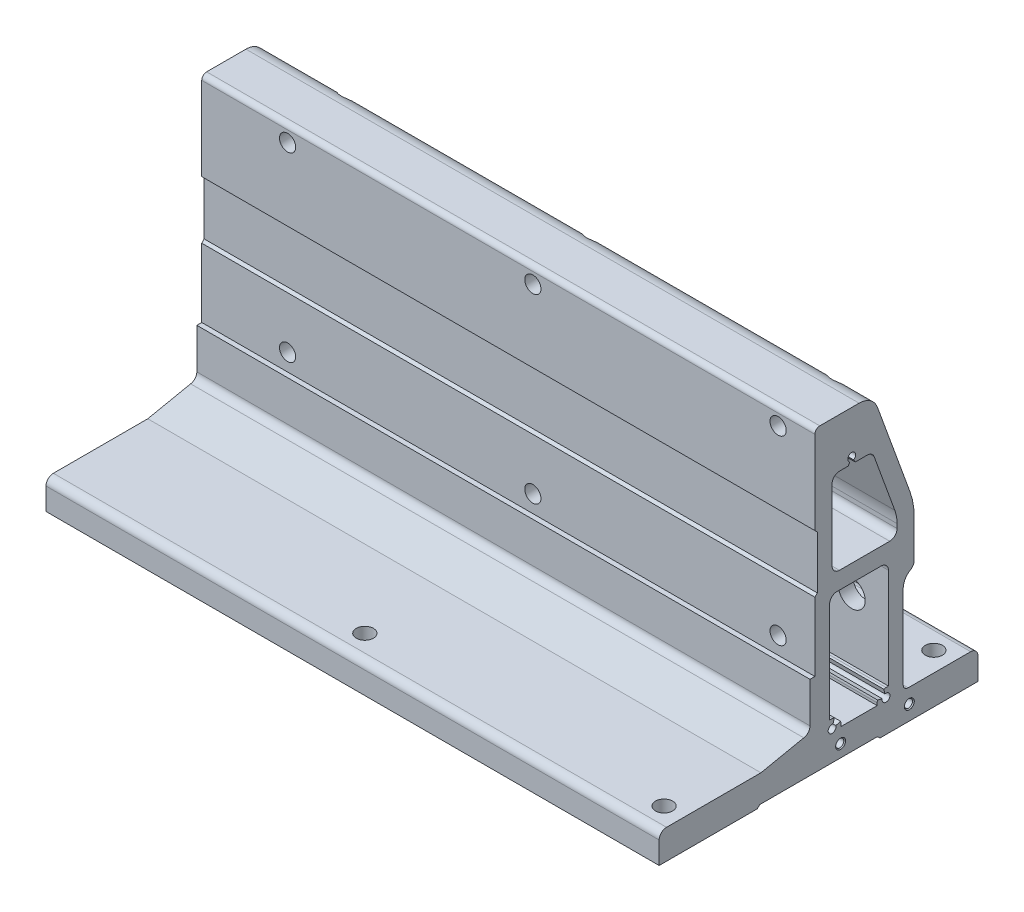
ISO-10303-21;
HEADER;
FILE_DESCRIPTION(('STEP AP214'),'2;1');
FILE_NAME('part.step','',(''),(''),'','','');
FILE_SCHEMA(('AUTOMOTIVE_DESIGN { 1 0 10303 214 1 1 1 1 }'));
ENDSEC;
DATA;
#1=APPLICATION_CONTEXT('core data for automotive mechanical design processes');
#2=APPLICATION_PROTOCOL_DEFINITION('international standard','automotive_design',2000,#1);
#3=PRODUCT_CONTEXT('',#1,'mechanical');
#4=PRODUCT('Part','Part','',(#3));
#5=PRODUCT_RELATED_PRODUCT_CATEGORY('part','',(#4));
#6=PRODUCT_DEFINITION_FORMATION('','',#4);
#7=PRODUCT_DEFINITION_CONTEXT('part definition',#1,'design');
#8=PRODUCT_DEFINITION('design','',#6,#7);
#9=PRODUCT_DEFINITION_SHAPE('','',#8);
#10=(LENGTH_UNIT() NAMED_UNIT(*) SI_UNIT(.MILLI.,.METRE.));
#11=(NAMED_UNIT(*) PLANE_ANGLE_UNIT() SI_UNIT($,.RADIAN.));
#12=(NAMED_UNIT(*) SI_UNIT($,.STERADIAN.) SOLID_ANGLE_UNIT());
#13=UNCERTAINTY_MEASURE_WITH_UNIT(LENGTH_MEASURE(1.E-05),#10,'distance_accuracy_value','');
#14=(GEOMETRIC_REPRESENTATION_CONTEXT(3) GLOBAL_UNCERTAINTY_ASSIGNED_CONTEXT((#13)) GLOBAL_UNIT_ASSIGNED_CONTEXT((#10,
#11,#12)) REPRESENTATION_CONTEXT('',''));
#15=CARTESIAN_POINT('',(0.,0.,0.));
#16=DIRECTION('',(0.,0.,1.));
#17=DIRECTION('',(1.,0.,0.));
#18=AXIS2_PLACEMENT_3D('',#15,#16,#17);
#19=CARTESIAN_POINT('',(125.,113.499999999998,-16.5141633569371));
#20=DIRECTION('',(1.,0.,0.));
#21=DIRECTION('',(0.,0.,-1.));
#22=AXIS2_PLACEMENT_3D('',#19,#20,#21);
#23=PLANE('',#22);
#24=CARTESIAN_POINT('',(125.,5.,-36.9999999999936));
#25=DIRECTION('',(1.,0.,0.));
#26=DIRECTION('',(0.,0.,-1.));
#27=AXIS2_PLACEMENT_3D('',#24,#25,#26);
#28=CIRCLE('',#27,2.025);
#29=CARTESIAN_POINT('',(125.,5.,-39.0249999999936));
#30=VERTEX_POINT('',#29);
#31=EDGE_CURVE('E491',#30,#30,#28,.T.);
#32=ORIENTED_EDGE('',*,*,#31,.F.);
#33=EDGE_LOOP('',(#32));
#34=FACE_BOUND('',#33,.T.);
#35=CARTESIAN_POINT('',(125.,5.,-8.99999999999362));
#36=DIRECTION('',(1.,0.,0.));
#37=DIRECTION('',(0.,0.,-1.));
#38=AXIS2_PLACEMENT_3D('',#35,#36,#37);
#39=CIRCLE('',#38,2.025);
#40=CARTESIAN_POINT('',(125.,5.,-11.0249999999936));
#41=VERTEX_POINT('',#40);
#42=EDGE_CURVE('E500',#41,#41,#39,.T.);
#43=ORIENTED_EDGE('',*,*,#42,.F.);
#44=EDGE_LOOP('',(#43));
#45=FACE_BOUND('',#44,.T.);
#46=CARTESIAN_POINT('',(125.,113.499999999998,-16.5141633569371));
#47=DIRECTION('',(1.,0.,0.));
#48=DIRECTION('',(0.,0.,-1.));
#49=AXIS2_PLACEMENT_3D('',#46,#47,#48);
#50=CIRCLE('',#49,7.99999999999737);
#51=CARTESIAN_POINT('',(125.,116.236161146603,-24.0317043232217));
#52=VERTEX_POINT('',#51);
#53=CARTESIAN_POINT('',(125.,121.499999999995,-16.5141633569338));
#54=VERTEX_POINT('',#53);
#55=EDGE_CURVE('E812',#52,#54,#50,.T.);
#56=ORIENTED_EDGE('',*,*,#55,.T.);
#57=DIRECTION('',(0.,0.,1.));
#58=VECTOR('',#57,1.);
#59=CARTESIAN_POINT('',(125.,121.499999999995,-16.5141633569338));
#60=LINE('',#59,#58);
#61=CARTESIAN_POINT('',(125.,121.499999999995,-0.499999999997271));
#62=VERTEX_POINT('',#61);
#63=EDGE_CURVE('E815',#54,#62,#60,.T.);
#64=ORIENTED_EDGE('',*,*,#63,.T.);
#65=CARTESIAN_POINT('',(125.,119.499999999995,-0.499999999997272));
#66=DIRECTION('',(1.,0.,0.));
#67=DIRECTION('',(0.,0.,-1.));
#68=AXIS2_PLACEMENT_3D('',#65,#66,#67);
#69=CIRCLE('',#68,2.);
#70=CARTESIAN_POINT('',(125.,119.499999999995,1.50000000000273));
#71=VERTEX_POINT('',#70);
#72=EDGE_CURVE('E818',#62,#71,#69,.T.);
#73=ORIENTED_EDGE('',*,*,#72,.T.);
#74=DIRECTION('',(0.,-1.,0.));
#75=VECTOR('',#74,1.);
#76=CARTESIAN_POINT('',(125.,119.499999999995,1.50000000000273));
#77=LINE('',#76,#75);
#78=CARTESIAN_POINT('',(125.,85.4999999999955,1.50000000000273));
#79=VERTEX_POINT('',#78);
#80=EDGE_CURVE('E820',#71,#79,#77,.T.);
#81=ORIENTED_EDGE('',*,*,#80,.T.);
#82=DIRECTION('',(0.,-0.707106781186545,-0.70710678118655));
#83=VECTOR('',#82,1.);
#84=CARTESIAN_POINT('',(125.,85.4999999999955,1.50000000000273));
#85=LINE('',#84,#83);
#86=CARTESIAN_POINT('',(125.,84.4999999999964,0.500000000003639));
#87=VERTEX_POINT('',#86);
#88=EDGE_CURVE('E822',#79,#87,#85,.T.);
#89=ORIENTED_EDGE('',*,*,#88,.T.);
#90=DIRECTION('',(0.,-1.,0.));
#91=VECTOR('',#90,1.);
#92=CARTESIAN_POINT('',(125.,84.4999999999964,0.500000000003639));
#93=LINE('',#92,#91);
#94=CARTESIAN_POINT('',(125.,62.9999999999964,0.500000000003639));
#95=VERTEX_POINT('',#94);
#96=EDGE_CURVE('E824',#87,#95,#93,.T.);
#97=ORIENTED_EDGE('',*,*,#96,.T.);
#98=DIRECTION('',(0.,-0.707106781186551,0.707106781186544));
#99=VECTOR('',#98,1.);
#100=CARTESIAN_POINT('',(125.,62.9999999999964,0.500000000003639));
#101=LINE('',#100,#99);
#102=CARTESIAN_POINT('',(125.,61.9999999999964,1.50000000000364));
#103=VERTEX_POINT('',#102);
#104=EDGE_CURVE('E826',#95,#103,#101,.T.);
#105=ORIENTED_EDGE('',*,*,#104,.T.);
#106=DIRECTION('',(0.,-1.,0.));
#107=VECTOR('',#106,1.);
#108=CARTESIAN_POINT('',(125.,61.9999999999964,1.50000000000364));
#109=LINE('',#108,#107);
#110=CARTESIAN_POINT('',(125.,33.9999999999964,1.50000000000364));
#111=VERTEX_POINT('',#110);
#112=EDGE_CURVE('E828',#103,#111,#109,.T.);
#113=ORIENTED_EDGE('',*,*,#112,.T.);
#114=DIRECTION('',(0.,0.,1.));
#115=VECTOR('',#114,1.);
#116=CARTESIAN_POINT('',(125.,33.9999999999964,1.50000000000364));
#117=LINE('',#116,#115);
#118=CARTESIAN_POINT('',(125.,33.9999999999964,3.50000000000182));
#119=VERTEX_POINT('',#118);
#120=EDGE_CURVE('E830',#111,#119,#117,.T.);
#121=ORIENTED_EDGE('',*,*,#120,.T.);
#122=DIRECTION('',(0.,-1.,0.));
#123=VECTOR('',#122,1.);
#124=CARTESIAN_POINT('',(125.,33.9999999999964,3.50000000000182));
#125=LINE('',#124,#123);
#126=CARTESIAN_POINT('',(125.,17.5660963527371,3.50000000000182));
#127=VERTEX_POINT('',#126);
#128=EDGE_CURVE('E832',#119,#127,#125,.T.);
#129=ORIENTED_EDGE('',*,*,#128,.T.);
#130=CARTESIAN_POINT('',(125.,17.5660963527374,6.50000000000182));
#131=DIRECTION('',(-1.,0.,0.));
#132=DIRECTION('',(0.,0.,-1.));
#133=AXIS2_PLACEMENT_3D('',#130,#131,#132);
#134=CIRCLE('',#133,3.);
#135=CARTESIAN_POINT('',(125.,14.6023377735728,6.03509669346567));
#136=VERTEX_POINT('',#135);
#137=EDGE_CURVE('E834',#127,#136,#134,.T.);
#138=ORIENTED_EDGE('',*,*,#137,.T.);
#139=DIRECTION('',(0.,-0.20200917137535,0.9793836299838));
#140=VECTOR('',#139,1.);
#141=CARTESIAN_POINT('',(125.,14.6023377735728,6.03509669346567));
#142=LINE('',#141,#140);
#143=CARTESIAN_POINT('',(125.,11.,23.5000000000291));
#144=VERTEX_POINT('',#143);
#145=EDGE_CURVE('E836',#136,#144,#142,.T.);
#146=ORIENTED_EDGE('',*,*,#145,.T.);
#147=DIRECTION('',(0.,0.,1.));
#148=VECTOR('',#147,1.);
#149=CARTESIAN_POINT('',(125.,11.,23.5000000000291));
#150=LINE('',#149,#148);
#151=CARTESIAN_POINT('',(125.,11.,62.0000000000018));
#152=VERTEX_POINT('',#151);
#153=EDGE_CURVE('E838',#144,#152,#150,.T.);
#154=ORIENTED_EDGE('',*,*,#153,.T.);
#155=CARTESIAN_POINT('',(125.,8.00000000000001,62.0000000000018));
#156=DIRECTION('',(1.,0.,0.));
#157=DIRECTION('',(0.,0.,-1.));
#158=AXIS2_PLACEMENT_3D('',#155,#156,#157);
#159=CIRCLE('',#158,3.);
#160=CARTESIAN_POINT('',(125.,8.00000000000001,65.0000000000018));
#161=VERTEX_POINT('',#160);
#162=EDGE_CURVE('E840',#152,#161,#159,.T.);
#163=ORIENTED_EDGE('',*,*,#162,.T.);
#164=DIRECTION('',(0.,-1.,0.));
#165=VECTOR('',#164,1.);
#166=CARTESIAN_POINT('',(125.,8.00000000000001,65.0000000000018));
#167=LINE('',#166,#165);
#168=CARTESIAN_POINT('',(125.,-0.999999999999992,65.0000000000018));
#169=VERTEX_POINT('',#168);
#170=EDGE_CURVE('E842',#161,#169,#167,.T.);
#171=ORIENTED_EDGE('',*,*,#170,.T.);
#172=DIRECTION('',(0.,0.,-1.));
#173=VECTOR('',#172,1.);
#174=CARTESIAN_POINT('',(125.,-0.999999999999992,65.0000000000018));
#175=LINE('',#174,#173);
#176=CARTESIAN_POINT('',(125.,-0.999999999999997,25.));
#177=VERTEX_POINT('',#176);
#178=EDGE_CURVE('E844',#169,#177,#175,.T.);
#179=ORIENTED_EDGE('',*,*,#178,.T.);
#180=DIRECTION('',(0.,0.707106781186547,-0.707106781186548));
#181=VECTOR('',#180,1.);
#182=CARTESIAN_POINT('',(125.,-0.999999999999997,25.));
#183=LINE('',#182,#181);
#184=CARTESIAN_POINT('',(125.,0.,24.));
#185=VERTEX_POINT('',#184);
#186=EDGE_CURVE('E846',#177,#185,#183,.T.);
#187=ORIENTED_EDGE('',*,*,#186,.T.);
#188=DIRECTION('',(0.,0.,-1.));
#189=VECTOR('',#188,1.);
#190=CARTESIAN_POINT('',(125.,0.,24.));
#191=LINE('',#190,#189);
#192=CARTESIAN_POINT('',(125.,0.,-24.));
#193=VERTEX_POINT('',#192);
#194=EDGE_CURVE('E848',#185,#193,#191,.T.);
#195=ORIENTED_EDGE('',*,*,#194,.T.);
#196=DIRECTION('',(0.,-0.707106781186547,-0.707106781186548));
#197=VECTOR('',#196,1.);
#198=CARTESIAN_POINT('',(125.,0.,-24.));
#199=LINE('',#198,#197);
#200=CARTESIAN_POINT('',(125.,-1.,-25.));
#201=VERTEX_POINT('',#200);
#202=EDGE_CURVE('E850',#193,#201,#199,.T.);
#203=ORIENTED_EDGE('',*,*,#202,.T.);
#204=DIRECTION('',(0.,0.,-1.));
#205=VECTOR('',#204,1.);
#206=CARTESIAN_POINT('',(125.,-1.,-25.));
#207=LINE('',#206,#205);
#208=CARTESIAN_POINT('',(125.,-0.999999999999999,-64.9999999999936));
#209=VERTEX_POINT('',#208);
#210=EDGE_CURVE('E852',#201,#209,#207,.T.);
#211=ORIENTED_EDGE('',*,*,#210,.T.);
#212=DIRECTION('',(0.,1.,0.));
#213=VECTOR('',#212,1.);
#214=CARTESIAN_POINT('',(125.,-0.999999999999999,-64.9999999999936));
#215=LINE('',#214,#213);
#216=CARTESIAN_POINT('',(125.,7.99999999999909,-64.9999999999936));
#217=VERTEX_POINT('',#216);
#218=EDGE_CURVE('E854',#209,#217,#215,.T.);
#219=ORIENTED_EDGE('',*,*,#218,.T.);
#220=CARTESIAN_POINT('',(125.,7.99999999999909,-61.9999999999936));
#221=DIRECTION('',(1.,0.,0.));
#222=DIRECTION('',(0.,0.,-1.));
#223=AXIS2_PLACEMENT_3D('',#220,#221,#222);
#224=CIRCLE('',#223,3.);
#225=CARTESIAN_POINT('',(125.,10.9999999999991,-61.9999999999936));
#226=VERTEX_POINT('',#225);
#227=EDGE_CURVE('E856',#217,#226,#224,.T.);
#228=ORIENTED_EDGE('',*,*,#227,.T.);
#229=DIRECTION('',(0.,0.,1.));
#230=VECTOR('',#229,1.);
#231=CARTESIAN_POINT('',(125.,10.9999999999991,-61.9999999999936));
#232=LINE('',#231,#230);
#233=CARTESIAN_POINT('',(125.,10.9999999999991,-36.4999999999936));
#234=VERTEX_POINT('',#233);
#235=EDGE_CURVE('E858',#226,#234,#232,.T.);
#236=ORIENTED_EDGE('',*,*,#235,.T.);
#237=CARTESIAN_POINT('',(125.,12.9999999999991,-36.4999999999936));
#238=DIRECTION('',(-1.,0.,0.));
#239=DIRECTION('',(0.,0.,-1.));
#240=AXIS2_PLACEMENT_3D('',#237,#238,#239);
#241=CIRCLE('',#240,2.);
#242=CARTESIAN_POINT('',(125.,12.9999999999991,-34.4999999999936));
#243=VERTEX_POINT('',#242);
#244=EDGE_CURVE('E860',#234,#243,#241,.T.);
#245=ORIENTED_EDGE('',*,*,#244,.T.);
#246=DIRECTION('',(0.,1.,0.));
#247=VECTOR('',#246,1.);
#248=CARTESIAN_POINT('',(125.,12.9999999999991,-34.4999999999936));
#249=LINE('',#248,#247);
#250=CARTESIAN_POINT('',(125.,46.9999999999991,-34.4999999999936));
#251=VERTEX_POINT('',#250);
#252=EDGE_CURVE('E862',#243,#251,#249,.T.);
#253=ORIENTED_EDGE('',*,*,#252,.T.);
#254=CARTESIAN_POINT('',(125.,46.9999999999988,-40.4999999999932));
#255=DIRECTION('',(-1.,0.,0.));
#256=DIRECTION('',(0.,0.,-1.));
#257=AXIS2_PLACEMENT_3D('',#254,#255,#256);
#258=CIRCLE('',#257,5.99999999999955);
#259=CARTESIAN_POINT('',(125.,52.1961524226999,-37.4999999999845));
#260=VERTEX_POINT('',#259);
#261=EDGE_CURVE('E864',#251,#260,#258,.T.);
#262=ORIENTED_EDGE('',*,*,#261,.T.);
#263=CARTESIAN_POINT('',(125.,54.7942286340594,-35.9999999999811));
#264=DIRECTION('',(1.,0.,0.));
#265=DIRECTION('',(0.,0.,-1.));
#266=AXIS2_PLACEMENT_3D('',#263,#264,#265);
#267=CIRCLE('',#266,3.00000000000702);
#268=CARTESIAN_POINT('',(125.,54.7942286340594,-38.9999999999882));
#269=VERTEX_POINT('',#268);
#270=EDGE_CURVE('E866',#260,#269,#267,.T.);
#271=ORIENTED_EDGE('',*,*,#270,.T.);
#272=DIRECTION('',(0.,1.,0.));
#273=VECTOR('',#272,1.);
#274=CARTESIAN_POINT('',(125.,54.794228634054,-38.9999999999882));
#275=LINE('',#274,#273);
#276=CARTESIAN_POINT('',(125.,69.8212973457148,-38.9999999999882));
#277=VERTEX_POINT('',#276);
#278=EDGE_CURVE('E868',#269,#277,#275,.T.);
#279=ORIENTED_EDGE('',*,*,#278,.T.);
#280=CARTESIAN_POINT('',(125.,69.821297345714,-8.99999999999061));
#281=DIRECTION('',(1.,0.,0.));
#282=DIRECTION('',(0.,0.,-1.));
#283=AXIS2_PLACEMENT_3D('',#280,#281,#282);
#284=CIRCLE('',#283,29.9999999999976);
#285=CARTESIAN_POINT('',(125.,80.0819016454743,-37.1907786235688));
#286=VERTEX_POINT('',#285);
#287=EDGE_CURVE('E870',#277,#286,#284,.T.);
#288=ORIENTED_EDGE('',*,*,#287,.T.);
#289=DIRECTION('',(0.,0.939692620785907,0.342020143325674));
#290=VECTOR('',#289,1.);
#291=CARTESIAN_POINT('',(125.,80.0819016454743,-37.1907786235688));
#292=LINE('',#291,#290);
#293=EDGE_CURVE('E872',#286,#52,#292,.T.);
#294=ORIENTED_EDGE('',*,*,#293,.T.);
#295=EDGE_LOOP('',(#56,#64,#73,#81,#89,#97,#105,#113,#121,#129,#138,#146,#154,#163,#171,#179,
#187,#195,#203,#211,#219,#228,#236,#245,#253,#262,#271,#279,#288,#294));
#296=FACE_BOUND('',#295,.T.);
#297=DIRECTION('',(0.,0.,1.));
#298=VECTOR('',#297,1.);
#299=CARTESIAN_POINT('',(125.,59.4999999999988,-25.4999999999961));
#300=LINE('',#299,#298);
#301=CARTESIAN_POINT('',(125.,59.4999999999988,-25.4999999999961));
#302=VERTEX_POINT('',#301);
#303=CARTESIAN_POINT('',(125.,59.4999999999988,-7.49999999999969));
#304=VERTEX_POINT('',#303);
#305=EDGE_CURVE('E671',#302,#304,#300,.T.);
#306=ORIENTED_EDGE('',*,*,#305,.F.);
#307=CARTESIAN_POINT('',(125.,56.4999999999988,-25.499999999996));
#308=DIRECTION('',(1.,0.,0.));
#309=DIRECTION('',(0.,0.,-1.));
#310=AXIS2_PLACEMENT_3D('',#307,#308,#309);
#311=CIRCLE('',#310,3.);
#312=CARTESIAN_POINT('',(125.,56.4999999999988,-28.4999999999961));
#313=VERTEX_POINT('',#312);
#314=EDGE_CURVE('E669',#313,#302,#311,.T.);
#315=ORIENTED_EDGE('',*,*,#314,.F.);
#316=DIRECTION('',(0.,1.,0.));
#317=VECTOR('',#316,1.);
#318=CARTESIAN_POINT('',(125.,15.5999999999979,-28.4999999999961));
#319=LINE('',#318,#317);
#320=CARTESIAN_POINT('',(125.,15.5999999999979,-28.4999999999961));
#321=VERTEX_POINT('',#320);
#322=EDGE_CURVE('E709',#321,#313,#319,.T.);
#323=ORIENTED_EDGE('',*,*,#322,.F.);
#324=DIRECTION('',(0.,0.,-1.));
#325=VECTOR('',#324,1.);
#326=CARTESIAN_POINT('',(125.,15.5999999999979,-27.4999999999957));
#327=LINE('',#326,#325);
#328=CARTESIAN_POINT('',(125.,15.5999999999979,-27.4999999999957));
#329=VERTEX_POINT('',#328);
#330=EDGE_CURVE('E706',#329,#321,#327,.T.);
#331=ORIENTED_EDGE('',*,*,#330,.F.);
#332=CARTESIAN_POINT('',(125.,11.9999999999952,-27.5000000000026));
#333=DIRECTION('',(-1.,0.,0.));
#334=DIRECTION('',(0.,0.,-1.));
#335=AXIS2_PLACEMENT_3D('',#332,#333,#334);
#336=CIRCLE('',#335,3.60000000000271);
#337=CARTESIAN_POINT('',(125.,15.4773329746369,-26.568251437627));
#338=VERTEX_POINT('',#337);
#339=EDGE_CURVE('E704',#338,#329,#336,.T.);
#340=ORIENTED_EDGE('',*,*,#339,.F.);
#341=DIRECTION('',(0.,0.965925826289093,0.258819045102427));
#342=VECTOR('',#341,1.);
#343=CARTESIAN_POINT('',(125.,13.5454813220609,-27.0858895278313));
#344=LINE('',#343,#342);
#345=CARTESIAN_POINT('',(125.,13.5454813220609,-27.0858895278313));
#346=VERTEX_POINT('',#345);
#347=EDGE_CURVE('E702',#346,#338,#344,.T.);
#348=ORIENTED_EDGE('',*,*,#347,.F.);
#349=CARTESIAN_POINT('',(125.,11.9999999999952,-27.5000000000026));
#350=DIRECTION('',(1.,0.,0.));
#351=DIRECTION('',(0.,0.,-1.));
#352=AXIS2_PLACEMENT_3D('',#349,#350,#351);
#353=CIRCLE('',#352,1.60000000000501);
#354=CARTESIAN_POINT('',(125.,12.4141104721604,-25.9545186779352));
#355=VERTEX_POINT('',#354);
#356=EDGE_CURVE('E700',#355,#346,#353,.T.);
#357=ORIENTED_EDGE('',*,*,#356,.F.);
#358=DIRECTION('',(0.,-0.258819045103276,-0.965925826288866));
#359=VECTOR('',#358,1.);
#360=CARTESIAN_POINT('',(125.,12.9317485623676,-24.0226670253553));
#361=LINE('',#360,#359);
#362=CARTESIAN_POINT('',(125.,12.9317485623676,-24.0226670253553));
#363=VERTEX_POINT('',#362);
#364=EDGE_CURVE('E698',#363,#355,#361,.T.);
#365=ORIENTED_EDGE('',*,*,#364,.F.);
#366=CARTESIAN_POINT('',(125.,11.9999999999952,-27.5000000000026));
#367=DIRECTION('',(-1.,0.,0.));
#368=DIRECTION('',(0.,0.,-1.));
#369=AXIS2_PLACEMENT_3D('',#366,#367,#368);
#370=CIRCLE('',#369,3.60000000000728);
#371=CARTESIAN_POINT('',(125.,11.999999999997,-23.8999999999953));
#372=VERTEX_POINT('',#371);
#373=EDGE_CURVE('E696',#372,#363,#370,.T.);
#374=ORIENTED_EDGE('',*,*,#373,.F.);
#375=DIRECTION('',(0.,1.,0.));
#376=VECTOR('',#375,1.);
#377=CARTESIAN_POINT('',(125.,10.9999999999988,-23.8999999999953));
#378=LINE('',#377,#376);
#379=CARTESIAN_POINT('',(125.,10.9999999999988,-23.8999999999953));
#380=VERTEX_POINT('',#379);
#381=EDGE_CURVE('E694',#380,#372,#378,.T.);
#382=ORIENTED_EDGE('',*,*,#381,.F.);
#383=DIRECTION('',(0.,0.,-1.));
#384=VECTOR('',#383,1.);
#385=CARTESIAN_POINT('',(125.,10.9999999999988,-9.09999999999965));
#386=LINE('',#385,#384);
#387=CARTESIAN_POINT('',(125.,10.9999999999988,-9.09999999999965));
#388=VERTEX_POINT('',#387);
#389=EDGE_CURVE('E692',#388,#380,#386,.T.);
#390=ORIENTED_EDGE('',*,*,#389,.F.);
#391=DIRECTION('',(0.,-1.,0.));
#392=VECTOR('',#391,1.);
#393=CARTESIAN_POINT('',(125.,11.999999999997,-9.09999999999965));
#394=LINE('',#393,#392);
#395=CARTESIAN_POINT('',(125.,11.999999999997,-9.09999999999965));
#396=VERTEX_POINT('',#395);
#397=EDGE_CURVE('E690',#396,#388,#394,.T.);
#398=ORIENTED_EDGE('',*,*,#397,.F.);
#399=CARTESIAN_POINT('',(125.,11.999999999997,-5.49999999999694));
#400=DIRECTION('',(-1.,0.,0.));
#401=DIRECTION('',(0.,0.,-1.));
#402=AXIS2_PLACEMENT_3D('',#399,#400,#401);
#403=CIRCLE('',#402,3.60000000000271);
#404=CARTESIAN_POINT('',(125.,12.9317485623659,-8.97733297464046));
#405=VERTEX_POINT('',#404);
#406=EDGE_CURVE('E688',#405,#396,#403,.T.);
#407=ORIENTED_EDGE('',*,*,#406,.F.);
#408=DIRECTION('',(0.,0.258819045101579,-0.965925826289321));
#409=VECTOR('',#408,1.);
#410=CARTESIAN_POINT('',(125.,12.4141104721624,-7.04548132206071));
#411=LINE('',#410,#409);
#412=CARTESIAN_POINT('',(125.,12.4141104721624,-7.04548132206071));
#413=VERTEX_POINT('',#412);
#414=EDGE_CURVE('E686',#413,#405,#411,.T.);
#415=ORIENTED_EDGE('',*,*,#414,.F.);
#416=CARTESIAN_POINT('',(125.,11.999999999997,-5.49999999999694));
#417=DIRECTION('',(1.,0.,0.));
#418=DIRECTION('',(0.,0.,-1.));
#419=AXIS2_PLACEMENT_3D('',#416,#417,#418);
#420=CIRCLE('',#419,1.60000000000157);
#421=CARTESIAN_POINT('',(125.,13.5454813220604,-5.91411047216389));
#422=VERTEX_POINT('',#421);
#423=EDGE_CURVE('E684',#422,#413,#420,.T.);
#424=ORIENTED_EDGE('',*,*,#423,.F.);
#425=DIRECTION('',(0.,-0.965925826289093,0.258819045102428));
#426=VECTOR('',#425,1.);
#427=CARTESIAN_POINT('',(125.,15.4773329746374,-6.43174856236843));
#428=LINE('',#427,#426);
#429=CARTESIAN_POINT('',(125.,15.4773329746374,-6.43174856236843));
#430=VERTEX_POINT('',#429);
#431=EDGE_CURVE('E682',#430,#422,#428,.T.);
#432=ORIENTED_EDGE('',*,*,#431,.F.);
#433=CARTESIAN_POINT('',(125.,11.999999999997,-5.49999999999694));
#434=DIRECTION('',(-1.,0.,0.));
#435=DIRECTION('',(0.,0.,-1.));
#436=AXIS2_PLACEMENT_3D('',#433,#434,#435);
#437=CIRCLE('',#436,3.60000000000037);
#438=CARTESIAN_POINT('',(125.,15.5999999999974,-5.49999999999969));
#439=VERTEX_POINT('',#438);
#440=EDGE_CURVE('E680',#439,#430,#437,.T.);
#441=ORIENTED_EDGE('',*,*,#440,.F.);
#442=DIRECTION('',(0.,0.,-1.));
#443=VECTOR('',#442,1.);
#444=CARTESIAN_POINT('',(125.,15.5999999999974,-4.49999999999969));
#445=LINE('',#444,#443);
#446=CARTESIAN_POINT('',(125.,15.5999999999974,-4.49999999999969));
#447=VERTEX_POINT('',#446);
#448=EDGE_CURVE('E678',#447,#439,#445,.T.);
#449=ORIENTED_EDGE('',*,*,#448,.F.);
#450=DIRECTION('',(0.,-1.,0.));
#451=VECTOR('',#450,1.);
#452=CARTESIAN_POINT('',(125.,56.4999999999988,-4.49999999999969));
#453=LINE('',#452,#451);
#454=CARTESIAN_POINT('',(125.,56.4999999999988,-4.49999999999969));
#455=VERTEX_POINT('',#454);
#456=EDGE_CURVE('E676',#455,#447,#453,.T.);
#457=ORIENTED_EDGE('',*,*,#456,.F.);
#458=CARTESIAN_POINT('',(125.,56.4999999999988,-7.49999999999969));
#459=DIRECTION('',(1.,0.,0.));
#460=DIRECTION('',(0.,0.,-1.));
#461=AXIS2_PLACEMENT_3D('',#458,#459,#460);
#462=CIRCLE('',#461,3.);
#463=EDGE_CURVE('E674',#304,#455,#462,.T.);
#464=ORIENTED_EDGE('',*,*,#463,.F.);
#465=EDGE_LOOP('',(#306,#315,#323,#331,#340,#348,#357,#365,#374,#382,#390,#398,#407,#415,#424,
#432,#441,#449,#457,#464));
#466=FACE_BOUND('',#465,.T.);
#467=DIRECTION('',(0.,-0.866025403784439,0.5));
#468=VECTOR('',#467,1.);
#469=CARTESIAN_POINT('',(125.,102.614356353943,-12.7000000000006));
#470=LINE('',#469,#468);
#471=CARTESIAN_POINT('',(125.,102.614356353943,-12.7000000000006));
#472=VERTEX_POINT('',#471);
#473=CARTESIAN_POINT('',(125.,101.5,-12.0566260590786));
#474=VERTEX_POINT('',#473);
#475=EDGE_CURVE('E570',#472,#474,#470,.T.);
#476=ORIENTED_EDGE('',*,*,#475,.F.);
#477=CARTESIAN_POINT('',(125.,103.999996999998,-13.5000000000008));
#478=DIRECTION('',(1.,0.,0.));
#479=DIRECTION('',(0.,0.,-1.));
#480=AXIS2_PLACEMENT_3D('',#477,#478,#479);
#481=CIRCLE('',#480,1.59999999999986);
#482=CARTESIAN_POINT('',(125.,102.614356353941,-14.2999999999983));
#483=VERTEX_POINT('',#482);
#484=EDGE_CURVE('E568',#483,#472,#481,.T.);
#485=ORIENTED_EDGE('',*,*,#484,.F.);
#486=DIRECTION('',(0.,0.866025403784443,0.499999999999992));
#487=VECTOR('',#486,1.);
#488=CARTESIAN_POINT('',(125.,101.499999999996,-14.9433739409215));
#489=LINE('',#488,#487);
#490=CARTESIAN_POINT('',(125.,101.499999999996,-14.9433739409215));
#491=VERTEX_POINT('',#490);
#492=EDGE_CURVE('E596',#491,#483,#489,.T.);
#493=ORIENTED_EDGE('',*,*,#492,.F.);
#494=DIRECTION('',(0.,0.,1.));
#495=VECTOR('',#494,1.);
#496=CARTESIAN_POINT('',(125.,101.499999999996,-19.8453613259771));
#497=LINE('',#496,#495);
#498=CARTESIAN_POINT('',(125.,101.499999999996,-19.8453613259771));
#499=VERTEX_POINT('',#498);
#500=EDGE_CURVE('E593',#499,#491,#497,.T.);
#501=ORIENTED_EDGE('',*,*,#500,.F.);
#502=CARTESIAN_POINT('',(125.,98.499999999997,-19.8453613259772));
#503=DIRECTION('',(1.,0.,0.));
#504=DIRECTION('',(0.,0.,-1.));
#505=AXIS2_PLACEMENT_3D('',#502,#503,#504);
#506=CIRCLE('',#505,2.99999999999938);
#507=CARTESIAN_POINT('',(125.,99.5260604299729,-22.6644391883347));
#508=VERTEX_POINT('',#507);
#509=EDGE_CURVE('E591',#508,#499,#506,.T.);
#510=ORIENTED_EDGE('',*,*,#509,.F.);
#511=DIRECTION('',(0.,0.939692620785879,0.342020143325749));
#512=VECTOR('',#511,1.);
#513=CARTESIAN_POINT('',(125.,76.3622153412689,-31.0953893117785));
#514=LINE('',#513,#512);
#515=CARTESIAN_POINT('',(125.,76.3622153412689,-31.0953893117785));
#516=VERTEX_POINT('',#515);
#517=EDGE_CURVE('E589',#516,#508,#514,.T.);
#518=ORIENTED_EDGE('',*,*,#517,.F.);
#519=CARTESIAN_POINT('',(125.,71.2319131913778,-16.9999999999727));
#520=DIRECTION('',(1.,0.,0.));
#521=DIRECTION('',(0.,0.,-1.));
#522=AXIS2_PLACEMENT_3D('',#519,#520,#521);
#523=CIRCLE('',#522,15.0000000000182);
#524=CARTESIAN_POINT('',(125.,71.2319131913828,-31.9999999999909));
#525=VERTEX_POINT('',#524);
#526=EDGE_CURVE('E587',#525,#516,#523,.T.);
#527=ORIENTED_EDGE('',*,*,#526,.F.);
#528=DIRECTION('',(0.,1.,0.));
#529=VECTOR('',#528,1.);
#530=CARTESIAN_POINT('',(125.,69.5,-31.9999999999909));
#531=LINE('',#530,#529);
#532=CARTESIAN_POINT('',(125.,69.5,-31.9999999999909));
#533=VERTEX_POINT('',#532);
#534=EDGE_CURVE('E585',#533,#525,#531,.T.);
#535=ORIENTED_EDGE('',*,*,#534,.F.);
#536=CARTESIAN_POINT('',(125.,69.5,-28.9999999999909));
#537=DIRECTION('',(1.,0.,0.));
#538=DIRECTION('',(0.,0.,-1.));
#539=AXIS2_PLACEMENT_3D('',#536,#537,#538);
#540=CIRCLE('',#539,3.);
#541=CARTESIAN_POINT('',(125.,66.5,-28.9999999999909));
#542=VERTEX_POINT('',#541);
#543=EDGE_CURVE('E583',#542,#533,#540,.T.);
#544=ORIENTED_EDGE('',*,*,#543,.F.);
#545=DIRECTION('',(0.,0.,-1.));
#546=VECTOR('',#545,1.);
#547=CARTESIAN_POINT('',(125.,66.5,-8.50000000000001));
#548=LINE('',#547,#546);
#549=CARTESIAN_POINT('',(125.,66.5,-8.50000000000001));
#550=VERTEX_POINT('',#549);
#551=EDGE_CURVE('E581',#550,#542,#548,.T.);
#552=ORIENTED_EDGE('',*,*,#551,.F.);
#553=CARTESIAN_POINT('',(125.,69.5,-8.50000000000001));
#554=DIRECTION('',(1.,0.,0.));
#555=DIRECTION('',(0.,0.,-1.));
#556=AXIS2_PLACEMENT_3D('',#553,#554,#555);
#557=CIRCLE('',#556,3.);
#558=CARTESIAN_POINT('',(125.,69.5,-5.50000000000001));
#559=VERTEX_POINT('',#558);
#560=EDGE_CURVE('E579',#559,#550,#557,.T.);
#561=ORIENTED_EDGE('',*,*,#560,.F.);
#562=DIRECTION('',(0.,-1.,0.));
#563=VECTOR('',#562,1.);
#564=CARTESIAN_POINT('',(125.,98.5,-5.50000000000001));
#565=LINE('',#564,#563);
#566=CARTESIAN_POINT('',(125.,98.5,-5.50000000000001));
#567=VERTEX_POINT('',#566);
#568=EDGE_CURVE('E577',#567,#559,#565,.T.);
#569=ORIENTED_EDGE('',*,*,#568,.F.);
#570=CARTESIAN_POINT('',(125.,98.5,-8.50000000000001));
#571=DIRECTION('',(1.,0.,0.));
#572=DIRECTION('',(0.,0.,-1.));
#573=AXIS2_PLACEMENT_3D('',#570,#571,#572);
#574=CIRCLE('',#573,3.);
#575=CARTESIAN_POINT('',(125.,101.5,-8.50000000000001));
#576=VERTEX_POINT('',#575);
#577=EDGE_CURVE('E575',#576,#567,#574,.T.);
#578=ORIENTED_EDGE('',*,*,#577,.F.);
#579=DIRECTION('',(0.,0.,1.));
#580=VECTOR('',#579,1.);
#581=CARTESIAN_POINT('',(125.,101.5,-12.0566260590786));
#582=LINE('',#581,#580);
#583=EDGE_CURVE('E573',#474,#576,#582,.T.);
#584=ORIENTED_EDGE('',*,*,#583,.F.);
#585=EDGE_LOOP('',(#476,#485,#493,#501,#510,#518,#527,#535,#544,#552,#561,#569,#578,#584));
#586=FACE_BOUND('',#585,.T.);
#587=ADVANCED_FACE('F37',(#34,#45,#296,#466,#586),#23,.T.);
#588=CARTESIAN_POINT('',(-125.,113.499999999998,-16.5141633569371));
#589=DIRECTION('',(1.,0.,0.));
#590=DIRECTION('',(0.,0.,-1.));
#591=AXIS2_PLACEMENT_3D('',#588,#589,#590);
#592=PLANE('',#591);
#593=CARTESIAN_POINT('',(-125.,56.4999999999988,-25.499999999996));
#594=DIRECTION('',(1.,0.,0.));
#595=DIRECTION('',(0.,0.,-1.));
#596=AXIS2_PLACEMENT_3D('',#593,#594,#595);
#597=CIRCLE('',#596,3.);
#598=CARTESIAN_POINT('',(-125.,56.4999999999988,-28.4999999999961));
#599=VERTEX_POINT('',#598);
#600=CARTESIAN_POINT('',(-125.,59.4999999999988,-25.4999999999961));
#601=VERTEX_POINT('',#600);
#602=EDGE_CURVE('E668',#599,#601,#597,.T.);
#603=ORIENTED_EDGE('',*,*,#602,.T.);
#604=DIRECTION('',(0.,0.,1.));
#605=VECTOR('',#604,1.);
#606=CARTESIAN_POINT('',(-125.,59.4999999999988,-25.4999999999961));
#607=LINE('',#606,#605);
#608=CARTESIAN_POINT('',(-125.,59.4999999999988,-7.49999999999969));
#609=VERTEX_POINT('',#608);
#610=EDGE_CURVE('E714',#601,#609,#607,.T.);
#611=ORIENTED_EDGE('',*,*,#610,.T.);
#612=CARTESIAN_POINT('',(-125.,56.4999999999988,-7.49999999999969));
#613=DIRECTION('',(1.,0.,0.));
#614=DIRECTION('',(0.,0.,-1.));
#615=AXIS2_PLACEMENT_3D('',#612,#613,#614);
#616=CIRCLE('',#615,3.);
#617=CARTESIAN_POINT('',(-125.,56.4999999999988,-4.49999999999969));
#618=VERTEX_POINT('',#617);
#619=EDGE_CURVE('E717',#609,#618,#616,.T.);
#620=ORIENTED_EDGE('',*,*,#619,.T.);
#621=DIRECTION('',(0.,-1.,0.));
#622=VECTOR('',#621,1.);
#623=CARTESIAN_POINT('',(-125.,56.4999999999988,-4.49999999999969));
#624=LINE('',#623,#622);
#625=CARTESIAN_POINT('',(-125.,15.5999999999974,-4.49999999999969));
#626=VERTEX_POINT('',#625);
#627=EDGE_CURVE('E720',#618,#626,#624,.T.);
#628=ORIENTED_EDGE('',*,*,#627,.T.);
#629=DIRECTION('',(0.,0.,-1.));
#630=VECTOR('',#629,1.);
#631=CARTESIAN_POINT('',(-125.,15.5999999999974,-4.49999999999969));
#632=LINE('',#631,#630);
#633=CARTESIAN_POINT('',(-125.,15.5999999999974,-5.49999999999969));
#634=VERTEX_POINT('',#633);
#635=EDGE_CURVE('E723',#626,#634,#632,.T.);
#636=ORIENTED_EDGE('',*,*,#635,.T.);
#637=CARTESIAN_POINT('',(-125.,11.999999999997,-5.49999999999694));
#638=DIRECTION('',(-1.,0.,0.));
#639=DIRECTION('',(0.,0.,-1.));
#640=AXIS2_PLACEMENT_3D('',#637,#638,#639);
#641=CIRCLE('',#640,3.60000000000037);
#642=CARTESIAN_POINT('',(-125.,15.4773329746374,-6.43174856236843));
#643=VERTEX_POINT('',#642);
#644=EDGE_CURVE('E726',#634,#643,#641,.T.);
#645=ORIENTED_EDGE('',*,*,#644,.T.);
#646=DIRECTION('',(0.,-0.965925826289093,0.258819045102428));
#647=VECTOR('',#646,1.);
#648=CARTESIAN_POINT('',(-125.,15.4773329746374,-6.43174856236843));
#649=LINE('',#648,#647);
#650=CARTESIAN_POINT('',(-125.,13.5454813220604,-5.91411047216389));
#651=VERTEX_POINT('',#650);
#652=EDGE_CURVE('E729',#643,#651,#649,.T.);
#653=ORIENTED_EDGE('',*,*,#652,.T.);
#654=CARTESIAN_POINT('',(-125.,11.999999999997,-5.49999999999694));
#655=DIRECTION('',(1.,0.,0.));
#656=DIRECTION('',(0.,0.,-1.));
#657=AXIS2_PLACEMENT_3D('',#654,#655,#656);
#658=CIRCLE('',#657,1.60000000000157);
#659=CARTESIAN_POINT('',(-125.,12.4141104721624,-7.04548132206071));
#660=VERTEX_POINT('',#659);
#661=EDGE_CURVE('E732',#651,#660,#658,.T.);
#662=ORIENTED_EDGE('',*,*,#661,.T.);
#663=DIRECTION('',(0.,0.258819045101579,-0.965925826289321));
#664=VECTOR('',#663,1.);
#665=CARTESIAN_POINT('',(-125.,12.4141104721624,-7.04548132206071));
#666=LINE('',#665,#664);
#667=CARTESIAN_POINT('',(-125.,12.9317485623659,-8.97733297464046));
#668=VERTEX_POINT('',#667);
#669=EDGE_CURVE('E735',#660,#668,#666,.T.);
#670=ORIENTED_EDGE('',*,*,#669,.T.);
#671=CARTESIAN_POINT('',(-125.,11.999999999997,-5.49999999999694));
#672=DIRECTION('',(-1.,0.,0.));
#673=DIRECTION('',(0.,0.,-1.));
#674=AXIS2_PLACEMENT_3D('',#671,#672,#673);
#675=CIRCLE('',#674,3.60000000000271);
#676=CARTESIAN_POINT('',(-125.,11.999999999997,-9.09999999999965));
#677=VERTEX_POINT('',#676);
#678=EDGE_CURVE('E738',#668,#677,#675,.T.);
#679=ORIENTED_EDGE('',*,*,#678,.T.);
#680=DIRECTION('',(0.,-1.,0.));
#681=VECTOR('',#680,1.);
#682=CARTESIAN_POINT('',(-125.,11.999999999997,-9.09999999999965));
#683=LINE('',#682,#681);
#684=CARTESIAN_POINT('',(-125.,10.9999999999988,-9.09999999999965));
#685=VERTEX_POINT('',#684);
#686=EDGE_CURVE('E741',#677,#685,#683,.T.);
#687=ORIENTED_EDGE('',*,*,#686,.T.);
#688=DIRECTION('',(0.,0.,-1.));
#689=VECTOR('',#688,1.);
#690=CARTESIAN_POINT('',(-125.,10.9999999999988,-9.09999999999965));
#691=LINE('',#690,#689);
#692=CARTESIAN_POINT('',(-125.,10.9999999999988,-23.8999999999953));
#693=VERTEX_POINT('',#692);
#694=EDGE_CURVE('E744',#685,#693,#691,.T.);
#695=ORIENTED_EDGE('',*,*,#694,.T.);
#696=DIRECTION('',(0.,1.,0.));
#697=VECTOR('',#696,1.);
#698=CARTESIAN_POINT('',(-125.,10.9999999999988,-23.8999999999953));
#699=LINE('',#698,#697);
#700=CARTESIAN_POINT('',(-125.,11.999999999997,-23.8999999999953));
#701=VERTEX_POINT('',#700);
#702=EDGE_CURVE('E747',#693,#701,#699,.T.);
#703=ORIENTED_EDGE('',*,*,#702,.T.);
#704=CARTESIAN_POINT('',(-125.,11.9999999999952,-27.5000000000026));
#705=DIRECTION('',(-1.,0.,0.));
#706=DIRECTION('',(0.,0.,-1.));
#707=AXIS2_PLACEMENT_3D('',#704,#705,#706);
#708=CIRCLE('',#707,3.60000000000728);
#709=CARTESIAN_POINT('',(-125.,12.9317485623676,-24.0226670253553));
#710=VERTEX_POINT('',#709);
#711=EDGE_CURVE('E750',#701,#710,#708,.T.);
#712=ORIENTED_EDGE('',*,*,#711,.T.);
#713=DIRECTION('',(0.,-0.258819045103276,-0.965925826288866));
#714=VECTOR('',#713,1.);
#715=CARTESIAN_POINT('',(-125.,12.9317485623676,-24.0226670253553));
#716=LINE('',#715,#714);
#717=CARTESIAN_POINT('',(-125.,12.4141104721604,-25.9545186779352));
#718=VERTEX_POINT('',#717);
#719=EDGE_CURVE('E753',#710,#718,#716,.T.);
#720=ORIENTED_EDGE('',*,*,#719,.T.);
#721=CARTESIAN_POINT('',(-125.,11.9999999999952,-27.5000000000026));
#722=DIRECTION('',(1.,0.,0.));
#723=DIRECTION('',(0.,0.,-1.));
#724=AXIS2_PLACEMENT_3D('',#721,#722,#723);
#725=CIRCLE('',#724,1.60000000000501);
#726=CARTESIAN_POINT('',(-125.,13.5454813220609,-27.0858895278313));
#727=VERTEX_POINT('',#726);
#728=EDGE_CURVE('E756',#718,#727,#725,.T.);
#729=ORIENTED_EDGE('',*,*,#728,.T.);
#730=DIRECTION('',(0.,0.965925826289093,0.258819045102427));
#731=VECTOR('',#730,1.);
#732=CARTESIAN_POINT('',(-125.,13.5454813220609,-27.0858895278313));
#733=LINE('',#732,#731);
#734=CARTESIAN_POINT('',(-125.,15.4773329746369,-26.568251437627));
#735=VERTEX_POINT('',#734);
#736=EDGE_CURVE('E759',#727,#735,#733,.T.);
#737=ORIENTED_EDGE('',*,*,#736,.T.);
#738=CARTESIAN_POINT('',(-125.,11.9999999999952,-27.5000000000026));
#739=DIRECTION('',(-1.,0.,0.));
#740=DIRECTION('',(0.,0.,-1.));
#741=AXIS2_PLACEMENT_3D('',#738,#739,#740);
#742=CIRCLE('',#741,3.60000000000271);
#743=CARTESIAN_POINT('',(-125.,15.5999999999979,-27.4999999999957));
#744=VERTEX_POINT('',#743);
#745=EDGE_CURVE('E762',#735,#744,#742,.T.);
#746=ORIENTED_EDGE('',*,*,#745,.T.);
#747=DIRECTION('',(0.,0.,-1.));
#748=VECTOR('',#747,1.);
#749=CARTESIAN_POINT('',(-125.,15.5999999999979,-27.4999999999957));
#750=LINE('',#749,#748);
#751=CARTESIAN_POINT('',(-125.,15.5999999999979,-28.4999999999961));
#752=VERTEX_POINT('',#751);
#753=EDGE_CURVE('E765',#744,#752,#750,.T.);
#754=ORIENTED_EDGE('',*,*,#753,.T.);
#755=DIRECTION('',(0.,1.,0.));
#756=VECTOR('',#755,1.);
#757=CARTESIAN_POINT('',(-125.,15.5999999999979,-28.4999999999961));
#758=LINE('',#757,#756);
#759=EDGE_CURVE('E672',#752,#599,#758,.T.);
#760=ORIENTED_EDGE('',*,*,#759,.T.);
#761=EDGE_LOOP('',(#603,#611,#620,#628,#636,#645,#653,#662,#670,#679,#687,#695,#703,#712,#720,
#729,#737,#746,#754,#760));
#762=FACE_BOUND('',#761,.T.);
#763=CARTESIAN_POINT('',(-125.,113.499999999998,-16.5141633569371));
#764=DIRECTION('',(1.,0.,0.));
#765=DIRECTION('',(0.,0.,-1.));
#766=AXIS2_PLACEMENT_3D('',#763,#764,#765);
#767=CIRCLE('',#766,7.99999999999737);
#768=CARTESIAN_POINT('',(-125.,116.236161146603,-24.0317043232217));
#769=VERTEX_POINT('',#768);
#770=CARTESIAN_POINT('',(-125.,121.499999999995,-16.5141633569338));
#771=VERTEX_POINT('',#770);
#772=EDGE_CURVE('E811',#769,#771,#767,.T.);
#773=ORIENTED_EDGE('',*,*,#772,.F.);
#774=DIRECTION('',(0.,0.939692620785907,0.342020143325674));
#775=VECTOR('',#774,1.);
#776=CARTESIAN_POINT('',(-125.,80.0819016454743,-37.1907786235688));
#777=LINE('',#776,#775);
#778=CARTESIAN_POINT('',(-125.,80.0819016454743,-37.1907786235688));
#779=VERTEX_POINT('',#778);
#780=EDGE_CURVE('E816',#779,#769,#777,.T.);
#781=ORIENTED_EDGE('',*,*,#780,.F.);
#782=CARTESIAN_POINT('',(-125.,69.821297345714,-8.99999999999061));
#783=DIRECTION('',(1.,0.,0.));
#784=DIRECTION('',(0.,0.,-1.));
#785=AXIS2_PLACEMENT_3D('',#782,#783,#784);
#786=CIRCLE('',#785,29.9999999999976);
#787=CARTESIAN_POINT('',(-125.,69.8212973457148,-38.9999999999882));
#788=VERTEX_POINT('',#787);
#789=EDGE_CURVE('E931',#788,#779,#786,.T.);
#790=ORIENTED_EDGE('',*,*,#789,.F.);
#791=DIRECTION('',(0.,1.,0.));
#792=VECTOR('',#791,1.);
#793=CARTESIAN_POINT('',(-125.,54.794228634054,-38.9999999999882));
#794=LINE('',#793,#792);
#795=CARTESIAN_POINT('',(-125.,54.7942286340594,-38.9999999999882));
#796=VERTEX_POINT('',#795);
#797=EDGE_CURVE('E929',#796,#788,#794,.T.);
#798=ORIENTED_EDGE('',*,*,#797,.F.);
#799=CARTESIAN_POINT('',(-125.,54.7942286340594,-35.9999999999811));
#800=DIRECTION('',(1.,0.,0.));
#801=DIRECTION('',(0.,0.,-1.));
#802=AXIS2_PLACEMENT_3D('',#799,#800,#801);
#803=CIRCLE('',#802,3.00000000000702);
#804=CARTESIAN_POINT('',(-125.,52.1961524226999,-37.4999999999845));
#805=VERTEX_POINT('',#804);
#806=EDGE_CURVE('E927',#805,#796,#803,.T.);
#807=ORIENTED_EDGE('',*,*,#806,.F.);
#808=CARTESIAN_POINT('',(-125.,46.9999999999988,-40.4999999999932));
#809=DIRECTION('',(-1.,0.,0.));
#810=DIRECTION('',(0.,0.,-1.));
#811=AXIS2_PLACEMENT_3D('',#808,#809,#810);
#812=CIRCLE('',#811,5.99999999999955);
#813=CARTESIAN_POINT('',(-125.,46.9999999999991,-34.4999999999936));
#814=VERTEX_POINT('',#813);
#815=EDGE_CURVE('E925',#814,#805,#812,.T.);
#816=ORIENTED_EDGE('',*,*,#815,.F.);
#817=DIRECTION('',(0.,1.,0.));
#818=VECTOR('',#817,1.);
#819=CARTESIAN_POINT('',(-125.,12.9999999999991,-34.4999999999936));
#820=LINE('',#819,#818);
#821=CARTESIAN_POINT('',(-125.,12.9999999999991,-34.4999999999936));
#822=VERTEX_POINT('',#821);
#823=EDGE_CURVE('E923',#822,#814,#820,.T.);
#824=ORIENTED_EDGE('',*,*,#823,.F.);
#825=CARTESIAN_POINT('',(-125.,12.9999999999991,-36.4999999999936));
#826=DIRECTION('',(-1.,0.,0.));
#827=DIRECTION('',(0.,0.,-1.));
#828=AXIS2_PLACEMENT_3D('',#825,#826,#827);
#829=CIRCLE('',#828,2.);
#830=CARTESIAN_POINT('',(-125.,10.9999999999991,-36.4999999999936));
#831=VERTEX_POINT('',#830);
#832=EDGE_CURVE('E921',#831,#822,#829,.T.);
#833=ORIENTED_EDGE('',*,*,#832,.F.);
#834=DIRECTION('',(0.,0.,1.));
#835=VECTOR('',#834,1.);
#836=CARTESIAN_POINT('',(-125.,10.9999999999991,-61.9999999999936));
#837=LINE('',#836,#835);
#838=CARTESIAN_POINT('',(-125.,10.9999999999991,-61.9999999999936));
#839=VERTEX_POINT('',#838);
#840=EDGE_CURVE('E919',#839,#831,#837,.T.);
#841=ORIENTED_EDGE('',*,*,#840,.F.);
#842=CARTESIAN_POINT('',(-125.,7.99999999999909,-61.9999999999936));
#843=DIRECTION('',(1.,0.,0.));
#844=DIRECTION('',(0.,0.,-1.));
#845=AXIS2_PLACEMENT_3D('',#842,#843,#844);
#846=CIRCLE('',#845,3.);
#847=CARTESIAN_POINT('',(-125.,7.99999999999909,-64.9999999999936));
#848=VERTEX_POINT('',#847);
#849=EDGE_CURVE('E917',#848,#839,#846,.T.);
#850=ORIENTED_EDGE('',*,*,#849,.F.);
#851=DIRECTION('',(0.,1.,0.));
#852=VECTOR('',#851,1.);
#853=CARTESIAN_POINT('',(-125.,-0.999999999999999,-64.9999999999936));
#854=LINE('',#853,#852);
#855=CARTESIAN_POINT('',(-125.,-0.999999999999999,-64.9999999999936));
#856=VERTEX_POINT('',#855);
#857=EDGE_CURVE('E915',#856,#848,#854,.T.);
#858=ORIENTED_EDGE('',*,*,#857,.F.);
#859=DIRECTION('',(0.,0.,-1.));
#860=VECTOR('',#859,1.);
#861=CARTESIAN_POINT('',(-125.,-1.,-25.));
#862=LINE('',#861,#860);
#863=CARTESIAN_POINT('',(-125.,-1.,-25.));
#864=VERTEX_POINT('',#863);
#865=EDGE_CURVE('E913',#864,#856,#862,.T.);
#866=ORIENTED_EDGE('',*,*,#865,.F.);
#867=DIRECTION('',(0.,-0.707106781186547,-0.707106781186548));
#868=VECTOR('',#867,1.);
#869=CARTESIAN_POINT('',(-125.,0.,-24.));
#870=LINE('',#869,#868);
#871=CARTESIAN_POINT('',(-125.,0.,-24.));
#872=VERTEX_POINT('',#871);
#873=EDGE_CURVE('E911',#872,#864,#870,.T.);
#874=ORIENTED_EDGE('',*,*,#873,.F.);
#875=DIRECTION('',(0.,0.,-1.));
#876=VECTOR('',#875,1.);
#877=CARTESIAN_POINT('',(-125.,0.,24.));
#878=LINE('',#877,#876);
#879=CARTESIAN_POINT('',(-125.,0.,24.));
#880=VERTEX_POINT('',#879);
#881=EDGE_CURVE('E909',#880,#872,#878,.T.);
#882=ORIENTED_EDGE('',*,*,#881,.F.);
#883=DIRECTION('',(0.,0.707106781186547,-0.707106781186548));
#884=VECTOR('',#883,1.);
#885=CARTESIAN_POINT('',(-125.,-0.999999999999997,25.));
#886=LINE('',#885,#884);
#887=CARTESIAN_POINT('',(-125.,-0.999999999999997,25.));
#888=VERTEX_POINT('',#887);
#889=EDGE_CURVE('E907',#888,#880,#886,.T.);
#890=ORIENTED_EDGE('',*,*,#889,.F.);
#891=DIRECTION('',(0.,0.,-1.));
#892=VECTOR('',#891,1.);
#893=CARTESIAN_POINT('',(-125.,-0.999999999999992,65.0000000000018));
#894=LINE('',#893,#892);
#895=CARTESIAN_POINT('',(-125.,-0.999999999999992,65.0000000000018));
#896=VERTEX_POINT('',#895);
#897=EDGE_CURVE('E905',#896,#888,#894,.T.);
#898=ORIENTED_EDGE('',*,*,#897,.F.);
#899=DIRECTION('',(0.,-1.,0.));
#900=VECTOR('',#899,1.);
#901=CARTESIAN_POINT('',(-125.,8.00000000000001,65.0000000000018));
#902=LINE('',#901,#900);
#903=CARTESIAN_POINT('',(-125.,8.00000000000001,65.0000000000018));
#904=VERTEX_POINT('',#903);
#905=EDGE_CURVE('E903',#904,#896,#902,.T.);
#906=ORIENTED_EDGE('',*,*,#905,.F.);
#907=CARTESIAN_POINT('',(-125.,8.00000000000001,62.0000000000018));
#908=DIRECTION('',(1.,0.,0.));
#909=DIRECTION('',(0.,0.,-1.));
#910=AXIS2_PLACEMENT_3D('',#907,#908,#909);
#911=CIRCLE('',#910,3.);
#912=CARTESIAN_POINT('',(-125.,11.,62.0000000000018));
#913=VERTEX_POINT('',#912);
#914=EDGE_CURVE('E901',#913,#904,#911,.T.);
#915=ORIENTED_EDGE('',*,*,#914,.F.);
#916=DIRECTION('',(0.,0.,1.));
#917=VECTOR('',#916,1.);
#918=CARTESIAN_POINT('',(-125.,11.,23.5000000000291));
#919=LINE('',#918,#917);
#920=CARTESIAN_POINT('',(-125.,11.,23.5000000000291));
#921=VERTEX_POINT('',#920);
#922=EDGE_CURVE('E899',#921,#913,#919,.T.);
#923=ORIENTED_EDGE('',*,*,#922,.F.);
#924=DIRECTION('',(0.,-0.20200917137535,0.9793836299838));
#925=VECTOR('',#924,1.);
#926=CARTESIAN_POINT('',(-125.,14.6023377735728,6.03509669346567));
#927=LINE('',#926,#925);
#928=CARTESIAN_POINT('',(-125.,14.6023377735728,6.03509669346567));
#929=VERTEX_POINT('',#928);
#930=EDGE_CURVE('E897',#929,#921,#927,.T.);
#931=ORIENTED_EDGE('',*,*,#930,.F.);
#932=CARTESIAN_POINT('',(-125.,17.5660963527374,6.50000000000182));
#933=DIRECTION('',(-1.,0.,0.));
#934=DIRECTION('',(0.,0.,-1.));
#935=AXIS2_PLACEMENT_3D('',#932,#933,#934);
#936=CIRCLE('',#935,3.);
#937=CARTESIAN_POINT('',(-125.,17.5660963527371,3.50000000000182));
#938=VERTEX_POINT('',#937);
#939=EDGE_CURVE('E895',#938,#929,#936,.T.);
#940=ORIENTED_EDGE('',*,*,#939,.F.);
#941=DIRECTION('',(0.,-1.,0.));
#942=VECTOR('',#941,1.);
#943=CARTESIAN_POINT('',(-125.,33.9999999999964,3.50000000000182));
#944=LINE('',#943,#942);
#945=CARTESIAN_POINT('',(-125.,33.9999999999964,3.50000000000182));
#946=VERTEX_POINT('',#945);
#947=EDGE_CURVE('E893',#946,#938,#944,.T.);
#948=ORIENTED_EDGE('',*,*,#947,.F.);
#949=DIRECTION('',(0.,0.,1.));
#950=VECTOR('',#949,1.);
#951=CARTESIAN_POINT('',(-125.,33.9999999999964,1.50000000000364));
#952=LINE('',#951,#950);
#953=CARTESIAN_POINT('',(-125.,33.9999999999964,1.50000000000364));
#954=VERTEX_POINT('',#953);
#955=EDGE_CURVE('E891',#954,#946,#952,.T.);
#956=ORIENTED_EDGE('',*,*,#955,.F.);
#957=DIRECTION('',(0.,-1.,0.));
#958=VECTOR('',#957,1.);
#959=CARTESIAN_POINT('',(-125.,61.9999999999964,1.50000000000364));
#960=LINE('',#959,#958);
#961=CARTESIAN_POINT('',(-125.,61.9999999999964,1.50000000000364));
#962=VERTEX_POINT('',#961);
#963=EDGE_CURVE('E889',#962,#954,#960,.T.);
#964=ORIENTED_EDGE('',*,*,#963,.F.);
#965=DIRECTION('',(0.,-0.707106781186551,0.707106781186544));
#966=VECTOR('',#965,1.);
#967=CARTESIAN_POINT('',(-125.,62.9999999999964,0.500000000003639));
#968=LINE('',#967,#966);
#969=CARTESIAN_POINT('',(-125.,62.9999999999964,0.500000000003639));
#970=VERTEX_POINT('',#969);
#971=EDGE_CURVE('E887',#970,#962,#968,.T.);
#972=ORIENTED_EDGE('',*,*,#971,.F.);
#973=DIRECTION('',(0.,-1.,0.));
#974=VECTOR('',#973,1.);
#975=CARTESIAN_POINT('',(-125.,84.4999999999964,0.500000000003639));
#976=LINE('',#975,#974);
#977=CARTESIAN_POINT('',(-125.,84.4999999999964,0.500000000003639));
#978=VERTEX_POINT('',#977);
#979=EDGE_CURVE('E885',#978,#970,#976,.T.);
#980=ORIENTED_EDGE('',*,*,#979,.F.);
#981=DIRECTION('',(0.,-0.707106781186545,-0.70710678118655));
#982=VECTOR('',#981,1.);
#983=CARTESIAN_POINT('',(-125.,85.4999999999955,1.50000000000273));
#984=LINE('',#983,#982);
#985=CARTESIAN_POINT('',(-125.,85.4999999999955,1.50000000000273));
#986=VERTEX_POINT('',#985);
#987=EDGE_CURVE('E883',#986,#978,#984,.T.);
#988=ORIENTED_EDGE('',*,*,#987,.F.);
#989=DIRECTION('',(0.,-1.,0.));
#990=VECTOR('',#989,1.);
#991=CARTESIAN_POINT('',(-125.,119.499999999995,1.50000000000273));
#992=LINE('',#991,#990);
#993=CARTESIAN_POINT('',(-125.,119.499999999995,1.50000000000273));
#994=VERTEX_POINT('',#993);
#995=EDGE_CURVE('E881',#994,#986,#992,.T.);
#996=ORIENTED_EDGE('',*,*,#995,.F.);
#997=CARTESIAN_POINT('',(-125.,119.499999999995,-0.499999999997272));
#998=DIRECTION('',(1.,0.,0.));
#999=DIRECTION('',(0.,0.,-1.));
#1000=AXIS2_PLACEMENT_3D('',#997,#998,#999);
#1001=CIRCLE('',#1000,2.);
#1002=CARTESIAN_POINT('',(-125.,121.499999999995,-0.499999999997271));
#1003=VERTEX_POINT('',#1002);
#1004=EDGE_CURVE('E879',#1003,#994,#1001,.T.);
#1005=ORIENTED_EDGE('',*,*,#1004,.F.);
#1006=DIRECTION('',(0.,0.,1.));
#1007=VECTOR('',#1006,1.);
#1008=CARTESIAN_POINT('',(-125.,121.499999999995,-16.5141633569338));
#1009=LINE('',#1008,#1007);
#1010=EDGE_CURVE('E877',#771,#1003,#1009,.T.);
#1011=ORIENTED_EDGE('',*,*,#1010,.F.);
#1012=EDGE_LOOP('',(#773,#781,#790,#798,#807,#816,#824,#833,#841,#850,#858,#866,#874,#882,#890,
#898,#906,#915,#923,#931,#940,#948,#956,#964,#972,#980,#988,#996,#1005,#1011));
#1013=FACE_BOUND('',#1012,.T.);
#1014=CARTESIAN_POINT('',(-125.,103.999996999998,-13.5000000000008));
#1015=DIRECTION('',(1.,0.,0.));
#1016=DIRECTION('',(0.,0.,-1.));
#1017=AXIS2_PLACEMENT_3D('',#1014,#1015,#1016);
#1018=CIRCLE('',#1017,1.59999999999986);
#1019=CARTESIAN_POINT('',(-125.,102.614356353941,-14.2999999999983));
#1020=VERTEX_POINT('',#1019);
#1021=CARTESIAN_POINT('',(-125.,102.614356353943,-12.7000000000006));
#1022=VERTEX_POINT('',#1021);
#1023=EDGE_CURVE('E567',#1020,#1022,#1018,.T.);
#1024=ORIENTED_EDGE('',*,*,#1023,.T.);
#1025=DIRECTION('',(0.,-0.866025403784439,0.5));
#1026=VECTOR('',#1025,1.);
#1027=CARTESIAN_POINT('',(-125.,102.614356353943,-12.7000000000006));
#1028=LINE('',#1027,#1026);
#1029=CARTESIAN_POINT('',(-125.,101.5,-12.0566260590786));
#1030=VERTEX_POINT('',#1029);
#1031=EDGE_CURVE('E601',#1022,#1030,#1028,.T.);
#1032=ORIENTED_EDGE('',*,*,#1031,.T.);
#1033=DIRECTION('',(0.,0.,1.));
#1034=VECTOR('',#1033,1.);
#1035=CARTESIAN_POINT('',(-125.,101.5,-12.0566260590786));
#1036=LINE('',#1035,#1034);
#1037=CARTESIAN_POINT('',(-125.,101.5,-8.50000000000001));
#1038=VERTEX_POINT('',#1037);
#1039=EDGE_CURVE('E604',#1030,#1038,#1036,.T.);
#1040=ORIENTED_EDGE('',*,*,#1039,.T.);
#1041=CARTESIAN_POINT('',(-125.,98.5,-8.50000000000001));
#1042=DIRECTION('',(1.,0.,0.));
#1043=DIRECTION('',(0.,0.,-1.));
#1044=AXIS2_PLACEMENT_3D('',#1041,#1042,#1043);
#1045=CIRCLE('',#1044,3.);
#1046=CARTESIAN_POINT('',(-125.,98.5,-5.50000000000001));
#1047=VERTEX_POINT('',#1046);
#1048=EDGE_CURVE('E607',#1038,#1047,#1045,.T.);
#1049=ORIENTED_EDGE('',*,*,#1048,.T.);
#1050=DIRECTION('',(0.,-1.,0.));
#1051=VECTOR('',#1050,1.);
#1052=CARTESIAN_POINT('',(-125.,98.5,-5.50000000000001));
#1053=LINE('',#1052,#1051);
#1054=CARTESIAN_POINT('',(-125.,69.5,-5.50000000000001));
#1055=VERTEX_POINT('',#1054);
#1056=EDGE_CURVE('E610',#1047,#1055,#1053,.T.);
#1057=ORIENTED_EDGE('',*,*,#1056,.T.);
#1058=CARTESIAN_POINT('',(-125.,69.5,-8.50000000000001));
#1059=DIRECTION('',(1.,0.,0.));
#1060=DIRECTION('',(0.,0.,-1.));
#1061=AXIS2_PLACEMENT_3D('',#1058,#1059,#1060);
#1062=CIRCLE('',#1061,3.);
#1063=CARTESIAN_POINT('',(-125.,66.5,-8.50000000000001));
#1064=VERTEX_POINT('',#1063);
#1065=EDGE_CURVE('E613',#1055,#1064,#1062,.T.);
#1066=ORIENTED_EDGE('',*,*,#1065,.T.);
#1067=DIRECTION('',(0.,0.,-1.));
#1068=VECTOR('',#1067,1.);
#1069=CARTESIAN_POINT('',(-125.,66.5,-8.50000000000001));
#1070=LINE('',#1069,#1068);
#1071=CARTESIAN_POINT('',(-125.,66.5,-28.9999999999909));
#1072=VERTEX_POINT('',#1071);
#1073=EDGE_CURVE('E616',#1064,#1072,#1070,.T.);
#1074=ORIENTED_EDGE('',*,*,#1073,.T.);
#1075=CARTESIAN_POINT('',(-125.,69.5,-28.9999999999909));
#1076=DIRECTION('',(1.,0.,0.));
#1077=DIRECTION('',(0.,0.,-1.));
#1078=AXIS2_PLACEMENT_3D('',#1075,#1076,#1077);
#1079=CIRCLE('',#1078,3.);
#1080=CARTESIAN_POINT('',(-125.,69.5,-31.9999999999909));
#1081=VERTEX_POINT('',#1080);
#1082=EDGE_CURVE('E619',#1072,#1081,#1079,.T.);
#1083=ORIENTED_EDGE('',*,*,#1082,.T.);
#1084=DIRECTION('',(0.,1.,0.));
#1085=VECTOR('',#1084,1.);
#1086=CARTESIAN_POINT('',(-125.,69.5,-31.9999999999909));
#1087=LINE('',#1086,#1085);
#1088=CARTESIAN_POINT('',(-125.,71.2319131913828,-31.9999999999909));
#1089=VERTEX_POINT('',#1088);
#1090=EDGE_CURVE('E622',#1081,#1089,#1087,.T.);
#1091=ORIENTED_EDGE('',*,*,#1090,.T.);
#1092=CARTESIAN_POINT('',(-125.,71.2319131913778,-16.9999999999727));
#1093=DIRECTION('',(1.,0.,0.));
#1094=DIRECTION('',(0.,0.,-1.));
#1095=AXIS2_PLACEMENT_3D('',#1092,#1093,#1094);
#1096=CIRCLE('',#1095,15.0000000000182);
#1097=CARTESIAN_POINT('',(-125.,76.3622153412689,-31.0953893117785));
#1098=VERTEX_POINT('',#1097);
#1099=EDGE_CURVE('E625',#1089,#1098,#1096,.T.);
#1100=ORIENTED_EDGE('',*,*,#1099,.T.);
#1101=DIRECTION('',(0.,0.939692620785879,0.342020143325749));
#1102=VECTOR('',#1101,1.);
#1103=CARTESIAN_POINT('',(-125.,76.3622153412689,-31.0953893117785));
#1104=LINE('',#1103,#1102);
#1105=CARTESIAN_POINT('',(-125.,99.5260604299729,-22.6644391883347));
#1106=VERTEX_POINT('',#1105);
#1107=EDGE_CURVE('E628',#1098,#1106,#1104,.T.);
#1108=ORIENTED_EDGE('',*,*,#1107,.T.);
#1109=CARTESIAN_POINT('',(-125.,98.499999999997,-19.8453613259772));
#1110=DIRECTION('',(1.,0.,0.));
#1111=DIRECTION('',(0.,0.,-1.));
#1112=AXIS2_PLACEMENT_3D('',#1109,#1110,#1111);
#1113=CIRCLE('',#1112,2.99999999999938);
#1114=CARTESIAN_POINT('',(-125.,101.499999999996,-19.8453613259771));
#1115=VERTEX_POINT('',#1114);
#1116=EDGE_CURVE('E631',#1106,#1115,#1113,.T.);
#1117=ORIENTED_EDGE('',*,*,#1116,.T.);
#1118=DIRECTION('',(0.,0.,1.));
#1119=VECTOR('',#1118,1.);
#1120=CARTESIAN_POINT('',(-125.,101.499999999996,-19.8453613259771));
#1121=LINE('',#1120,#1119);
#1122=CARTESIAN_POINT('',(-125.,101.499999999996,-14.9433739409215));
#1123=VERTEX_POINT('',#1122);
#1124=EDGE_CURVE('E634',#1115,#1123,#1121,.T.);
#1125=ORIENTED_EDGE('',*,*,#1124,.T.);
#1126=DIRECTION('',(0.,0.866025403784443,0.499999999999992));
#1127=VECTOR('',#1126,1.);
#1128=CARTESIAN_POINT('',(-125.,101.499999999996,-14.9433739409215));
#1129=LINE('',#1128,#1127);
#1130=EDGE_CURVE('E571',#1123,#1020,#1129,.T.);
#1131=ORIENTED_EDGE('',*,*,#1130,.T.);
#1132=EDGE_LOOP('',(#1024,#1032,#1040,#1049,#1057,#1066,#1074,#1083,#1091,#1100,#1108,#1117,
#1125,#1131));
#1133=FACE_BOUND('',#1132,.T.);
#1134=ADVANCED_FACE('F1197',(#762,#1013,#1133),#592,.F.);
#1135=CARTESIAN_POINT('',(125.,113.499999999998,-16.5141633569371));
#1136=DIRECTION('',(-1.,0.,0.));
#1137=DIRECTION('',(0.,0.,1.));
#1138=AXIS2_PLACEMENT_3D('',#1135,#1136,#1137);
#1139=CYLINDRICAL_SURFACE('',#1138,7.99999999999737);
#1140=DIRECTION('',(-1.,0.,0.));
#1141=VECTOR('',#1140,1.);
#1142=CARTESIAN_POINT('',(125.,116.236161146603,-24.0317043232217));
#1143=LINE('',#1142,#1141);
#1144=CARTESIAN_POINT('',(4.64071780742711,116.236161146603,-24.0317043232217));
#1145=VERTEX_POINT('',#1144);
#1146=CARTESIAN_POINT('',(-84.6407178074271,116.236161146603,-24.0317043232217));
#1147=VERTEX_POINT('',#1146);
#1148=EDGE_CURVE('E1425',#1145,#1147,#1143,.T.);
#1149=ORIENTED_EDGE('',*,*,#1148,.T.);
#1150=CARTESIAN_POINT('',(-84.6407178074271,116.236161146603,-24.0317043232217));
#1151=CARTESIAN_POINT('',(-84.6773667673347,116.395098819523,-23.9738869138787));
#1152=CARTESIAN_POINT('',(-84.7207145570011,116.550709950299,-23.9115124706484));
#1153=CARTESIAN_POINT('',(-84.8195476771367,116.854269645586,-23.7788822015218));
#1154=CARTESIAN_POINT('',(-84.875015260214,117.002229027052,-23.708637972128));
#1155=CARTESIAN_POINT('',(-84.996307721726,117.288447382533,-23.5620916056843));
#1156=CARTESIAN_POINT('',(-85.0620189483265,117.42679120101,-23.4858600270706));
#1157=CARTESIAN_POINT('',(-85.2031846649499,117.695097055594,-23.3277824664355));
#1158=CARTESIAN_POINT('',(-85.2786427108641,117.82505600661,-23.2459344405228));
#1159=CARTESIAN_POINT('',(-85.4378862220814,118.075551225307,-23.0782258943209));
#1160=CARTESIAN_POINT('',(-85.5216184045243,118.196139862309,-22.9923927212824));
#1161=CARTESIAN_POINT('',(-85.6970460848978,118.428673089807,-22.8172866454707));
#1162=CARTESIAN_POINT('',(-85.7887408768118,118.540618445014,-22.7280140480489));
#1163=CARTESIAN_POINT('',(-85.9800479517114,118.756446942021,-22.5465547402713));
#1164=CARTESIAN_POINT('',(-86.0796996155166,118.86028421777,-22.454355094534));
#1165=CARTESIAN_POINT('',(-86.2861249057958,119.059271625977,-22.2685558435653));
#1166=CARTESIAN_POINT('',(-86.3928992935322,119.15442082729,-22.174956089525));
#1167=CARTESIAN_POINT('',(-86.6372274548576,119.355680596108,-21.9672517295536));
#1168=CARTESIAN_POINT('',(-86.7764464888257,119.459716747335,-21.8530869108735));
#1169=CARTESIAN_POINT('',(-87.0653896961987,119.654942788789,-21.62679587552));
#1170=CARTESIAN_POINT('',(-87.2151211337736,119.746123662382,-21.5146711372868));
#1171=CARTESIAN_POINT('',(-87.5250476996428,119.914837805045,-21.2962960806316));
#1172=CARTESIAN_POINT('',(-87.6851960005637,119.992427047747,-21.1900229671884));
#1173=CARTESIAN_POINT('',(-88.0175396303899,120.133456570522,-20.9876851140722));
#1174=CARTESIAN_POINT('',(-88.1897154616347,120.196919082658,-20.8916044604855));
#1175=CARTESIAN_POINT('',(-88.5209974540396,120.29981198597,-20.7296542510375));
#1176=CARTESIAN_POINT('',(-88.6782474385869,120.341411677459,-20.6614171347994));
#1177=CARTESIAN_POINT('',(-89.0025315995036,120.411318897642,-20.5438528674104));
#1178=CARTESIAN_POINT('',(-89.1695451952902,120.439653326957,-20.4944874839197));
#1179=CARTESIAN_POINT('',(-89.4268009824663,120.470748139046,-20.439607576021));
#1180=CARTESIAN_POINT('',(-89.5143483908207,120.479231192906,-20.4244700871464));
#1181=CARTESIAN_POINT('',(-89.6906872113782,120.492005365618,-20.401583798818));
#1182=CARTESIAN_POINT('',(-89.7794779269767,120.496298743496,-20.3938310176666));
#1183=CARTESIAN_POINT('',(-89.9574798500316,120.5005557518,-20.3861448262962));
#1184=CARTESIAN_POINT('',(-90.046690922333,120.500520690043,-20.3862090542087));
#1185=CARTESIAN_POINT('',(-90.2246375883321,120.496132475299,-20.3941303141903));
#1186=CARTESIAN_POINT('',(-90.3133731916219,120.491779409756,-20.4019871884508));
#1187=CARTESIAN_POINT('',(-90.5534555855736,120.474197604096,-20.4334907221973));
#1188=CARTESIAN_POINT('',(-90.7035806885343,120.456823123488,-20.4644534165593));
#1189=CARTESIAN_POINT('',(-90.9971556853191,120.410904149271,-20.5442329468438));
#1190=CARTESIAN_POINT('',(-91.1405970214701,120.382345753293,-20.5930719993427));
#1191=CARTESIAN_POINT('',(-91.4061862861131,120.318779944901,-20.6983772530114));
#1192=CARTESIAN_POINT('',(-91.5290456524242,120.284674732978,-20.7536327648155));
#1193=CARTESIAN_POINT('',(-91.7687700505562,120.20934316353,-20.8718726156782));
#1194=CARTESIAN_POINT('',(-91.885630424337,120.168111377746,-20.9348628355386));
#1195=CARTESIAN_POINT('',(-92.1140443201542,120.078966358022,-21.0664751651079));
#1196=CARTESIAN_POINT('',(-92.2255778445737,120.031030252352,-21.1351162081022));
#1197=CARTESIAN_POINT('',(-92.4432932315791,119.928971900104,-21.2760855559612));
#1198=CARTESIAN_POINT('',(-92.5494758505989,119.874850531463,-21.3484133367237));
#1199=CARTESIAN_POINT('',(-92.8148234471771,119.728726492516,-21.5365112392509));
#1200=CARTESIAN_POINT('',(-92.9704499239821,119.632451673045,-21.6539784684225));
#1201=CARTESIAN_POINT('',(-93.2704352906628,119.425768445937,-21.8909697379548));
#1202=CARTESIAN_POINT('',(-93.4147881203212,119.315352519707,-22.0104948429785));
#1203=CARTESIAN_POINT('',(-93.6921753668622,119.080543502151,-22.2487514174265));
#1204=CARTESIAN_POINT('',(-93.8252159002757,118.956158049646,-22.3674832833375));
#1205=CARTESIAN_POINT('',(-94.0795329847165,118.693348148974,-22.601865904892));
#1206=CARTESIAN_POINT('',(-94.2008147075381,118.554929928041,-22.7175179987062));
#1207=CARTESIAN_POINT('',(-94.406120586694,118.295050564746,-22.9195129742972));
#1208=CARTESIAN_POINT('',(-94.4925735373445,118.176270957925,-23.006845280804));
#1209=CARTESIAN_POINT('',(-94.6569183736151,117.930020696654,-23.1772958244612));
#1210=CARTESIAN_POINT('',(-94.7348095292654,117.802549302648,-23.2604137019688));
#1211=CARTESIAN_POINT('',(-94.8809098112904,117.539542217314,-23.4210997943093));
#1212=CARTESIAN_POINT('',(-94.9491498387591,117.404034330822,-23.4986853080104));
#1213=CARTESIAN_POINT('',(-95.0752161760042,117.124992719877,-23.6474936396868));
#1214=CARTESIAN_POINT('',(-95.1330489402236,116.981464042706,-23.7187203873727));
#1215=CARTESIAN_POINT('',(-95.2193107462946,116.737612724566,-23.8305259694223));
#1216=CARTESIAN_POINT('',(-95.2510122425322,116.639405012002,-23.8732212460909));
#1217=CARTESIAN_POINT('',(-95.3091685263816,116.439975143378,-23.9551438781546));
#1218=CARTESIAN_POINT('',(-95.3356206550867,116.338751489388,-23.9943694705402));
#1219=CARTESIAN_POINT('',(-95.3592821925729,116.236161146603,-24.0317043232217));
#1220=B_SPLINE_CURVE_WITH_KNOTS('',3,(#1150,#1151,#1152,#1153,#1154,#1155,#1156,#1157,#1158,
#1159,#1160,#1161,#1162,#1163,#1164,#1165,#1166,#1167,#1168,#1169,#1170,#1171,#1172,#1173,#1174,
#1175,#1176,#1177,#1178,#1179,#1180,#1181,#1182,#1183,#1184,#1185,#1186,#1187,#1188,#1189,#1190,
#1191,#1192,#1193,#1194,#1195,#1196,#1197,#1198,#1199,#1200,#1201,#1202,#1203,#1204,#1205,#1206,
#1207,#1208,#1209,#1210,#1211,#1212,#1213,#1214,#1215,#1216,#1217,#1218,#1219),.UNSPECIFIED.,
.F.,.F.,(4,2,2,2,2,2,2,2,2,2,2,2,2,2,2,2,2,2,2,2,2,2,2,2,2,2,2,2,2,2,2,2,2,2,4),(0.,
0.518773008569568,1.03679139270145,1.54942523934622,2.06224663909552,2.57195769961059,
3.08162361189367,3.59399030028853,4.10641183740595,4.72956384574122,5.35315077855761,
5.97410595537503,6.59407687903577,7.12197954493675,7.6488069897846,7.91620489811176,
8.1834585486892,8.45063145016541,8.71779894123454,9.17855419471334,9.6398840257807,
10.0561598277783,10.472754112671,10.8908059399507,11.3087985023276,11.9602935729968,
12.6121364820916,13.2636246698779,13.9148250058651,14.4271106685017,14.9394399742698,
15.4500898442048,15.9604219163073,16.2952622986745,16.6302718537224),.UNSPECIFIED.);
#1221=CARTESIAN_POINT('',(-95.3592821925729,116.236161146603,-24.0317043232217));
#1222=VERTEX_POINT('',#1221);
#1223=EDGE_CURVE('E11',#1147,#1222,#1220,.T.);
#1224=ORIENTED_EDGE('',*,*,#1223,.T.);
#1225=EDGE_CURVE('E874',#1222,#769,#1143,.T.);
#1226=ORIENTED_EDGE('',*,*,#1225,.T.);
#1227=ORIENTED_EDGE('',*,*,#772,.T.);
#1228=DIRECTION('',(-1.,0.,0.));
#1229=VECTOR('',#1228,1.);
#1230=CARTESIAN_POINT('',(125.,121.499999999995,-16.5141633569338));
#1231=LINE('',#1230,#1229);
#1232=EDGE_CURVE('E1023',#54,#771,#1231,.T.);
#1233=ORIENTED_EDGE('',*,*,#1232,.F.);
#1234=ORIENTED_EDGE('',*,*,#55,.F.);
#1235=CARTESIAN_POINT('',(115.359282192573,116.236161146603,-24.0317043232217));
#1236=VERTEX_POINT('',#1235);
#1237=EDGE_CURVE('E935',#52,#1236,#1143,.T.);
#1238=ORIENTED_EDGE('',*,*,#1237,.T.);
#1239=CARTESIAN_POINT('',(115.359282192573,116.236161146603,-24.0317043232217));
#1240=CARTESIAN_POINT('',(115.322633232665,116.395098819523,-23.9738869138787));
#1241=CARTESIAN_POINT('',(115.279285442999,116.550709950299,-23.9115124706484));
#1242=CARTESIAN_POINT('',(115.180452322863,116.854269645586,-23.7788822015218));
#1243=CARTESIAN_POINT('',(115.124984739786,117.002229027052,-23.708637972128));
#1244=CARTESIAN_POINT('',(115.003692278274,117.288447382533,-23.5620916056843));
#1245=CARTESIAN_POINT('',(114.937981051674,117.42679120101,-23.4858600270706));
#1246=CARTESIAN_POINT('',(114.79681533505,117.695097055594,-23.3277824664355));
#1247=CARTESIAN_POINT('',(114.721357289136,117.82505600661,-23.2459344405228));
#1248=CARTESIAN_POINT('',(114.562113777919,118.075551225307,-23.0782258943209));
#1249=CARTESIAN_POINT('',(114.478381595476,118.196139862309,-22.9923927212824));
#1250=CARTESIAN_POINT('',(114.302953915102,118.428673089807,-22.8172866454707));
#1251=CARTESIAN_POINT('',(114.211259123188,118.540618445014,-22.7280140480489));
#1252=CARTESIAN_POINT('',(114.019952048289,118.756446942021,-22.5465547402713));
#1253=CARTESIAN_POINT('',(113.920300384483,118.86028421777,-22.454355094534));
#1254=CARTESIAN_POINT('',(113.713875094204,119.059271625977,-22.2685558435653));
#1255=CARTESIAN_POINT('',(113.607100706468,119.15442082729,-22.174956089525));
#1256=CARTESIAN_POINT('',(113.362772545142,119.355680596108,-21.9672517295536));
#1257=CARTESIAN_POINT('',(113.223553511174,119.459716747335,-21.8530869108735));
#1258=CARTESIAN_POINT('',(112.934610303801,119.654942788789,-21.62679587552));
#1259=CARTESIAN_POINT('',(112.784878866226,119.746123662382,-21.5146711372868));
#1260=CARTESIAN_POINT('',(112.474952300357,119.914837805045,-21.2962960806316));
#1261=CARTESIAN_POINT('',(112.314803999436,119.992427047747,-21.1900229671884));
#1262=CARTESIAN_POINT('',(111.98246036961,120.133456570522,-20.9876851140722));
#1263=CARTESIAN_POINT('',(111.810284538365,120.196919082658,-20.8916044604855));
#1264=CARTESIAN_POINT('',(111.47900254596,120.29981198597,-20.7296542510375));
#1265=CARTESIAN_POINT('',(111.321752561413,120.341411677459,-20.6614171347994));
#1266=CARTESIAN_POINT('',(110.997468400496,120.411318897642,-20.5438528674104));
#1267=CARTESIAN_POINT('',(110.83045480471,120.439653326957,-20.4944874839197));
#1268=CARTESIAN_POINT('',(110.573199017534,120.470748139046,-20.439607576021));
#1269=CARTESIAN_POINT('',(110.485651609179,120.479231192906,-20.4244700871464));
#1270=CARTESIAN_POINT('',(110.309312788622,120.492005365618,-20.401583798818));
#1271=CARTESIAN_POINT('',(110.220522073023,120.496298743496,-20.3938310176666));
#1272=CARTESIAN_POINT('',(110.042520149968,120.5005557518,-20.3861448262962));
#1273=CARTESIAN_POINT('',(109.953309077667,120.500520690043,-20.3862090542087));
#1274=CARTESIAN_POINT('',(109.775362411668,120.496132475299,-20.3941303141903));
#1275=CARTESIAN_POINT('',(109.686626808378,120.491779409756,-20.4019871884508));
#1276=CARTESIAN_POINT('',(109.446544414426,120.474197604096,-20.4334907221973));
#1277=CARTESIAN_POINT('',(109.296419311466,120.456823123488,-20.4644534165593));
#1278=CARTESIAN_POINT('',(109.002844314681,120.410904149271,-20.5442329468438));
#1279=CARTESIAN_POINT('',(108.85940297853,120.382345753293,-20.5930719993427));
#1280=CARTESIAN_POINT('',(108.593813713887,120.318779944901,-20.6983772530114));
#1281=CARTESIAN_POINT('',(108.470954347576,120.284674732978,-20.7536327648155));
#1282=CARTESIAN_POINT('',(108.231229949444,120.20934316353,-20.8718726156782));
#1283=CARTESIAN_POINT('',(108.114369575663,120.168111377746,-20.9348628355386));
#1284=CARTESIAN_POINT('',(107.885955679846,120.078966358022,-21.0664751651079));
#1285=CARTESIAN_POINT('',(107.774422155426,120.031030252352,-21.1351162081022));
#1286=CARTESIAN_POINT('',(107.556706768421,119.928971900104,-21.2760855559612));
#1287=CARTESIAN_POINT('',(107.450524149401,119.874850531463,-21.3484133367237));
#1288=CARTESIAN_POINT('',(107.185176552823,119.728726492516,-21.5365112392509));
#1289=CARTESIAN_POINT('',(107.029550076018,119.632451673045,-21.6539784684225));
#1290=CARTESIAN_POINT('',(106.729564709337,119.425768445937,-21.8909697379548));
#1291=CARTESIAN_POINT('',(106.585211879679,119.315352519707,-22.0104948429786));
#1292=CARTESIAN_POINT('',(106.307824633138,119.080543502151,-22.2487514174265));
#1293=CARTESIAN_POINT('',(106.174784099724,118.956158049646,-22.3674832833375));
#1294=CARTESIAN_POINT('',(105.920467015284,118.693348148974,-22.6018659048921));
#1295=CARTESIAN_POINT('',(105.799185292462,118.554929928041,-22.7175179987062));
#1296=CARTESIAN_POINT('',(105.593879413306,118.295050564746,-22.9195129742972));
#1297=CARTESIAN_POINT('',(105.507426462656,118.176270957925,-23.006845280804));
#1298=CARTESIAN_POINT('',(105.343081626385,117.930020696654,-23.1772958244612));
#1299=CARTESIAN_POINT('',(105.265190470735,117.802549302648,-23.2604137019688));
#1300=CARTESIAN_POINT('',(105.11909018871,117.539542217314,-23.4210997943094));
#1301=CARTESIAN_POINT('',(105.050850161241,117.404034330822,-23.4986853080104));
#1302=CARTESIAN_POINT('',(104.924783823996,117.124992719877,-23.6474936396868));
#1303=CARTESIAN_POINT('',(104.866951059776,116.981464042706,-23.7187203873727));
#1304=CARTESIAN_POINT('',(104.780689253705,116.737612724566,-23.8305259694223));
#1305=CARTESIAN_POINT('',(104.748987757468,116.639405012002,-23.873221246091));
#1306=CARTESIAN_POINT('',(104.690831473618,116.439975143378,-23.9551438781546));
#1307=CARTESIAN_POINT('',(104.664379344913,116.338751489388,-23.9943694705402));
#1308=CARTESIAN_POINT('',(104.640717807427,116.236161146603,-24.0317043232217));
#1309=B_SPLINE_CURVE_WITH_KNOTS('',3,(#1239,#1240,#1241,#1242,#1243,#1244,#1245,#1246,#1247,
#1248,#1249,#1250,#1251,#1252,#1253,#1254,#1255,#1256,#1257,#1258,#1259,#1260,#1261,#1262,#1263,
#1264,#1265,#1266,#1267,#1268,#1269,#1270,#1271,#1272,#1273,#1274,#1275,#1276,#1277,#1278,#1279,
#1280,#1281,#1282,#1283,#1284,#1285,#1286,#1287,#1288,#1289,#1290,#1291,#1292,#1293,#1294,#1295,
#1296,#1297,#1298,#1299,#1300,#1301,#1302,#1303,#1304,#1305,#1306,#1307,#1308),.UNSPECIFIED.,
.F.,.F.,(4,2,2,2,2,2,2,2,2,2,2,2,2,2,2,2,2,2,2,2,2,2,2,2,2,2,2,2,2,2,2,2,2,2,4),(0.,
0.51877300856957,1.03679139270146,1.54942523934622,2.06224663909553,2.57195769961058,
3.08162361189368,3.59399030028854,4.10641183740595,4.72956384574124,5.35315077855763,
5.97410595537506,6.59407687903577,7.12197954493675,7.64880698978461,7.9162048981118,
8.1834585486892,8.45063145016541,8.71779894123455,9.17855419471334,9.6398840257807,
10.0561598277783,10.4727541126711,10.8908059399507,11.3087985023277,11.9602935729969,
12.6121364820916,13.2636246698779,13.9148250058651,14.4271106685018,14.9394399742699,
15.4500898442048,15.9604219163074,16.2952622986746,16.6302718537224),.UNSPECIFIED.);
#1310=CARTESIAN_POINT('',(104.640717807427,116.236161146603,-24.0317043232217));
#1311=VERTEX_POINT('',#1310);
#1312=EDGE_CURVE('E1026',#1236,#1311,#1309,.T.);
#1313=ORIENTED_EDGE('',*,*,#1312,.T.);
#1314=CARTESIAN_POINT('',(15.3592821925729,116.236161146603,-24.0317043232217));
#1315=VERTEX_POINT('',#1314);
#1316=EDGE_CURVE('E939',#1311,#1315,#1143,.T.);
#1317=ORIENTED_EDGE('',*,*,#1316,.T.);
#1318=CARTESIAN_POINT('',(15.3592821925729,116.236161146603,-24.0317043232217));
#1319=CARTESIAN_POINT('',(15.3226332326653,116.395098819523,-23.9738869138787));
#1320=CARTESIAN_POINT('',(15.2792854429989,116.550709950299,-23.9115124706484));
#1321=CARTESIAN_POINT('',(15.1804523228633,116.854269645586,-23.7788822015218));
#1322=CARTESIAN_POINT('',(15.124984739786,117.002229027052,-23.708637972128));
#1323=CARTESIAN_POINT('',(15.003692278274,117.288447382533,-23.5620916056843));
#1324=CARTESIAN_POINT('',(14.9379810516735,117.42679120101,-23.4858600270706));
#1325=CARTESIAN_POINT('',(14.7968153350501,117.695097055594,-23.3277824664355));
#1326=CARTESIAN_POINT('',(14.7213572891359,117.82505600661,-23.2459344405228));
#1327=CARTESIAN_POINT('',(14.5621137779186,118.075551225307,-23.078225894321));
#1328=CARTESIAN_POINT('',(14.4783815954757,118.196139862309,-22.9923927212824));
#1329=CARTESIAN_POINT('',(14.3029539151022,118.428673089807,-22.8172866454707));
#1330=CARTESIAN_POINT('',(14.2112591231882,118.540618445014,-22.728014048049));
#1331=CARTESIAN_POINT('',(14.0199520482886,118.756446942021,-22.5465547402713));
#1332=CARTESIAN_POINT('',(13.9203003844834,118.86028421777,-22.454355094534));
#1333=CARTESIAN_POINT('',(13.7138750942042,119.059271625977,-22.2685558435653));
#1334=CARTESIAN_POINT('',(13.6071007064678,119.15442082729,-22.174956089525));
#1335=CARTESIAN_POINT('',(13.3627725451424,119.355680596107,-21.9672517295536));
#1336=CARTESIAN_POINT('',(13.2235535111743,119.459716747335,-21.8530869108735));
#1337=CARTESIAN_POINT('',(12.9346103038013,119.654942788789,-21.62679587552));
#1338=CARTESIAN_POINT('',(12.7848788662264,119.746123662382,-21.5146711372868));
#1339=CARTESIAN_POINT('',(12.4749523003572,119.914837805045,-21.2962960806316));
#1340=CARTESIAN_POINT('',(12.3148039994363,119.992427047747,-21.1900229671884));
#1341=CARTESIAN_POINT('',(11.9824603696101,120.133456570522,-20.9876851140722));
#1342=CARTESIAN_POINT('',(11.8102845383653,120.196919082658,-20.8916044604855));
#1343=CARTESIAN_POINT('',(11.4790025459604,120.29981198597,-20.7296542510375));
#1344=CARTESIAN_POINT('',(11.3217525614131,120.341411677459,-20.6614171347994));
#1345=CARTESIAN_POINT('',(10.9974684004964,120.411318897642,-20.5438528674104));
#1346=CARTESIAN_POINT('',(10.8304548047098,120.439653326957,-20.4944874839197));
#1347=CARTESIAN_POINT('',(10.5731990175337,120.470748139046,-20.439607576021));
#1348=CARTESIAN_POINT('',(10.4856516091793,120.479231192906,-20.4244700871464));
#1349=CARTESIAN_POINT('',(10.3093127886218,120.492005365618,-20.401583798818));
#1350=CARTESIAN_POINT('',(10.2205220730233,120.496298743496,-20.3938310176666));
#1351=CARTESIAN_POINT('',(10.0425201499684,120.5005557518,-20.3861448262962));
#1352=CARTESIAN_POINT('',(9.95330907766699,120.500520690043,-20.3862090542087));
#1353=CARTESIAN_POINT('',(9.77536241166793,120.496132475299,-20.3941303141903));
#1354=CARTESIAN_POINT('',(9.68662680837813,120.491779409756,-20.4019871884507));
#1355=CARTESIAN_POINT('',(9.44654441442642,120.474197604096,-20.4334907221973));
#1356=CARTESIAN_POINT('',(9.29641931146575,120.456823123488,-20.4644534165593));
#1357=CARTESIAN_POINT('',(9.00284431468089,120.410904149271,-20.5442329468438));
#1358=CARTESIAN_POINT('',(8.85940297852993,120.382345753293,-20.5930719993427));
#1359=CARTESIAN_POINT('',(8.59381371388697,120.318779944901,-20.6983772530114));
#1360=CARTESIAN_POINT('',(8.47095434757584,120.284674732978,-20.7536327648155));
#1361=CARTESIAN_POINT('',(8.23122994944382,120.20934316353,-20.8718726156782));
#1362=CARTESIAN_POINT('',(8.11436957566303,120.168111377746,-20.9348628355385));
#1363=CARTESIAN_POINT('',(7.88595567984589,120.078966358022,-21.0664751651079));
#1364=CARTESIAN_POINT('',(7.77442215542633,120.031030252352,-21.1351162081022));
#1365=CARTESIAN_POINT('',(7.55670676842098,119.928971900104,-21.2760855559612));
#1366=CARTESIAN_POINT('',(7.45052414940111,119.874850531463,-21.3484133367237));
#1367=CARTESIAN_POINT('',(7.18517655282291,119.728726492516,-21.5365112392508));
#1368=CARTESIAN_POINT('',(7.02955007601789,119.632451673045,-21.6539784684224));
#1369=CARTESIAN_POINT('',(6.72956470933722,119.425768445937,-21.8909697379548));
#1370=CARTESIAN_POINT('',(6.58521187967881,119.315352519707,-22.0104948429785));
#1371=CARTESIAN_POINT('',(6.30782463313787,119.080543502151,-22.2487514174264));
#1372=CARTESIAN_POINT('',(6.17478409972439,118.956158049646,-22.3674832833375));
#1373=CARTESIAN_POINT('',(5.92046701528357,118.693348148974,-22.601865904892));
#1374=CARTESIAN_POINT('',(5.79918529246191,118.554929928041,-22.7175179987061));
#1375=CARTESIAN_POINT('',(5.59387941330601,118.295050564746,-22.9195129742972));
#1376=CARTESIAN_POINT('',(5.50742646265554,118.176270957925,-23.006845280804));
#1377=CARTESIAN_POINT('',(5.34308162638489,117.930020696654,-23.1772958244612));
#1378=CARTESIAN_POINT('',(5.26519047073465,117.802549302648,-23.2604137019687));
#1379=CARTESIAN_POINT('',(5.11909018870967,117.539542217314,-23.4210997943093));
#1380=CARTESIAN_POINT('',(5.05085016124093,117.404034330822,-23.4986853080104));
#1381=CARTESIAN_POINT('',(4.92478382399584,117.124992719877,-23.6474936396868));
#1382=CARTESIAN_POINT('',(4.86695105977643,116.981464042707,-23.7187203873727));
#1383=CARTESIAN_POINT('',(4.78068925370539,116.737612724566,-23.8305259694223));
#1384=CARTESIAN_POINT('',(4.74898775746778,116.639405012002,-23.8732212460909));
#1385=CARTESIAN_POINT('',(4.6908314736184,116.439975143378,-23.9551438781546));
#1386=CARTESIAN_POINT('',(4.66437934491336,116.338751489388,-23.9943694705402));
#1387=CARTESIAN_POINT('',(4.6407178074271,116.236161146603,-24.0317043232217));
#1388=B_SPLINE_CURVE_WITH_KNOTS('',3,(#1318,#1319,#1320,#1321,#1322,#1323,#1324,#1325,#1326,
#1327,#1328,#1329,#1330,#1331,#1332,#1333,#1334,#1335,#1336,#1337,#1338,#1339,#1340,#1341,#1342,
#1343,#1344,#1345,#1346,#1347,#1348,#1349,#1350,#1351,#1352,#1353,#1354,#1355,#1356,#1357,#1358,
#1359,#1360,#1361,#1362,#1363,#1364,#1365,#1366,#1367,#1368,#1369,#1370,#1371,#1372,#1373,#1374,
#1375,#1376,#1377,#1378,#1379,#1380,#1381,#1382,#1383,#1384,#1385,#1386,#1387),.UNSPECIFIED.,
.F.,.F.,(4,2,2,2,2,2,2,2,2,2,2,2,2,2,2,2,2,2,2,2,2,2,2,2,2,2,2,2,2,2,2,2,2,2,4),(0.,
0.518773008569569,1.03679139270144,1.54942523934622,2.06224663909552,2.57195769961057,
3.08162361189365,3.59399030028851,4.10641183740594,4.72956384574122,5.35315077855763,
5.97410595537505,6.59407687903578,7.12197954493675,7.6488069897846,7.91620489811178,
8.18345854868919,8.4506314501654,8.71779894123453,9.17855419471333,9.63988402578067,
10.0561598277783,10.472754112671,10.8908059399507,11.3087985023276,11.9602935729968,
12.6121364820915,13.2636246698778,13.914825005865,14.4271106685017,14.9394399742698,
15.4500898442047,15.9604219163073,16.2952622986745,16.6302718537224),.UNSPECIFIED.);
#1389=EDGE_CURVE('E47',#1315,#1145,#1388,.T.);
#1390=ORIENTED_EDGE('',*,*,#1389,.T.);
#1391=EDGE_LOOP('',(#1149,#1224,#1226,#1227,#1233,#1234,#1238,#1313,#1317,#1390));
#1392=FACE_BOUND('',#1391,.T.);
#1393=ADVANCED_FACE('F39',(#1392),#1139,.T.);
#1394=CARTESIAN_POINT('',(125.,121.499999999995,-16.5141633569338));
#1395=DIRECTION('',(0.,-1.,0.));
#1396=DIRECTION('',(0.,0.,-1.));
#1397=AXIS2_PLACEMENT_3D('',#1394,#1395,#1396);
#1398=PLANE('',#1397);
#1399=ORIENTED_EDGE('',*,*,#1010,.T.);
#1400=DIRECTION('',(-1.,0.,0.));
#1401=VECTOR('',#1400,1.);
#1402=CARTESIAN_POINT('',(125.,121.499999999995,-0.499999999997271));
#1403=LINE('',#1402,#1401);
#1404=EDGE_CURVE('E1020',#62,#1003,#1403,.T.);
#1405=ORIENTED_EDGE('',*,*,#1404,.F.);
#1406=ORIENTED_EDGE('',*,*,#63,.F.);
#1407=ORIENTED_EDGE('',*,*,#1232,.T.);
#1408=EDGE_LOOP('',(#1399,#1405,#1406,#1407));
#1409=FACE_BOUND('',#1408,.T.);
#1410=ADVANCED_FACE('F1311',(#1409),#1398,.F.);
#1411=CARTESIAN_POINT('',(125.,119.499999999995,-0.499999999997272));
#1412=DIRECTION('',(-1.,0.,0.));
#1413=DIRECTION('',(0.,0.,1.));
#1414=AXIS2_PLACEMENT_3D('',#1411,#1412,#1413);
#1415=CYLINDRICAL_SURFACE('',#1414,2.);
#1416=ORIENTED_EDGE('',*,*,#1004,.T.);
#1417=DIRECTION('',(-1.,0.,0.));
#1418=VECTOR('',#1417,1.);
#1419=CARTESIAN_POINT('',(125.,119.499999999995,1.50000000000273));
#1420=LINE('',#1419,#1418);
#1421=EDGE_CURVE('E1017',#71,#994,#1420,.T.);
#1422=ORIENTED_EDGE('',*,*,#1421,.F.);
#1423=ORIENTED_EDGE('',*,*,#72,.F.);
#1424=ORIENTED_EDGE('',*,*,#1404,.T.);
#1425=EDGE_LOOP('',(#1416,#1422,#1423,#1424));
#1426=FACE_BOUND('',#1425,.T.);
#1427=ADVANCED_FACE('F1308',(#1426),#1415,.T.);
#1428=CARTESIAN_POINT('',(125.,119.499999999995,1.50000000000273));
#1429=DIRECTION('',(0.,0.,-1.));
#1430=DIRECTION('',(-1.,0.,0.));
#1431=AXIS2_PLACEMENT_3D('',#1428,#1429,#1430);
#1432=PLANE('',#1431);
#1433=CARTESIAN_POINT('',(-90.,115.,1.50000000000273));
#1434=DIRECTION('',(0.,0.,-1.));
#1435=DIRECTION('',(-1.,0.,0.));
#1436=AXIS2_PLACEMENT_3D('',#1433,#1434,#1435);
#1437=CIRCLE('',#1436,3.29999999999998);
#1438=CARTESIAN_POINT('',(-93.3,115.,1.50000000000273));
#1439=VERTEX_POINT('',#1438);
#1440=EDGE_CURVE('E516',#1439,#1439,#1437,.T.);
#1441=ORIENTED_EDGE('',*,*,#1440,.T.);
#1442=EDGE_LOOP('',(#1441));
#1443=FACE_BOUND('',#1442,.T.);
#1444=CARTESIAN_POINT('',(9.99999999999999,115.,1.50000000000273));
#1445=DIRECTION('',(0.,0.,-1.));
#1446=DIRECTION('',(-1.,0.,0.));
#1447=AXIS2_PLACEMENT_3D('',#1444,#1445,#1446);
#1448=CIRCLE('',#1447,3.29999999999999);
#1449=CARTESIAN_POINT('',(6.70000000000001,115.,1.50000000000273));
#1450=VERTEX_POINT('',#1449);
#1451=EDGE_CURVE('E534',#1450,#1450,#1448,.T.);
#1452=ORIENTED_EDGE('',*,*,#1451,.T.);
#1453=EDGE_LOOP('',(#1452));
#1454=FACE_BOUND('',#1453,.T.);
#1455=CARTESIAN_POINT('',(110.,115.,1.50000000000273));
#1456=DIRECTION('',(0.,0.,-1.));
#1457=DIRECTION('',(-1.,0.,0.));
#1458=AXIS2_PLACEMENT_3D('',#1455,#1456,#1457);
#1459=CIRCLE('',#1458,3.29999999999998);
#1460=CARTESIAN_POINT('',(106.7,115.,1.50000000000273));
#1461=VERTEX_POINT('',#1460);
#1462=EDGE_CURVE('E554',#1461,#1461,#1459,.T.);
#1463=ORIENTED_EDGE('',*,*,#1462,.T.);
#1464=EDGE_LOOP('',(#1463));
#1465=FACE_BOUND('',#1464,.T.);
#1466=ORIENTED_EDGE('',*,*,#995,.T.);
#1467=DIRECTION('',(-1.,0.,0.));
#1468=VECTOR('',#1467,1.);
#1469=CARTESIAN_POINT('',(125.,85.4999999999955,1.50000000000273));
#1470=LINE('',#1469,#1468);
#1471=EDGE_CURVE('E1014',#79,#986,#1470,.T.);
#1472=ORIENTED_EDGE('',*,*,#1471,.F.);
#1473=ORIENTED_EDGE('',*,*,#80,.F.);
#1474=ORIENTED_EDGE('',*,*,#1421,.T.);
#1475=EDGE_LOOP('',(#1466,#1472,#1473,#1474));
#1476=FACE_BOUND('',#1475,.T.);
#1477=ADVANCED_FACE('F1304',(#1443,#1454,#1465,#1476),#1432,.F.);
#1478=CARTESIAN_POINT('',(125.,85.4999999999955,1.50000000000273));
#1479=DIRECTION('',(0.,0.70710678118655,-0.707106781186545));
#1480=DIRECTION('',(0.,0.707106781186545,0.70710678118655));
#1481=AXIS2_PLACEMENT_3D('',#1478,#1479,#1480);
#1482=PLANE('',#1481);
#1483=ORIENTED_EDGE('',*,*,#987,.T.);
#1484=DIRECTION('',(-1.,0.,0.));
#1485=VECTOR('',#1484,1.);
#1486=CARTESIAN_POINT('',(125.,84.4999999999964,0.500000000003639));
#1487=LINE('',#1486,#1485);
#1488=EDGE_CURVE('E1011',#87,#978,#1487,.T.);
#1489=ORIENTED_EDGE('',*,*,#1488,.F.);
#1490=ORIENTED_EDGE('',*,*,#88,.F.);
#1491=ORIENTED_EDGE('',*,*,#1471,.T.);
#1492=EDGE_LOOP('',(#1483,#1489,#1490,#1491));
#1493=FACE_BOUND('',#1492,.T.);
#1494=ADVANCED_FACE('F1300',(#1493),#1482,.F.);
#1495=CARTESIAN_POINT('',(125.,84.4999999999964,0.500000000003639));
#1496=DIRECTION('',(0.,0.,-1.));
#1497=DIRECTION('',(-1.,0.,0.));
#1498=AXIS2_PLACEMENT_3D('',#1495,#1496,#1497);
#1499=PLANE('',#1498);
#1500=ORIENTED_EDGE('',*,*,#979,.T.);
#1501=DIRECTION('',(-1.,0.,0.));
#1502=VECTOR('',#1501,1.);
#1503=CARTESIAN_POINT('',(125.,62.9999999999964,0.500000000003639));
#1504=LINE('',#1503,#1502);
#1505=EDGE_CURVE('E1008',#95,#970,#1504,.T.);
#1506=ORIENTED_EDGE('',*,*,#1505,.F.);
#1507=ORIENTED_EDGE('',*,*,#96,.F.);
#1508=ORIENTED_EDGE('',*,*,#1488,.T.);
#1509=EDGE_LOOP('',(#1500,#1506,#1507,#1508));
#1510=FACE_BOUND('',#1509,.T.);
#1511=ADVANCED_FACE('F1296',(#1510),#1499,.F.);
#1512=CARTESIAN_POINT('',(125.,62.9999999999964,0.500000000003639));
#1513=DIRECTION('',(0.,-0.707106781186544,-0.707106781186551));
#1514=DIRECTION('',(0.,0.707106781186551,-0.707106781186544));
#1515=AXIS2_PLACEMENT_3D('',#1512,#1513,#1514);
#1516=PLANE('',#1515);
#1517=ORIENTED_EDGE('',*,*,#971,.T.);
#1518=DIRECTION('',(-1.,0.,0.));
#1519=VECTOR('',#1518,1.);
#1520=CARTESIAN_POINT('',(125.,61.9999999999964,1.50000000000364));
#1521=LINE('',#1520,#1519);
#1522=EDGE_CURVE('E1005',#103,#962,#1521,.T.);
#1523=ORIENTED_EDGE('',*,*,#1522,.F.);
#1524=ORIENTED_EDGE('',*,*,#104,.F.);
#1525=ORIENTED_EDGE('',*,*,#1505,.T.);
#1526=EDGE_LOOP('',(#1517,#1523,#1524,#1525));
#1527=FACE_BOUND('',#1526,.T.);
#1528=ADVANCED_FACE('F1292',(#1527),#1516,.F.);
#1529=CARTESIAN_POINT('',(125.,61.9999999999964,1.50000000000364));
#1530=DIRECTION('',(0.,0.,-1.));
#1531=DIRECTION('',(-1.,0.,0.));
#1532=AXIS2_PLACEMENT_3D('',#1529,#1530,#1531);
#1533=PLANE('',#1532);
#1534=CARTESIAN_POINT('',(-90.,41.,1.50000000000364));
#1535=DIRECTION('',(0.,0.,-1.));
#1536=DIRECTION('',(-1.,0.,0.));
#1537=AXIS2_PLACEMENT_3D('',#1534,#1535,#1536);
#1538=CIRCLE('',#1537,3.29999999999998);
#1539=CARTESIAN_POINT('',(-93.3,41.,1.50000000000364));
#1540=VERTEX_POINT('',#1539);
#1541=EDGE_CURVE('E524',#1540,#1540,#1538,.T.);
#1542=ORIENTED_EDGE('',*,*,#1541,.T.);
#1543=EDGE_LOOP('',(#1542));
#1544=FACE_BOUND('',#1543,.T.);
#1545=CARTESIAN_POINT('',(9.99999999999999,41.,1.50000000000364));
#1546=DIRECTION('',(0.,0.,-1.));
#1547=DIRECTION('',(-1.,0.,0.));
#1548=AXIS2_PLACEMENT_3D('',#1545,#1546,#1547);
#1549=CIRCLE('',#1548,3.29999999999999);
#1550=CARTESIAN_POINT('',(6.70000000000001,41.,1.50000000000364));
#1551=VERTEX_POINT('',#1550);
#1552=EDGE_CURVE('E538',#1551,#1551,#1549,.T.);
#1553=ORIENTED_EDGE('',*,*,#1552,.T.);
#1554=EDGE_LOOP('',(#1553));
#1555=FACE_BOUND('',#1554,.T.);
#1556=CARTESIAN_POINT('',(110.,41.,1.50000000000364));
#1557=DIRECTION('',(0.,0.,-1.));
#1558=DIRECTION('',(-1.,0.,0.));
#1559=AXIS2_PLACEMENT_3D('',#1556,#1557,#1558);
#1560=CIRCLE('',#1559,3.29999999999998);
#1561=CARTESIAN_POINT('',(106.7,41.,1.50000000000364));
#1562=VERTEX_POINT('',#1561);
#1563=EDGE_CURVE('E564',#1562,#1562,#1560,.T.);
#1564=ORIENTED_EDGE('',*,*,#1563,.T.);
#1565=EDGE_LOOP('',(#1564));
#1566=FACE_BOUND('',#1565,.T.);
#1567=ORIENTED_EDGE('',*,*,#963,.T.);
#1568=DIRECTION('',(-1.,0.,0.));
#1569=VECTOR('',#1568,1.);
#1570=CARTESIAN_POINT('',(125.,33.9999999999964,1.50000000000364));
#1571=LINE('',#1570,#1569);
#1572=EDGE_CURVE('E1002',#111,#954,#1571,.T.);
#1573=ORIENTED_EDGE('',*,*,#1572,.F.);
#1574=ORIENTED_EDGE('',*,*,#112,.F.);
#1575=ORIENTED_EDGE('',*,*,#1522,.T.);
#1576=EDGE_LOOP('',(#1567,#1573,#1574,#1575));
#1577=FACE_BOUND('',#1576,.T.);
#1578=ADVANCED_FACE('F1288',(#1544,#1555,#1566,#1577),#1533,.F.);
#1579=CARTESIAN_POINT('',(125.,33.9999999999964,1.50000000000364));
#1580=DIRECTION('',(0.,-1.,0.));
#1581=DIRECTION('',(0.,0.,-1.));
#1582=AXIS2_PLACEMENT_3D('',#1579,#1580,#1581);
#1583=PLANE('',#1582);
#1584=ORIENTED_EDGE('',*,*,#955,.T.);
#1585=DIRECTION('',(-1.,0.,0.));
#1586=VECTOR('',#1585,1.);
#1587=CARTESIAN_POINT('',(125.,33.9999999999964,3.50000000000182));
#1588=LINE('',#1587,#1586);
#1589=EDGE_CURVE('E999',#119,#946,#1588,.T.);
#1590=ORIENTED_EDGE('',*,*,#1589,.F.);
#1591=ORIENTED_EDGE('',*,*,#120,.F.);
#1592=ORIENTED_EDGE('',*,*,#1572,.T.);
#1593=EDGE_LOOP('',(#1584,#1590,#1591,#1592));
#1594=FACE_BOUND('',#1593,.T.);
#1595=ADVANCED_FACE('F1284',(#1594),#1583,.F.);
#1596=CARTESIAN_POINT('',(125.,33.9999999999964,3.50000000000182));
#1597=DIRECTION('',(0.,0.,-1.));
#1598=DIRECTION('',(-1.,0.,0.));
#1599=AXIS2_PLACEMENT_3D('',#1596,#1597,#1598);
#1600=PLANE('',#1599);
#1601=ORIENTED_EDGE('',*,*,#947,.T.);
#1602=DIRECTION('',(-1.,0.,0.));
#1603=VECTOR('',#1602,1.);
#1604=CARTESIAN_POINT('',(125.,17.5660963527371,3.50000000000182));
#1605=LINE('',#1604,#1603);
#1606=EDGE_CURVE('E996',#127,#938,#1605,.T.);
#1607=ORIENTED_EDGE('',*,*,#1606,.F.);
#1608=ORIENTED_EDGE('',*,*,#128,.F.);
#1609=ORIENTED_EDGE('',*,*,#1589,.T.);
#1610=EDGE_LOOP('',(#1601,#1607,#1608,#1609));
#1611=FACE_BOUND('',#1610,.T.);
#1612=ADVANCED_FACE('F1280',(#1611),#1600,.F.);
#1613=CARTESIAN_POINT('',(125.,17.5660963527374,6.50000000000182));
#1614=DIRECTION('',(-1.,0.,0.));
#1615=DIRECTION('',(0.,0.,1.));
#1616=AXIS2_PLACEMENT_3D('',#1613,#1614,#1615);
#1617=CYLINDRICAL_SURFACE('',#1616,3.);
#1618=ORIENTED_EDGE('',*,*,#939,.T.);
#1619=DIRECTION('',(-1.,0.,0.));
#1620=VECTOR('',#1619,1.);
#1621=CARTESIAN_POINT('',(125.,14.6023377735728,6.03509669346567));
#1622=LINE('',#1621,#1620);
#1623=EDGE_CURVE('E993',#136,#929,#1622,.T.);
#1624=ORIENTED_EDGE('',*,*,#1623,.F.);
#1625=ORIENTED_EDGE('',*,*,#137,.F.);
#1626=ORIENTED_EDGE('',*,*,#1606,.T.);
#1627=EDGE_LOOP('',(#1618,#1624,#1625,#1626));
#1628=FACE_BOUND('',#1627,.T.);
#1629=ADVANCED_FACE('F1276',(#1628),#1617,.F.);
#1630=CARTESIAN_POINT('',(125.,14.6023377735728,6.03509669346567));
#1631=DIRECTION('',(0.,-0.9793836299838,-0.20200917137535));
#1632=DIRECTION('',(0.,0.20200917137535,-0.9793836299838));
#1633=AXIS2_PLACEMENT_3D('',#1630,#1631,#1632);
#1634=PLANE('',#1633);
#1635=ORIENTED_EDGE('',*,*,#930,.T.);
#1636=DIRECTION('',(-1.,0.,0.));
#1637=VECTOR('',#1636,1.);
#1638=CARTESIAN_POINT('',(125.,11.,23.5000000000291));
#1639=LINE('',#1638,#1637);
#1640=EDGE_CURVE('E990',#144,#921,#1639,.T.);
#1641=ORIENTED_EDGE('',*,*,#1640,.F.);
#1642=ORIENTED_EDGE('',*,*,#145,.F.);
#1643=ORIENTED_EDGE('',*,*,#1623,.T.);
#1644=EDGE_LOOP('',(#1635,#1641,#1642,#1643));
#1645=FACE_BOUND('',#1644,.T.);
#1646=ADVANCED_FACE('F1272',(#1645),#1634,.F.);
#1647=CARTESIAN_POINT('',(125.,11.,23.5000000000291));
#1648=DIRECTION('',(0.,-1.,0.));
#1649=DIRECTION('',(0.,0.,-1.));
#1650=AXIS2_PLACEMENT_3D('',#1647,#1648,#1649);
#1651=PLANE('',#1650);
#1652=CARTESIAN_POINT('',(117.,11.,55.0000000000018));
#1653=DIRECTION('',(0.,-1.,0.));
#1654=DIRECTION('',(0.,0.,-1.));
#1655=AXIS2_PLACEMENT_3D('',#1652,#1653,#1654);
#1656=CIRCLE('',#1655,3.49999999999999);
#1657=CARTESIAN_POINT('',(117.,11.,51.5000000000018));
#1658=VERTEX_POINT('',#1657);
#1659=EDGE_CURVE('E1635',#1658,#1658,#1656,.T.);
#1660=ORIENTED_EDGE('',*,*,#1659,.T.);
#1661=EDGE_LOOP('',(#1660));
#1662=FACE_BOUND('',#1661,.T.);
#1663=CARTESIAN_POINT('',(-5.,11.,55.0000000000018));
#1664=DIRECTION('',(0.,-1.,0.));
#1665=DIRECTION('',(0.,0.,-1.));
#1666=AXIS2_PLACEMENT_3D('',#1663,#1664,#1665);
#1667=CIRCLE('',#1666,3.49999999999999);
#1668=CARTESIAN_POINT('',(-5.,11.,51.5000000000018));
#1669=VERTEX_POINT('',#1668);
#1670=EDGE_CURVE('E1639',#1669,#1669,#1667,.T.);
#1671=ORIENTED_EDGE('',*,*,#1670,.T.);
#1672=EDGE_LOOP('',(#1671));
#1673=FACE_BOUND('',#1672,.T.);
#1674=ORIENTED_EDGE('',*,*,#922,.T.);
#1675=DIRECTION('',(-1.,0.,0.));
#1676=VECTOR('',#1675,1.);
#1677=CARTESIAN_POINT('',(125.,11.,62.0000000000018));
#1678=LINE('',#1677,#1676);
#1679=EDGE_CURVE('E987',#152,#913,#1678,.T.);
#1680=ORIENTED_EDGE('',*,*,#1679,.F.);
#1681=ORIENTED_EDGE('',*,*,#153,.F.);
#1682=ORIENTED_EDGE('',*,*,#1640,.T.);
#1683=EDGE_LOOP('',(#1674,#1680,#1681,#1682));
#1684=FACE_BOUND('',#1683,.T.);
#1685=ADVANCED_FACE('F1268',(#1662,#1673,#1684),#1651,.F.);
#1686=CARTESIAN_POINT('',(125.,8.00000000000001,62.0000000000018));
#1687=DIRECTION('',(-1.,0.,0.));
#1688=DIRECTION('',(0.,0.,1.));
#1689=AXIS2_PLACEMENT_3D('',#1686,#1687,#1688);
#1690=CYLINDRICAL_SURFACE('',#1689,3.);
#1691=ORIENTED_EDGE('',*,*,#914,.T.);
#1692=DIRECTION('',(-1.,0.,0.));
#1693=VECTOR('',#1692,1.);
#1694=CARTESIAN_POINT('',(125.,8.00000000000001,65.0000000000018));
#1695=LINE('',#1694,#1693);
#1696=EDGE_CURVE('E984',#161,#904,#1695,.T.);
#1697=ORIENTED_EDGE('',*,*,#1696,.F.);
#1698=ORIENTED_EDGE('',*,*,#162,.F.);
#1699=ORIENTED_EDGE('',*,*,#1679,.T.);
#1700=EDGE_LOOP('',(#1691,#1697,#1698,#1699));
#1701=FACE_BOUND('',#1700,.T.);
#1702=ADVANCED_FACE('F1264',(#1701),#1690,.T.);
#1703=CARTESIAN_POINT('',(125.,8.00000000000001,65.0000000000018));
#1704=DIRECTION('',(0.,0.,-1.));
#1705=DIRECTION('',(-1.,0.,0.));
#1706=AXIS2_PLACEMENT_3D('',#1703,#1704,#1705);
#1707=PLANE('',#1706);
#1708=ORIENTED_EDGE('',*,*,#905,.T.);
#1709=DIRECTION('',(-1.,0.,0.));
#1710=VECTOR('',#1709,1.);
#1711=CARTESIAN_POINT('',(125.,-0.999999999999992,65.0000000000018));
#1712=LINE('',#1711,#1710);
#1713=EDGE_CURVE('E981',#169,#896,#1712,.T.);
#1714=ORIENTED_EDGE('',*,*,#1713,.F.);
#1715=ORIENTED_EDGE('',*,*,#170,.F.);
#1716=ORIENTED_EDGE('',*,*,#1696,.T.);
#1717=EDGE_LOOP('',(#1708,#1714,#1715,#1716));
#1718=FACE_BOUND('',#1717,.T.);
#1719=ADVANCED_FACE('F1260',(#1718),#1707,.F.);
#1720=CARTESIAN_POINT('',(125.,-0.999999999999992,65.0000000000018));
#1721=DIRECTION('',(0.,1.,0.));
#1722=DIRECTION('',(0.,0.,1.));
#1723=AXIS2_PLACEMENT_3D('',#1720,#1721,#1722);
#1724=PLANE('',#1723);
#1725=CARTESIAN_POINT('',(117.,-0.999999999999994,55.0000000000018));
#1726=DIRECTION('',(0.,-1.,0.));
#1727=DIRECTION('',(0.,0.,-1.));
#1728=AXIS2_PLACEMENT_3D('',#1725,#1726,#1727);
#1729=CIRCLE('',#1728,3.49999999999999);
#1730=CARTESIAN_POINT('',(117.,-0.999999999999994,51.5000000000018));
#1731=VERTEX_POINT('',#1730);
#1732=EDGE_CURVE('E1632',#1731,#1731,#1729,.T.);
#1733=ORIENTED_EDGE('',*,*,#1732,.F.);
#1734=EDGE_LOOP('',(#1733));
#1735=FACE_BOUND('',#1734,.T.);
#1736=CARTESIAN_POINT('',(-5.,-0.999999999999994,55.0000000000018));
#1737=DIRECTION('',(0.,-1.,0.));
#1738=DIRECTION('',(0.,0.,-1.));
#1739=AXIS2_PLACEMENT_3D('',#1736,#1737,#1738);
#1740=CIRCLE('',#1739,3.49999999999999);
#1741=CARTESIAN_POINT('',(-5.,-0.999999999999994,51.5000000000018));
#1742=VERTEX_POINT('',#1741);
#1743=EDGE_CURVE('E1636',#1742,#1742,#1740,.T.);
#1744=ORIENTED_EDGE('',*,*,#1743,.F.);
#1745=EDGE_LOOP('',(#1744));
#1746=FACE_BOUND('',#1745,.T.);
#1747=ORIENTED_EDGE('',*,*,#897,.T.);
#1748=DIRECTION('',(-1.,0.,0.));
#1749=VECTOR('',#1748,1.);
#1750=CARTESIAN_POINT('',(125.,-0.999999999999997,25.));
#1751=LINE('',#1750,#1749);
#1752=EDGE_CURVE('E978',#177,#888,#1751,.T.);
#1753=ORIENTED_EDGE('',*,*,#1752,.F.);
#1754=ORIENTED_EDGE('',*,*,#178,.F.);
#1755=ORIENTED_EDGE('',*,*,#1713,.T.);
#1756=EDGE_LOOP('',(#1747,#1753,#1754,#1755));
#1757=FACE_BOUND('',#1756,.T.);
#1758=ADVANCED_FACE('F1256',(#1735,#1746,#1757),#1724,.F.);
#1759=CARTESIAN_POINT('',(125.,-0.999999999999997,25.));
#1760=DIRECTION('',(0.,0.707106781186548,0.707106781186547));
#1761=DIRECTION('',(0.,-0.707106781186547,0.707106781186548));
#1762=AXIS2_PLACEMENT_3D('',#1759,#1760,#1761);
#1763=PLANE('',#1762);
#1764=ORIENTED_EDGE('',*,*,#889,.T.);
#1765=DIRECTION('',(-1.,0.,0.));
#1766=VECTOR('',#1765,1.);
#1767=CARTESIAN_POINT('',(125.,0.,24.));
#1768=LINE('',#1767,#1766);
#1769=EDGE_CURVE('E975',#185,#880,#1768,.T.);
#1770=ORIENTED_EDGE('',*,*,#1769,.F.);
#1771=ORIENTED_EDGE('',*,*,#186,.F.);
#1772=ORIENTED_EDGE('',*,*,#1752,.T.);
#1773=EDGE_LOOP('',(#1764,#1770,#1771,#1772));
#1774=FACE_BOUND('',#1773,.T.);
#1775=ADVANCED_FACE('F1252',(#1774),#1763,.F.);
#1776=CARTESIAN_POINT('',(125.,0.,24.));
#1777=DIRECTION('',(0.,1.,0.));
#1778=DIRECTION('',(0.,0.,1.));
#1779=AXIS2_PLACEMENT_3D('',#1776,#1777,#1778);
#1780=PLANE('',#1779);
#1781=CARTESIAN_POINT('',(117.,0.,0.));
#1782=DIRECTION('',(0.,-1.,0.));
#1783=DIRECTION('',(0.,0.,-1.));
#1784=AXIS2_PLACEMENT_3D('',#1781,#1782,#1783);
#1785=CIRCLE('',#1784,2.5);
#1786=CARTESIAN_POINT('',(117.,0.,-2.50000000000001));
#1787=VERTEX_POINT('',#1786);
#1788=EDGE_CURVE('E479',#1787,#1787,#1785,.T.);
#1789=ORIENTED_EDGE('',*,*,#1788,.F.);
#1790=EDGE_LOOP('',(#1789));
#1791=FACE_BOUND('',#1790,.T.);
#1792=CARTESIAN_POINT('',(-5.,0.,0.));
#1793=DIRECTION('',(0.,-1.,0.));
#1794=DIRECTION('',(0.,0.,-1.));
#1795=AXIS2_PLACEMENT_3D('',#1792,#1793,#1794);
#1796=CIRCLE('',#1795,2.5);
#1797=CARTESIAN_POINT('',(-5.,0.,-2.5));
#1798=VERTEX_POINT('',#1797);
#1799=EDGE_CURVE('E478',#1798,#1798,#1796,.T.);
#1800=ORIENTED_EDGE('',*,*,#1799,.F.);
#1801=EDGE_LOOP('',(#1800));
#1802=FACE_BOUND('',#1801,.T.);
#1803=ORIENTED_EDGE('',*,*,#881,.T.);
#1804=DIRECTION('',(-1.,0.,0.));
#1805=VECTOR('',#1804,1.);
#1806=CARTESIAN_POINT('',(125.,0.,-24.));
#1807=LINE('',#1806,#1805);
#1808=EDGE_CURVE('E972',#193,#872,#1807,.T.);
#1809=ORIENTED_EDGE('',*,*,#1808,.F.);
#1810=ORIENTED_EDGE('',*,*,#194,.F.);
#1811=ORIENTED_EDGE('',*,*,#1769,.T.);
#1812=EDGE_LOOP('',(#1803,#1809,#1810,#1811));
#1813=FACE_BOUND('',#1812,.T.);
#1814=ADVANCED_FACE('F1248',(#1791,#1802,#1813),#1780,.F.);
#1815=CARTESIAN_POINT('',(125.,0.,-24.));
#1816=DIRECTION('',(0.,0.707106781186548,-0.707106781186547));
#1817=DIRECTION('',(0.,0.707106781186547,0.707106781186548));
#1818=AXIS2_PLACEMENT_3D('',#1815,#1816,#1817);
#1819=PLANE('',#1818);
#1820=ORIENTED_EDGE('',*,*,#873,.T.);
#1821=DIRECTION('',(-1.,0.,0.));
#1822=VECTOR('',#1821,1.);
#1823=CARTESIAN_POINT('',(125.,-1.,-25.));
#1824=LINE('',#1823,#1822);
#1825=EDGE_CURVE('E969',#201,#864,#1824,.T.);
#1826=ORIENTED_EDGE('',*,*,#1825,.F.);
#1827=ORIENTED_EDGE('',*,*,#202,.F.);
#1828=ORIENTED_EDGE('',*,*,#1808,.T.);
#1829=EDGE_LOOP('',(#1820,#1826,#1827,#1828));
#1830=FACE_BOUND('',#1829,.T.);
#1831=ADVANCED_FACE('F1244',(#1830),#1819,.F.);
#1832=CARTESIAN_POINT('',(125.,-1.,-25.));
#1833=DIRECTION('',(0.,1.,0.));
#1834=DIRECTION('',(0.,0.,1.));
#1835=AXIS2_PLACEMENT_3D('',#1832,#1833,#1834);
#1836=PLANE('',#1835);
#1837=CARTESIAN_POINT('',(-5.,-1.00000000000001,-54.9999999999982));
#1838=DIRECTION('',(0.,-1.,0.));
#1839=DIRECTION('',(0.,0.,-1.));
#1840=AXIS2_PLACEMENT_3D('',#1837,#1838,#1839);
#1841=CIRCLE('',#1840,3.49999999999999);
#1842=CARTESIAN_POINT('',(-5.,-1.00000000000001,-58.4999999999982));
#1843=VERTEX_POINT('',#1842);
#1844=EDGE_CURVE('E1645',#1843,#1843,#1841,.T.);
#1845=ORIENTED_EDGE('',*,*,#1844,.F.);
#1846=EDGE_LOOP('',(#1845));
#1847=FACE_BOUND('',#1846,.T.);
#1848=CARTESIAN_POINT('',(117.,-1.00000000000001,-54.9999999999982));
#1849=DIRECTION('',(0.,-1.,0.));
#1850=DIRECTION('',(0.,0.,-1.));
#1851=AXIS2_PLACEMENT_3D('',#1848,#1849,#1850);
#1852=CIRCLE('',#1851,3.49999999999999);
#1853=CARTESIAN_POINT('',(117.,-1.00000000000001,-58.4999999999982));
#1854=VERTEX_POINT('',#1853);
#1855=EDGE_CURVE('E1648',#1854,#1854,#1852,.T.);
#1856=ORIENTED_EDGE('',*,*,#1855,.F.);
#1857=EDGE_LOOP('',(#1856));
#1858=FACE_BOUND('',#1857,.T.);
#1859=ORIENTED_EDGE('',*,*,#865,.T.);
#1860=DIRECTION('',(-1.,0.,0.));
#1861=VECTOR('',#1860,1.);
#1862=CARTESIAN_POINT('',(125.,-0.999999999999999,-64.9999999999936));
#1863=LINE('',#1862,#1861);
#1864=EDGE_CURVE('E966',#209,#856,#1863,.T.);
#1865=ORIENTED_EDGE('',*,*,#1864,.F.);
#1866=ORIENTED_EDGE('',*,*,#210,.F.);
#1867=ORIENTED_EDGE('',*,*,#1825,.T.);
#1868=EDGE_LOOP('',(#1859,#1865,#1866,#1867));
#1869=FACE_BOUND('',#1868,.T.);
#1870=ADVANCED_FACE('F1240',(#1847,#1858,#1869),#1836,.F.);
#1871=CARTESIAN_POINT('',(125.,-0.999999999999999,-64.9999999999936));
#1872=DIRECTION('',(0.,0.,1.));
#1873=DIRECTION('',(1.,0.,0.));
#1874=AXIS2_PLACEMENT_3D('',#1871,#1872,#1873);
#1875=PLANE('',#1874);
#1876=ORIENTED_EDGE('',*,*,#857,.T.);
#1877=DIRECTION('',(-1.,0.,0.));
#1878=VECTOR('',#1877,1.);
#1879=CARTESIAN_POINT('',(125.,7.99999999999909,-64.9999999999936));
#1880=LINE('',#1879,#1878);
#1881=EDGE_CURVE('E963',#217,#848,#1880,.T.);
#1882=ORIENTED_EDGE('',*,*,#1881,.F.);
#1883=ORIENTED_EDGE('',*,*,#218,.F.);
#1884=ORIENTED_EDGE('',*,*,#1864,.T.);
#1885=EDGE_LOOP('',(#1876,#1882,#1883,#1884));
#1886=FACE_BOUND('',#1885,.T.);
#1887=ADVANCED_FACE('F1236',(#1886),#1875,.F.);
#1888=CARTESIAN_POINT('',(125.,7.99999999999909,-61.9999999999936));
#1889=DIRECTION('',(-1.,0.,0.));
#1890=DIRECTION('',(0.,0.,1.));
#1891=AXIS2_PLACEMENT_3D('',#1888,#1889,#1890);
#1892=CYLINDRICAL_SURFACE('',#1891,3.);
#1893=ORIENTED_EDGE('',*,*,#849,.T.);
#1894=DIRECTION('',(-1.,0.,0.));
#1895=VECTOR('',#1894,1.);
#1896=CARTESIAN_POINT('',(125.,10.9999999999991,-61.9999999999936));
#1897=LINE('',#1896,#1895);
#1898=EDGE_CURVE('E960',#226,#839,#1897,.T.);
#1899=ORIENTED_EDGE('',*,*,#1898,.F.);
#1900=ORIENTED_EDGE('',*,*,#227,.F.);
#1901=ORIENTED_EDGE('',*,*,#1881,.T.);
#1902=EDGE_LOOP('',(#1893,#1899,#1900,#1901));
#1903=FACE_BOUND('',#1902,.T.);
#1904=ADVANCED_FACE('F1232',(#1903),#1892,.T.);
#1905=CARTESIAN_POINT('',(125.,10.9999999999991,-61.9999999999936));
#1906=DIRECTION('',(0.,-1.,0.));
#1907=DIRECTION('',(0.,0.,-1.));
#1908=AXIS2_PLACEMENT_3D('',#1905,#1906,#1907);
#1909=PLANE('',#1908);
#1910=CARTESIAN_POINT('',(-5.,10.9999999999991,-54.9999999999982));
#1911=DIRECTION('',(0.,-1.,0.));
#1912=DIRECTION('',(0.,0.,-1.));
#1913=AXIS2_PLACEMENT_3D('',#1910,#1911,#1912);
#1914=CIRCLE('',#1913,3.49999999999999);
#1915=CARTESIAN_POINT('',(-5.,10.9999999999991,-58.4999999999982));
#1916=VERTEX_POINT('',#1915);
#1917=EDGE_CURVE('E42',#1916,#1916,#1914,.T.);
#1918=ORIENTED_EDGE('',*,*,#1917,.T.);
#1919=EDGE_LOOP('',(#1918));
#1920=FACE_BOUND('',#1919,.T.);
#1921=CARTESIAN_POINT('',(117.,10.9999999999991,-54.9999999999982));
#1922=DIRECTION('',(0.,-1.,0.));
#1923=DIRECTION('',(0.,0.,-1.));
#1924=AXIS2_PLACEMENT_3D('',#1921,#1922,#1923);
#1925=CIRCLE('',#1924,3.49999999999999);
#1926=CARTESIAN_POINT('',(117.,10.9999999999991,-58.4999999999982));
#1927=VERTEX_POINT('',#1926);
#1928=EDGE_CURVE('E485',#1927,#1927,#1925,.T.);
#1929=ORIENTED_EDGE('',*,*,#1928,.T.);
#1930=EDGE_LOOP('',(#1929));
#1931=FACE_BOUND('',#1930,.T.);
#1932=ORIENTED_EDGE('',*,*,#840,.T.);
#1933=DIRECTION('',(-1.,0.,0.));
#1934=VECTOR('',#1933,1.);
#1935=CARTESIAN_POINT('',(125.,10.9999999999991,-36.4999999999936));
#1936=LINE('',#1935,#1934);
#1937=EDGE_CURVE('E957',#234,#831,#1936,.T.);
#1938=ORIENTED_EDGE('',*,*,#1937,.F.);
#1939=ORIENTED_EDGE('',*,*,#235,.F.);
#1940=ORIENTED_EDGE('',*,*,#1898,.T.);
#1941=EDGE_LOOP('',(#1932,#1938,#1939,#1940));
#1942=FACE_BOUND('',#1941,.T.);
#1943=ADVANCED_FACE('F1228',(#1920,#1931,#1942),#1909,.F.);
#1944=CARTESIAN_POINT('',(125.,12.9999999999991,-36.4999999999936));
#1945=DIRECTION('',(-1.,0.,0.));
#1946=DIRECTION('',(0.,0.,1.));
#1947=AXIS2_PLACEMENT_3D('',#1944,#1945,#1946);
#1948=CYLINDRICAL_SURFACE('',#1947,2.);
#1949=ORIENTED_EDGE('',*,*,#832,.T.);
#1950=DIRECTION('',(-1.,0.,0.));
#1951=VECTOR('',#1950,1.);
#1952=CARTESIAN_POINT('',(125.,12.9999999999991,-34.4999999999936));
#1953=LINE('',#1952,#1951);
#1954=EDGE_CURVE('E954',#243,#822,#1953,.T.);
#1955=ORIENTED_EDGE('',*,*,#1954,.F.);
#1956=ORIENTED_EDGE('',*,*,#244,.F.);
#1957=ORIENTED_EDGE('',*,*,#1937,.T.);
#1958=EDGE_LOOP('',(#1949,#1955,#1956,#1957));
#1959=FACE_BOUND('',#1958,.T.);
#1960=ADVANCED_FACE('F1224',(#1959),#1948,.F.);
#1961=CARTESIAN_POINT('',(125.,12.9999999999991,-34.4999999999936));
#1962=DIRECTION('',(0.,0.,1.));
#1963=DIRECTION('',(1.,0.,0.));
#1964=AXIS2_PLACEMENT_3D('',#1961,#1962,#1963);
#1965=PLANE('',#1964);
#1966=CARTESIAN_POINT('',(-90.,41.,-34.4999999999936));
#1967=DIRECTION('',(0.,0.,1.));
#1968=DIRECTION('',(1.,0.,0.));
#1969=AXIS2_PLACEMENT_3D('',#1966,#1967,#1968);
#1970=CIRCLE('',#1969,5.5);
#1971=CARTESIAN_POINT('',(-84.5,41.,-34.4999999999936));
#1972=VERTEX_POINT('',#1971);
#1973=EDGE_CURVE('E521',#1972,#1972,#1970,.T.);
#1974=ORIENTED_EDGE('',*,*,#1973,.T.);
#1975=EDGE_LOOP('',(#1974));
#1976=FACE_BOUND('',#1975,.T.);
#1977=CARTESIAN_POINT('',(9.99999999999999,41.,-34.4999999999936));
#1978=DIRECTION('',(0.,0.,1.));
#1979=DIRECTION('',(1.,0.,0.));
#1980=AXIS2_PLACEMENT_3D('',#1977,#1978,#1979);
#1981=CIRCLE('',#1980,5.5);
#1982=CARTESIAN_POINT('',(15.5,41.,-34.4999999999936));
#1983=VERTEX_POINT('',#1982);
#1984=EDGE_CURVE('E542',#1983,#1983,#1981,.T.);
#1985=ORIENTED_EDGE('',*,*,#1984,.T.);
#1986=EDGE_LOOP('',(#1985));
#1987=FACE_BOUND('',#1986,.T.);
#1988=CARTESIAN_POINT('',(110.,41.,-34.4999999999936));
#1989=DIRECTION('',(0.,0.,1.));
#1990=DIRECTION('',(1.,0.,0.));
#1991=AXIS2_PLACEMENT_3D('',#1988,#1989,#1990);
#1992=CIRCLE('',#1991,5.5);
#1993=CARTESIAN_POINT('',(115.5,41.,-34.4999999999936));
#1994=VERTEX_POINT('',#1993);
#1995=EDGE_CURVE('E558',#1994,#1994,#1992,.T.);
#1996=ORIENTED_EDGE('',*,*,#1995,.T.);
#1997=EDGE_LOOP('',(#1996));
#1998=FACE_BOUND('',#1997,.T.);
#1999=ORIENTED_EDGE('',*,*,#823,.T.);
#2000=DIRECTION('',(-1.,0.,0.));
#2001=VECTOR('',#2000,1.);
#2002=CARTESIAN_POINT('',(125.,46.9999999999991,-34.4999999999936));
#2003=LINE('',#2002,#2001);
#2004=EDGE_CURVE('E951',#251,#814,#2003,.T.);
#2005=ORIENTED_EDGE('',*,*,#2004,.F.);
#2006=ORIENTED_EDGE('',*,*,#252,.F.);
#2007=ORIENTED_EDGE('',*,*,#1954,.T.);
#2008=EDGE_LOOP('',(#1999,#2005,#2006,#2007));
#2009=FACE_BOUND('',#2008,.T.);
#2010=ADVANCED_FACE('F1220',(#1976,#1987,#1998,#2009),#1965,.F.);
#2011=CARTESIAN_POINT('',(125.,46.9999999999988,-40.4999999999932));
#2012=DIRECTION('',(-1.,0.,0.));
#2013=DIRECTION('',(0.,0.,1.));
#2014=AXIS2_PLACEMENT_3D('',#2011,#2012,#2013);
#2015=CYLINDRICAL_SURFACE('',#2014,5.99999999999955);
#2016=ORIENTED_EDGE('',*,*,#815,.T.);
#2017=DIRECTION('',(-1.,0.,0.));
#2018=VECTOR('',#2017,1.);
#2019=CARTESIAN_POINT('',(125.,52.1961524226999,-37.4999999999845));
#2020=LINE('',#2019,#2018);
#2021=EDGE_CURVE('E948',#260,#805,#2020,.T.);
#2022=ORIENTED_EDGE('',*,*,#2021,.F.);
#2023=ORIENTED_EDGE('',*,*,#261,.F.);
#2024=ORIENTED_EDGE('',*,*,#2004,.T.);
#2025=EDGE_LOOP('',(#2016,#2022,#2023,#2024));
#2026=FACE_BOUND('',#2025,.T.);
#2027=ADVANCED_FACE('F1216',(#2026),#2015,.F.);
#2028=CARTESIAN_POINT('',(125.,54.7942286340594,-35.9999999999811));
#2029=DIRECTION('',(-1.,0.,0.));
#2030=DIRECTION('',(0.,0.,1.));
#2031=AXIS2_PLACEMENT_3D('',#2028,#2029,#2030);
#2032=CYLINDRICAL_SURFACE('',#2031,3.00000000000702);
#2033=ORIENTED_EDGE('',*,*,#806,.T.);
#2034=DIRECTION('',(-1.,0.,0.));
#2035=VECTOR('',#2034,1.);
#2036=CARTESIAN_POINT('',(125.,54.7942286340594,-38.9999999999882));
#2037=LINE('',#2036,#2035);
#2038=EDGE_CURVE('E945',#269,#796,#2037,.T.);
#2039=ORIENTED_EDGE('',*,*,#2038,.F.);
#2040=ORIENTED_EDGE('',*,*,#270,.F.);
#2041=ORIENTED_EDGE('',*,*,#2021,.T.);
#2042=EDGE_LOOP('',(#2033,#2039,#2040,#2041));
#2043=FACE_BOUND('',#2042,.T.);
#2044=ADVANCED_FACE('F1212',(#2043),#2032,.T.);
#2045=CARTESIAN_POINT('',(125.,54.794228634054,-38.9999999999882));
#2046=DIRECTION('',(0.,0.,1.));
#2047=DIRECTION('',(1.,0.,0.));
#2048=AXIS2_PLACEMENT_3D('',#2045,#2046,#2047);
#2049=PLANE('',#2048);
#2050=ORIENTED_EDGE('',*,*,#797,.T.);
#2051=DIRECTION('',(-1.,0.,0.));
#2052=VECTOR('',#2051,1.);
#2053=CARTESIAN_POINT('',(125.,69.8212973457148,-38.9999999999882));
#2054=LINE('',#2053,#2052);
#2055=EDGE_CURVE('E942',#277,#788,#2054,.T.);
#2056=ORIENTED_EDGE('',*,*,#2055,.F.);
#2057=ORIENTED_EDGE('',*,*,#278,.F.);
#2058=ORIENTED_EDGE('',*,*,#2038,.T.);
#2059=EDGE_LOOP('',(#2050,#2056,#2057,#2058));
#2060=FACE_BOUND('',#2059,.T.);
#2061=ADVANCED_FACE('F1208',(#2060),#2049,.F.);
#2062=CARTESIAN_POINT('',(125.,69.821297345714,-8.99999999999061));
#2063=DIRECTION('',(-1.,0.,0.));
#2064=DIRECTION('',(0.,0.,1.));
#2065=AXIS2_PLACEMENT_3D('',#2062,#2063,#2064);
#2066=CYLINDRICAL_SURFACE('',#2065,29.9999999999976);
#2067=ORIENTED_EDGE('',*,*,#789,.T.);
#2068=DIRECTION('',(-1.,0.,0.));
#2069=VECTOR('',#2068,1.);
#2070=CARTESIAN_POINT('',(125.,80.0819016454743,-37.1907786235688));
#2071=LINE('',#2070,#2069);
#2072=EDGE_CURVE('E938',#286,#779,#2071,.T.);
#2073=ORIENTED_EDGE('',*,*,#2072,.F.);
#2074=ORIENTED_EDGE('',*,*,#287,.F.);
#2075=ORIENTED_EDGE('',*,*,#2055,.T.);
#2076=EDGE_LOOP('',(#2067,#2073,#2074,#2075));
#2077=FACE_BOUND('',#2076,.T.);
#2078=ADVANCED_FACE('F1204',(#2077),#2066,.T.);
#2079=CARTESIAN_POINT('',(125.,80.0819016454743,-37.1907786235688));
#2080=DIRECTION('',(0.,-0.342020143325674,0.939692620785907));
#2081=DIRECTION('',(0.,-0.939692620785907,-0.342020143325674));
#2082=AXIS2_PLACEMENT_3D('',#2079,#2080,#2081);
#2083=PLANE('',#2082);
#2084=ORIENTED_EDGE('',*,*,#1225,.F.);
#2085=CARTESIAN_POINT('',(-90.,115.,-24.4816301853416));
#2086=DIRECTION('',(0.,-0.342020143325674,0.939692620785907));
#2087=DIRECTION('',(0.,-0.939692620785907,-0.342020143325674));
#2088=AXIS2_PLACEMENT_3D('',#2085,#2086,#2087);
#2089=ELLIPSE('',#2088,5.85297774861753,5.5);
#2090=EDGE_CURVE('E54',#1222,#1147,#2089,.T.);
#2091=ORIENTED_EDGE('',*,*,#2090,.T.);
#2092=ORIENTED_EDGE('',*,*,#1148,.F.);
#2093=CARTESIAN_POINT('',(9.99999999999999,115.,-24.4816301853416));
#2094=DIRECTION('',(0.,-0.342020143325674,0.939692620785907));
#2095=DIRECTION('',(0.,-0.939692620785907,-0.342020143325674));
#2096=AXIS2_PLACEMENT_3D('',#2093,#2094,#2095);
#2097=ELLIPSE('',#2096,5.85297774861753,5.5);
#2098=EDGE_CURVE('E60',#1145,#1315,#2097,.T.);
#2099=ORIENTED_EDGE('',*,*,#2098,.T.);
#2100=ORIENTED_EDGE('',*,*,#1316,.F.);
#2101=CARTESIAN_POINT('',(110.,115.,-24.4816301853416));
#2102=DIRECTION('',(0.,-0.342020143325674,0.939692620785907));
#2103=DIRECTION('',(0.,-0.939692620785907,-0.342020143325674));
#2104=AXIS2_PLACEMENT_3D('',#2101,#2102,#2103);
#2105=ELLIPSE('',#2104,5.85297774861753,5.5);
#2106=EDGE_CURVE('E551',#1311,#1236,#2105,.T.);
#2107=ORIENTED_EDGE('',*,*,#2106,.T.);
#2108=ORIENTED_EDGE('',*,*,#1237,.F.);
#2109=ORIENTED_EDGE('',*,*,#293,.F.);
#2110=ORIENTED_EDGE('',*,*,#2072,.T.);
#2111=ORIENTED_EDGE('',*,*,#780,.T.);
#2112=EDGE_LOOP('',(#2084,#2091,#2092,#2099,#2100,#2107,#2108,#2109,#2110,#2111));
#2113=FACE_BOUND('',#2112,.T.);
#2114=ADVANCED_FACE('F1193',(#2113),#2083,.F.);
#2115=CARTESIAN_POINT('',(125.,56.4999999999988,-25.499999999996));
#2116=DIRECTION('',(-1.,0.,0.));
#2117=DIRECTION('',(0.,0.,1.));
#2118=AXIS2_PLACEMENT_3D('',#2115,#2116,#2117);
#2119=CYLINDRICAL_SURFACE('',#2118,3.);
#2120=ORIENTED_EDGE('',*,*,#602,.F.);
#2121=DIRECTION('',(-1.,0.,0.));
#2122=VECTOR('',#2121,1.);
#2123=CARTESIAN_POINT('',(125.,56.4999999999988,-28.4999999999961));
#2124=LINE('',#2123,#2122);
#2125=EDGE_CURVE('E711',#313,#599,#2124,.T.);
#2126=ORIENTED_EDGE('',*,*,#2125,.F.);
#2127=ORIENTED_EDGE('',*,*,#314,.T.);
#2128=DIRECTION('',(-1.,0.,0.));
#2129=VECTOR('',#2128,1.);
#2130=CARTESIAN_POINT('',(125.,59.4999999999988,-25.4999999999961));
#2131=LINE('',#2130,#2129);
#2132=EDGE_CURVE('E808',#302,#601,#2131,.T.);
#2133=ORIENTED_EDGE('',*,*,#2132,.T.);
#2134=EDGE_LOOP('',(#2120,#2126,#2127,#2133));
#2135=FACE_BOUND('',#2134,.T.);
#2136=ADVANCED_FACE('F1189',(#2135),#2119,.F.);
#2137=CARTESIAN_POINT('',(125.,59.4999999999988,-25.4999999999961));
#2138=DIRECTION('',(0.,-1.,0.));
#2139=DIRECTION('',(0.,0.,-1.));
#2140=AXIS2_PLACEMENT_3D('',#2137,#2138,#2139);
#2141=PLANE('',#2140);
#2142=ORIENTED_EDGE('',*,*,#610,.F.);
#2143=ORIENTED_EDGE('',*,*,#2132,.F.);
#2144=ORIENTED_EDGE('',*,*,#305,.T.);
#2145=DIRECTION('',(-1.,0.,0.));
#2146=VECTOR('',#2145,1.);
#2147=CARTESIAN_POINT('',(125.,59.4999999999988,-7.49999999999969));
#2148=LINE('',#2147,#2146);
#2149=EDGE_CURVE('E806',#304,#609,#2148,.T.);
#2150=ORIENTED_EDGE('',*,*,#2149,.T.);
#2151=EDGE_LOOP('',(#2142,#2143,#2144,#2150));
#2152=FACE_BOUND('',#2151,.T.);
#2153=ADVANCED_FACE('F1185',(#2152),#2141,.T.);
#2154=CARTESIAN_POINT('',(125.,56.4999999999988,-7.49999999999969));
#2155=DIRECTION('',(-1.,0.,0.));
#2156=DIRECTION('',(0.,0.,1.));
#2157=AXIS2_PLACEMENT_3D('',#2154,#2155,#2156);
#2158=CYLINDRICAL_SURFACE('',#2157,3.);
#2159=ORIENTED_EDGE('',*,*,#619,.F.);
#2160=ORIENTED_EDGE('',*,*,#2149,.F.);
#2161=ORIENTED_EDGE('',*,*,#463,.T.);
#2162=DIRECTION('',(-1.,0.,0.));
#2163=VECTOR('',#2162,1.);
#2164=CARTESIAN_POINT('',(125.,56.4999999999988,-4.49999999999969));
#2165=LINE('',#2164,#2163);
#2166=EDGE_CURVE('E804',#455,#618,#2165,.T.);
#2167=ORIENTED_EDGE('',*,*,#2166,.T.);
#2168=EDGE_LOOP('',(#2159,#2160,#2161,#2167));
#2169=FACE_BOUND('',#2168,.T.);
#2170=ADVANCED_FACE('F1181',(#2169),#2158,.F.);
#2171=CARTESIAN_POINT('',(125.,56.4999999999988,-4.49999999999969));
#2172=DIRECTION('',(0.,0.,-1.));
#2173=DIRECTION('',(-1.,0.,0.));
#2174=AXIS2_PLACEMENT_3D('',#2171,#2172,#2173);
#2175=PLANE('',#2174);
#2176=ORIENTED_EDGE('',*,*,#627,.F.);
#2177=ORIENTED_EDGE('',*,*,#2166,.F.);
#2178=ORIENTED_EDGE('',*,*,#456,.T.);
#2179=DIRECTION('',(-1.,0.,0.));
#2180=VECTOR('',#2179,1.);
#2181=CARTESIAN_POINT('',(125.,15.5999999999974,-4.49999999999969));
#2182=LINE('',#2181,#2180);
#2183=EDGE_CURVE('E802',#447,#626,#2182,.T.);
#2184=ORIENTED_EDGE('',*,*,#2183,.T.);
#2185=EDGE_LOOP('',(#2176,#2177,#2178,#2184));
#2186=FACE_BOUND('',#2185,.T.);
#2187=CARTESIAN_POINT('',(110.,41.,-4.49999999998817));
#2188=DIRECTION('',(0.,0.,-1.));
#2189=DIRECTION('',(-1.,0.,0.));
#2190=AXIS2_PLACEMENT_3D('',#2187,#2188,#2189);
#2191=CIRCLE('',#2190,3.3);
#2192=CARTESIAN_POINT('',(106.7,41.,-4.49999999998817));
#2193=VERTEX_POINT('',#2192);
#2194=EDGE_CURVE('E555',#2193,#2193,#2191,.T.);
#2195=ORIENTED_EDGE('',*,*,#2194,.F.);
#2196=EDGE_LOOP('',(#2195));
#2197=FACE_BOUND('',#2196,.T.);
#2198=CARTESIAN_POINT('',(9.99999999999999,41.,-4.49999999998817));
#2199=DIRECTION('',(0.,0.,-1.));
#2200=DIRECTION('',(-1.,0.,0.));
#2201=AXIS2_PLACEMENT_3D('',#2198,#2199,#2200);
#2202=CIRCLE('',#2201,3.3);
#2203=CARTESIAN_POINT('',(6.69999999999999,41.,-4.49999999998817));
#2204=VERTEX_POINT('',#2203);
#2205=EDGE_CURVE('E535',#2204,#2204,#2202,.T.);
#2206=ORIENTED_EDGE('',*,*,#2205,.F.);
#2207=EDGE_LOOP('',(#2206));
#2208=FACE_BOUND('',#2207,.T.);
#2209=CARTESIAN_POINT('',(-90.,41.,-4.49999999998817));
#2210=DIRECTION('',(0.,0.,-1.));
#2211=DIRECTION('',(-1.,0.,0.));
#2212=AXIS2_PLACEMENT_3D('',#2209,#2210,#2211);
#2213=CIRCLE('',#2212,3.3);
#2214=CARTESIAN_POINT('',(-93.3,41.,-4.49999999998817));
#2215=VERTEX_POINT('',#2214);
#2216=EDGE_CURVE('E517',#2215,#2215,#2213,.T.);
#2217=ORIENTED_EDGE('',*,*,#2216,.F.);
#2218=EDGE_LOOP('',(#2217));
#2219=FACE_BOUND('',#2218,.T.);
#2220=ADVANCED_FACE('F1177',(#2186,#2197,#2208,#2219),#2175,.T.);
#2221=CARTESIAN_POINT('',(125.,15.5999999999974,-4.49999999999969));
#2222=DIRECTION('',(0.,1.,0.));
#2223=DIRECTION('',(0.,0.,1.));
#2224=AXIS2_PLACEMENT_3D('',#2221,#2222,#2223);
#2225=PLANE('',#2224);
#2226=ORIENTED_EDGE('',*,*,#635,.F.);
#2227=ORIENTED_EDGE('',*,*,#2183,.F.);
#2228=ORIENTED_EDGE('',*,*,#448,.T.);
#2229=DIRECTION('',(-1.,0.,0.));
#2230=VECTOR('',#2229,1.);
#2231=CARTESIAN_POINT('',(125.,15.5999999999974,-5.49999999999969));
#2232=LINE('',#2231,#2230);
#2233=EDGE_CURVE('E800',#439,#634,#2232,.T.);
#2234=ORIENTED_EDGE('',*,*,#2233,.T.);
#2235=EDGE_LOOP('',(#2226,#2227,#2228,#2234));
#2236=FACE_BOUND('',#2235,.T.);
#2237=ADVANCED_FACE('F1173',(#2236),#2225,.T.);
#2238=CARTESIAN_POINT('',(125.,11.999999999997,-5.49999999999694));
#2239=DIRECTION('',(-1.,0.,0.));
#2240=DIRECTION('',(0.,0.,1.));
#2241=AXIS2_PLACEMENT_3D('',#2238,#2239,#2240);
#2242=CYLINDRICAL_SURFACE('',#2241,3.60000000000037);
#2243=ORIENTED_EDGE('',*,*,#644,.F.);
#2244=ORIENTED_EDGE('',*,*,#2233,.F.);
#2245=ORIENTED_EDGE('',*,*,#440,.T.);
#2246=DIRECTION('',(-1.,0.,0.));
#2247=VECTOR('',#2246,1.);
#2248=CARTESIAN_POINT('',(125.,15.4773329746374,-6.43174856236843));
#2249=LINE('',#2248,#2247);
#2250=EDGE_CURVE('E798',#430,#643,#2249,.T.);
#2251=ORIENTED_EDGE('',*,*,#2250,.T.);
#2252=EDGE_LOOP('',(#2243,#2244,#2245,#2251));
#2253=FACE_BOUND('',#2252,.T.);
#2254=ADVANCED_FACE('F1169',(#2253),#2242,.T.);
#2255=CARTESIAN_POINT('',(125.,15.4773329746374,-6.43174856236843));
#2256=DIRECTION('',(0.,-0.258819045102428,-0.965925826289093));
#2257=DIRECTION('',(0.,0.965925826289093,-0.258819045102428));
#2258=AXIS2_PLACEMENT_3D('',#2255,#2256,#2257);
#2259=PLANE('',#2258);
#2260=ORIENTED_EDGE('',*,*,#652,.F.);
#2261=ORIENTED_EDGE('',*,*,#2250,.F.);
#2262=ORIENTED_EDGE('',*,*,#431,.T.);
#2263=DIRECTION('',(-1.,0.,0.));
#2264=VECTOR('',#2263,1.);
#2265=CARTESIAN_POINT('',(125.,13.5454813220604,-5.91411047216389));
#2266=LINE('',#2265,#2264);
#2267=EDGE_CURVE('E796',#422,#651,#2266,.T.);
#2268=ORIENTED_EDGE('',*,*,#2267,.T.);
#2269=EDGE_LOOP('',(#2260,#2261,#2262,#2268));
#2270=FACE_BOUND('',#2269,.T.);
#2271=ADVANCED_FACE('F1165',(#2270),#2259,.T.);
#2272=CARTESIAN_POINT('',(125.,11.999999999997,-5.49999999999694));
#2273=DIRECTION('',(-1.,0.,0.));
#2274=DIRECTION('',(0.,0.,1.));
#2275=AXIS2_PLACEMENT_3D('',#2272,#2273,#2274);
#2276=CYLINDRICAL_SURFACE('',#2275,1.60000000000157);
#2277=ORIENTED_EDGE('',*,*,#661,.F.);
#2278=ORIENTED_EDGE('',*,*,#2267,.F.);
#2279=ORIENTED_EDGE('',*,*,#423,.T.);
#2280=DIRECTION('',(-1.,0.,0.));
#2281=VECTOR('',#2280,1.);
#2282=CARTESIAN_POINT('',(125.,12.4141104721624,-7.04548132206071));
#2283=LINE('',#2282,#2281);
#2284=EDGE_CURVE('E794',#413,#660,#2283,.T.);
#2285=ORIENTED_EDGE('',*,*,#2284,.T.);
#2286=EDGE_LOOP('',(#2277,#2278,#2279,#2285));
#2287=FACE_BOUND('',#2286,.T.);
#2288=ADVANCED_FACE('F1161',(#2287),#2276,.F.);
#2289=CARTESIAN_POINT('',(125.,12.4141104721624,-7.04548132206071));
#2290=DIRECTION('',(0.,0.965925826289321,0.258819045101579));
#2291=DIRECTION('',(0.,-0.258819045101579,0.965925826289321));
#2292=AXIS2_PLACEMENT_3D('',#2289,#2290,#2291);
#2293=PLANE('',#2292);
#2294=ORIENTED_EDGE('',*,*,#669,.F.);
#2295=ORIENTED_EDGE('',*,*,#2284,.F.);
#2296=ORIENTED_EDGE('',*,*,#414,.T.);
#2297=DIRECTION('',(-1.,0.,0.));
#2298=VECTOR('',#2297,1.);
#2299=CARTESIAN_POINT('',(125.,12.9317485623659,-8.97733297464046));
#2300=LINE('',#2299,#2298);
#2301=EDGE_CURVE('E792',#405,#668,#2300,.T.);
#2302=ORIENTED_EDGE('',*,*,#2301,.T.);
#2303=EDGE_LOOP('',(#2294,#2295,#2296,#2302));
#2304=FACE_BOUND('',#2303,.T.);
#2305=ADVANCED_FACE('F1157',(#2304),#2293,.T.);
#2306=CARTESIAN_POINT('',(125.,11.999999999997,-5.49999999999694));
#2307=DIRECTION('',(-1.,0.,0.));
#2308=DIRECTION('',(0.,0.,1.));
#2309=AXIS2_PLACEMENT_3D('',#2306,#2307,#2308);
#2310=CYLINDRICAL_SURFACE('',#2309,3.60000000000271);
#2311=ORIENTED_EDGE('',*,*,#678,.F.);
#2312=ORIENTED_EDGE('',*,*,#2301,.F.);
#2313=ORIENTED_EDGE('',*,*,#406,.T.);
#2314=DIRECTION('',(-1.,0.,0.));
#2315=VECTOR('',#2314,1.);
#2316=CARTESIAN_POINT('',(125.,11.999999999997,-9.09999999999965));
#2317=LINE('',#2316,#2315);
#2318=EDGE_CURVE('E790',#396,#677,#2317,.T.);
#2319=ORIENTED_EDGE('',*,*,#2318,.T.);
#2320=EDGE_LOOP('',(#2311,#2312,#2313,#2319));
#2321=FACE_BOUND('',#2320,.T.);
#2322=ADVANCED_FACE('F1153',(#2321),#2310,.T.);
#2323=CARTESIAN_POINT('',(125.,11.999999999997,-9.09999999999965));
#2324=DIRECTION('',(0.,0.,-1.));
#2325=DIRECTION('',(-1.,0.,0.));
#2326=AXIS2_PLACEMENT_3D('',#2323,#2324,#2325);
#2327=PLANE('',#2326);
#2328=ORIENTED_EDGE('',*,*,#686,.F.);
#2329=ORIENTED_EDGE('',*,*,#2318,.F.);
#2330=ORIENTED_EDGE('',*,*,#397,.T.);
#2331=DIRECTION('',(-1.,0.,0.));
#2332=VECTOR('',#2331,1.);
#2333=CARTESIAN_POINT('',(125.,10.9999999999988,-9.09999999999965));
#2334=LINE('',#2333,#2332);
#2335=EDGE_CURVE('E788',#388,#685,#2334,.T.);
#2336=ORIENTED_EDGE('',*,*,#2335,.T.);
#2337=EDGE_LOOP('',(#2328,#2329,#2330,#2336));
#2338=FACE_BOUND('',#2337,.T.);
#2339=ADVANCED_FACE('F1149',(#2338),#2327,.T.);
#2340=CARTESIAN_POINT('',(125.,10.9999999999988,-9.09999999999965));
#2341=DIRECTION('',(0.,1.,0.));
#2342=DIRECTION('',(0.,0.,1.));
#2343=AXIS2_PLACEMENT_3D('',#2340,#2341,#2342);
#2344=PLANE('',#2343);
#2345=ORIENTED_EDGE('',*,*,#694,.F.);
#2346=ORIENTED_EDGE('',*,*,#2335,.F.);
#2347=ORIENTED_EDGE('',*,*,#389,.T.);
#2348=DIRECTION('',(-1.,0.,0.));
#2349=VECTOR('',#2348,1.);
#2350=CARTESIAN_POINT('',(125.,10.9999999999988,-23.8999999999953));
#2351=LINE('',#2350,#2349);
#2352=EDGE_CURVE('E786',#380,#693,#2351,.T.);
#2353=ORIENTED_EDGE('',*,*,#2352,.T.);
#2354=EDGE_LOOP('',(#2345,#2346,#2347,#2353));
#2355=FACE_BOUND('',#2354,.T.);
#2356=ADVANCED_FACE('F1145',(#2355),#2344,.T.);
#2357=CARTESIAN_POINT('',(125.,10.9999999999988,-23.8999999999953));
#2358=DIRECTION('',(0.,0.,1.));
#2359=DIRECTION('',(1.,0.,0.));
#2360=AXIS2_PLACEMENT_3D('',#2357,#2358,#2359);
#2361=PLANE('',#2360);
#2362=ORIENTED_EDGE('',*,*,#702,.F.);
#2363=ORIENTED_EDGE('',*,*,#2352,.F.);
#2364=ORIENTED_EDGE('',*,*,#381,.T.);
#2365=DIRECTION('',(-1.,0.,0.));
#2366=VECTOR('',#2365,1.);
#2367=CARTESIAN_POINT('',(125.,11.999999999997,-23.8999999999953));
#2368=LINE('',#2367,#2366);
#2369=EDGE_CURVE('E784',#372,#701,#2368,.T.);
#2370=ORIENTED_EDGE('',*,*,#2369,.T.);
#2371=EDGE_LOOP('',(#2362,#2363,#2364,#2370));
#2372=FACE_BOUND('',#2371,.T.);
#2373=ADVANCED_FACE('F1141',(#2372),#2361,.T.);
#2374=CARTESIAN_POINT('',(125.,11.9999999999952,-27.5000000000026));
#2375=DIRECTION('',(-1.,0.,0.));
#2376=DIRECTION('',(0.,0.,1.));
#2377=AXIS2_PLACEMENT_3D('',#2374,#2375,#2376);
#2378=CYLINDRICAL_SURFACE('',#2377,3.60000000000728);
#2379=ORIENTED_EDGE('',*,*,#711,.F.);
#2380=ORIENTED_EDGE('',*,*,#2369,.F.);
#2381=ORIENTED_EDGE('',*,*,#373,.T.);
#2382=DIRECTION('',(-1.,0.,0.));
#2383=VECTOR('',#2382,1.);
#2384=CARTESIAN_POINT('',(125.,12.9317485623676,-24.0226670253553));
#2385=LINE('',#2384,#2383);
#2386=EDGE_CURVE('E782',#363,#710,#2385,.T.);
#2387=ORIENTED_EDGE('',*,*,#2386,.T.);
#2388=EDGE_LOOP('',(#2379,#2380,#2381,#2387));
#2389=FACE_BOUND('',#2388,.T.);
#2390=ADVANCED_FACE('F1137',(#2389),#2378,.T.);
#2391=CARTESIAN_POINT('',(125.,12.9317485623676,-24.0226670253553));
#2392=DIRECTION('',(0.,0.965925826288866,-0.258819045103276));
#2393=DIRECTION('',(0.,0.258819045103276,0.965925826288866));
#2394=AXIS2_PLACEMENT_3D('',#2391,#2392,#2393);
#2395=PLANE('',#2394);
#2396=ORIENTED_EDGE('',*,*,#719,.F.);
#2397=ORIENTED_EDGE('',*,*,#2386,.F.);
#2398=ORIENTED_EDGE('',*,*,#364,.T.);
#2399=DIRECTION('',(-1.,0.,0.));
#2400=VECTOR('',#2399,1.);
#2401=CARTESIAN_POINT('',(125.,12.4141104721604,-25.9545186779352));
#2402=LINE('',#2401,#2400);
#2403=EDGE_CURVE('E780',#355,#718,#2402,.T.);
#2404=ORIENTED_EDGE('',*,*,#2403,.T.);
#2405=EDGE_LOOP('',(#2396,#2397,#2398,#2404));
#2406=FACE_BOUND('',#2405,.T.);
#2407=ADVANCED_FACE('F1133',(#2406),#2395,.T.);
#2408=CARTESIAN_POINT('',(125.,11.9999999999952,-27.5000000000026));
#2409=DIRECTION('',(-1.,0.,0.));
#2410=DIRECTION('',(0.,0.,1.));
#2411=AXIS2_PLACEMENT_3D('',#2408,#2409,#2410);
#2412=CYLINDRICAL_SURFACE('',#2411,1.60000000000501);
#2413=ORIENTED_EDGE('',*,*,#728,.F.);
#2414=ORIENTED_EDGE('',*,*,#2403,.F.);
#2415=ORIENTED_EDGE('',*,*,#356,.T.);
#2416=DIRECTION('',(-1.,0.,0.));
#2417=VECTOR('',#2416,1.);
#2418=CARTESIAN_POINT('',(125.,13.5454813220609,-27.0858895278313));
#2419=LINE('',#2418,#2417);
#2420=EDGE_CURVE('E778',#346,#727,#2419,.T.);
#2421=ORIENTED_EDGE('',*,*,#2420,.T.);
#2422=EDGE_LOOP('',(#2413,#2414,#2415,#2421));
#2423=FACE_BOUND('',#2422,.T.);
#2424=ADVANCED_FACE('F1129',(#2423),#2412,.F.);
#2425=CARTESIAN_POINT('',(125.,13.5454813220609,-27.0858895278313));
#2426=DIRECTION('',(0.,-0.258819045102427,0.965925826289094));
#2427=DIRECTION('',(0.,-0.965925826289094,-0.258819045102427));
#2428=AXIS2_PLACEMENT_3D('',#2425,#2426,#2427);
#2429=PLANE('',#2428);
#2430=ORIENTED_EDGE('',*,*,#736,.F.);
#2431=ORIENTED_EDGE('',*,*,#2420,.F.);
#2432=ORIENTED_EDGE('',*,*,#347,.T.);
#2433=DIRECTION('',(-1.,0.,0.));
#2434=VECTOR('',#2433,1.);
#2435=CARTESIAN_POINT('',(125.,15.4773329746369,-26.568251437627));
#2436=LINE('',#2435,#2434);
#2437=EDGE_CURVE('E776',#338,#735,#2436,.T.);
#2438=ORIENTED_EDGE('',*,*,#2437,.T.);
#2439=EDGE_LOOP('',(#2430,#2431,#2432,#2438));
#2440=FACE_BOUND('',#2439,.T.);
#2441=ADVANCED_FACE('F1125',(#2440),#2429,.T.);
#2442=CARTESIAN_POINT('',(125.,11.9999999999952,-27.5000000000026));
#2443=DIRECTION('',(-1.,0.,0.));
#2444=DIRECTION('',(0.,0.,1.));
#2445=AXIS2_PLACEMENT_3D('',#2442,#2443,#2444);
#2446=CYLINDRICAL_SURFACE('',#2445,3.60000000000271);
#2447=ORIENTED_EDGE('',*,*,#745,.F.);
#2448=ORIENTED_EDGE('',*,*,#2437,.F.);
#2449=ORIENTED_EDGE('',*,*,#339,.T.);
#2450=DIRECTION('',(-1.,0.,0.));
#2451=VECTOR('',#2450,1.);
#2452=CARTESIAN_POINT('',(125.,15.5999999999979,-27.4999999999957));
#2453=LINE('',#2452,#2451);
#2454=EDGE_CURVE('E774',#329,#744,#2453,.T.);
#2455=ORIENTED_EDGE('',*,*,#2454,.T.);
#2456=EDGE_LOOP('',(#2447,#2448,#2449,#2455));
#2457=FACE_BOUND('',#2456,.T.);
#2458=ADVANCED_FACE('F1121',(#2457),#2446,.T.);
#2459=CARTESIAN_POINT('',(125.,15.5999999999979,-27.4999999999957));
#2460=DIRECTION('',(0.,1.,0.));
#2461=DIRECTION('',(0.,0.,1.));
#2462=AXIS2_PLACEMENT_3D('',#2459,#2460,#2461);
#2463=PLANE('',#2462);
#2464=ORIENTED_EDGE('',*,*,#753,.F.);
#2465=ORIENTED_EDGE('',*,*,#2454,.F.);
#2466=ORIENTED_EDGE('',*,*,#330,.T.);
#2467=DIRECTION('',(-1.,0.,0.));
#2468=VECTOR('',#2467,1.);
#2469=CARTESIAN_POINT('',(125.,15.5999999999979,-28.4999999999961));
#2470=LINE('',#2469,#2468);
#2471=EDGE_CURVE('E772',#321,#752,#2470,.T.);
#2472=ORIENTED_EDGE('',*,*,#2471,.T.);
#2473=EDGE_LOOP('',(#2464,#2465,#2466,#2472));
#2474=FACE_BOUND('',#2473,.T.);
#2475=ADVANCED_FACE('F1117',(#2474),#2463,.T.);
#2476=CARTESIAN_POINT('',(125.,15.5999999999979,-28.4999999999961));
#2477=DIRECTION('',(0.,0.,1.));
#2478=DIRECTION('',(1.,0.,0.));
#2479=AXIS2_PLACEMENT_3D('',#2476,#2477,#2478);
#2480=PLANE('',#2479);
#2481=CARTESIAN_POINT('',(-90.,41.,-28.4999999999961));
#2482=DIRECTION('',(0.,0.,1.));
#2483=DIRECTION('',(1.,0.,0.));
#2484=AXIS2_PLACEMENT_3D('',#2481,#2482,#2483);
#2485=CIRCLE('',#2484,5.5);
#2486=CARTESIAN_POINT('',(-84.5,41.,-28.4999999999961));
#2487=VERTEX_POINT('',#2486);
#2488=EDGE_CURVE('E520',#2487,#2487,#2485,.T.);
#2489=ORIENTED_EDGE('',*,*,#2488,.F.);
#2490=EDGE_LOOP('',(#2489));
#2491=FACE_BOUND('',#2490,.T.);
#2492=CARTESIAN_POINT('',(9.99999999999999,41.,-28.4999999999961));
#2493=DIRECTION('',(0.,0.,1.));
#2494=DIRECTION('',(1.,0.,0.));
#2495=AXIS2_PLACEMENT_3D('',#2492,#2493,#2494);
#2496=CIRCLE('',#2495,5.5);
#2497=CARTESIAN_POINT('',(15.5,41.,-28.4999999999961));
#2498=VERTEX_POINT('',#2497);
#2499=EDGE_CURVE('E541',#2498,#2498,#2496,.T.);
#2500=ORIENTED_EDGE('',*,*,#2499,.F.);
#2501=EDGE_LOOP('',(#2500));
#2502=FACE_BOUND('',#2501,.T.);
#2503=CARTESIAN_POINT('',(110.,41.,-28.4999999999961));
#2504=DIRECTION('',(0.,0.,1.));
#2505=DIRECTION('',(1.,0.,0.));
#2506=AXIS2_PLACEMENT_3D('',#2503,#2504,#2505);
#2507=CIRCLE('',#2506,5.5);
#2508=CARTESIAN_POINT('',(115.5,41.,-28.4999999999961));
#2509=VERTEX_POINT('',#2508);
#2510=EDGE_CURVE('E561',#2509,#2509,#2507,.T.);
#2511=ORIENTED_EDGE('',*,*,#2510,.F.);
#2512=EDGE_LOOP('',(#2511));
#2513=FACE_BOUND('',#2512,.T.);
#2514=ORIENTED_EDGE('',*,*,#759,.F.);
#2515=ORIENTED_EDGE('',*,*,#2471,.F.);
#2516=ORIENTED_EDGE('',*,*,#322,.T.);
#2517=ORIENTED_EDGE('',*,*,#2125,.T.);
#2518=EDGE_LOOP('',(#2514,#2515,#2516,#2517));
#2519=FACE_BOUND('',#2518,.T.);
#2520=ADVANCED_FACE('F1113',(#2491,#2502,#2513,#2519),#2480,.T.);
#2521=CARTESIAN_POINT('',(125.,103.999996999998,-13.5000000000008));
#2522=DIRECTION('',(-1.,0.,0.));
#2523=DIRECTION('',(0.,0.,1.));
#2524=AXIS2_PLACEMENT_3D('',#2521,#2522,#2523);
#2525=CYLINDRICAL_SURFACE('',#2524,1.59999999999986);
#2526=ORIENTED_EDGE('',*,*,#1023,.F.);
#2527=DIRECTION('',(-1.,0.,0.));
#2528=VECTOR('',#2527,1.);
#2529=CARTESIAN_POINT('',(125.,102.614356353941,-14.2999999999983));
#2530=LINE('',#2529,#2528);
#2531=EDGE_CURVE('E598',#483,#1020,#2530,.T.);
#2532=ORIENTED_EDGE('',*,*,#2531,.F.);
#2533=ORIENTED_EDGE('',*,*,#484,.T.);
#2534=DIRECTION('',(-1.,0.,0.));
#2535=VECTOR('',#2534,1.);
#2536=CARTESIAN_POINT('',(125.,102.614356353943,-12.7000000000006));
#2537=LINE('',#2536,#2535);
#2538=EDGE_CURVE('E665',#472,#1022,#2537,.T.);
#2539=ORIENTED_EDGE('',*,*,#2538,.T.);
#2540=EDGE_LOOP('',(#2526,#2532,#2533,#2539));
#2541=FACE_BOUND('',#2540,.T.);
#2542=ADVANCED_FACE('F1109',(#2541),#2525,.F.);
#2543=CARTESIAN_POINT('',(125.,102.614356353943,-12.7000000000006));
#2544=DIRECTION('',(0.,-0.5,-0.866025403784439));
#2545=DIRECTION('',(0.,0.866025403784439,-0.5));
#2546=AXIS2_PLACEMENT_3D('',#2543,#2544,#2545);
#2547=PLANE('',#2546);
#2548=ORIENTED_EDGE('',*,*,#1031,.F.);
#2549=ORIENTED_EDGE('',*,*,#2538,.F.);
#2550=ORIENTED_EDGE('',*,*,#475,.T.);
#2551=DIRECTION('',(-1.,0.,0.));
#2552=VECTOR('',#2551,1.);
#2553=CARTESIAN_POINT('',(125.,101.5,-12.0566260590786));
#2554=LINE('',#2553,#2552);
#2555=EDGE_CURVE('E663',#474,#1030,#2554,.T.);
#2556=ORIENTED_EDGE('',*,*,#2555,.T.);
#2557=EDGE_LOOP('',(#2548,#2549,#2550,#2556));
#2558=FACE_BOUND('',#2557,.T.);
#2559=ADVANCED_FACE('F1105',(#2558),#2547,.T.);
#2560=CARTESIAN_POINT('',(125.,101.5,-12.0566260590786));
#2561=DIRECTION('',(0.,-1.,0.));
#2562=DIRECTION('',(0.,0.,-1.));
#2563=AXIS2_PLACEMENT_3D('',#2560,#2561,#2562);
#2564=PLANE('',#2563);
#2565=ORIENTED_EDGE('',*,*,#1039,.F.);
#2566=ORIENTED_EDGE('',*,*,#2555,.F.);
#2567=ORIENTED_EDGE('',*,*,#583,.T.);
#2568=DIRECTION('',(-1.,0.,0.));
#2569=VECTOR('',#2568,1.);
#2570=CARTESIAN_POINT('',(125.,101.5,-8.50000000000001));
#2571=LINE('',#2570,#2569);
#2572=EDGE_CURVE('E661',#576,#1038,#2571,.T.);
#2573=ORIENTED_EDGE('',*,*,#2572,.T.);
#2574=EDGE_LOOP('',(#2565,#2566,#2567,#2573));
#2575=FACE_BOUND('',#2574,.T.);
#2576=ADVANCED_FACE('F1101',(#2575),#2564,.T.);
#2577=CARTESIAN_POINT('',(125.,98.5,-8.50000000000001));
#2578=DIRECTION('',(-1.,0.,0.));
#2579=DIRECTION('',(0.,0.,1.));
#2580=AXIS2_PLACEMENT_3D('',#2577,#2578,#2579);
#2581=CYLINDRICAL_SURFACE('',#2580,3.);
#2582=ORIENTED_EDGE('',*,*,#1048,.F.);
#2583=ORIENTED_EDGE('',*,*,#2572,.F.);
#2584=ORIENTED_EDGE('',*,*,#577,.T.);
#2585=DIRECTION('',(-1.,0.,0.));
#2586=VECTOR('',#2585,1.);
#2587=CARTESIAN_POINT('',(125.,98.5,-5.50000000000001));
#2588=LINE('',#2587,#2586);
#2589=EDGE_CURVE('E659',#567,#1047,#2588,.T.);
#2590=ORIENTED_EDGE('',*,*,#2589,.T.);
#2591=EDGE_LOOP('',(#2582,#2583,#2584,#2590));
#2592=FACE_BOUND('',#2591,.T.);
#2593=ADVANCED_FACE('F1097',(#2592),#2581,.F.);
#2594=CARTESIAN_POINT('',(125.,98.5,-5.50000000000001));
#2595=DIRECTION('',(0.,0.,-1.));
#2596=DIRECTION('',(0.,1.,0.));
#2597=AXIS2_PLACEMENT_3D('',#2594,#2595,#2596);
#2598=PLANE('',#2597);
#2599=ORIENTED_EDGE('',*,*,#1056,.F.);
#2600=ORIENTED_EDGE('',*,*,#2589,.F.);
#2601=ORIENTED_EDGE('',*,*,#568,.T.);
#2602=DIRECTION('',(-1.,0.,0.));
#2603=VECTOR('',#2602,1.);
#2604=CARTESIAN_POINT('',(125.,69.5,-5.50000000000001));
#2605=LINE('',#2604,#2603);
#2606=EDGE_CURVE('E657',#559,#1055,#2605,.T.);
#2607=ORIENTED_EDGE('',*,*,#2606,.T.);
#2608=EDGE_LOOP('',(#2599,#2600,#2601,#2607));
#2609=FACE_BOUND('',#2608,.T.);
#2610=ADVANCED_FACE('F1093',(#2609),#2598,.T.);
#2611=CARTESIAN_POINT('',(125.,69.5,-8.50000000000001));
#2612=DIRECTION('',(-1.,0.,0.));
#2613=DIRECTION('',(0.,0.,1.));
#2614=AXIS2_PLACEMENT_3D('',#2611,#2612,#2613);
#2615=CYLINDRICAL_SURFACE('',#2614,3.);
#2616=ORIENTED_EDGE('',*,*,#1065,.F.);
#2617=ORIENTED_EDGE('',*,*,#2606,.F.);
#2618=ORIENTED_EDGE('',*,*,#560,.T.);
#2619=DIRECTION('',(-1.,0.,0.));
#2620=VECTOR('',#2619,1.);
#2621=CARTESIAN_POINT('',(125.,66.5,-8.50000000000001));
#2622=LINE('',#2621,#2620);
#2623=EDGE_CURVE('E655',#550,#1064,#2622,.T.);
#2624=ORIENTED_EDGE('',*,*,#2623,.T.);
#2625=EDGE_LOOP('',(#2616,#2617,#2618,#2624));
#2626=FACE_BOUND('',#2625,.T.);
#2627=ADVANCED_FACE('F1089',(#2626),#2615,.F.);
#2628=CARTESIAN_POINT('',(125.,66.5,-8.50000000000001));
#2629=DIRECTION('',(0.,1.,0.));
#2630=DIRECTION('',(0.,0.,1.));
#2631=AXIS2_PLACEMENT_3D('',#2628,#2629,#2630);
#2632=PLANE('',#2631);
#2633=ORIENTED_EDGE('',*,*,#1073,.F.);
#2634=ORIENTED_EDGE('',*,*,#2623,.F.);
#2635=ORIENTED_EDGE('',*,*,#551,.T.);
#2636=DIRECTION('',(-1.,0.,0.));
#2637=VECTOR('',#2636,1.);
#2638=CARTESIAN_POINT('',(125.,66.5,-28.9999999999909));
#2639=LINE('',#2638,#2637);
#2640=EDGE_CURVE('E653',#542,#1072,#2639,.T.);
#2641=ORIENTED_EDGE('',*,*,#2640,.T.);
#2642=EDGE_LOOP('',(#2633,#2634,#2635,#2641));
#2643=FACE_BOUND('',#2642,.T.);
#2644=ADVANCED_FACE('F1085',(#2643),#2632,.T.);
#2645=CARTESIAN_POINT('',(125.,69.5,-28.9999999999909));
#2646=DIRECTION('',(-1.,0.,0.));
#2647=DIRECTION('',(0.,0.,1.));
#2648=AXIS2_PLACEMENT_3D('',#2645,#2646,#2647);
#2649=CYLINDRICAL_SURFACE('',#2648,3.);
#2650=ORIENTED_EDGE('',*,*,#1082,.F.);
#2651=ORIENTED_EDGE('',*,*,#2640,.F.);
#2652=ORIENTED_EDGE('',*,*,#543,.T.);
#2653=DIRECTION('',(-1.,0.,0.));
#2654=VECTOR('',#2653,1.);
#2655=CARTESIAN_POINT('',(125.,69.5,-31.9999999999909));
#2656=LINE('',#2655,#2654);
#2657=EDGE_CURVE('E651',#533,#1081,#2656,.T.);
#2658=ORIENTED_EDGE('',*,*,#2657,.T.);
#2659=EDGE_LOOP('',(#2650,#2651,#2652,#2658));
#2660=FACE_BOUND('',#2659,.T.);
#2661=ADVANCED_FACE('F1081',(#2660),#2649,.F.);
#2662=CARTESIAN_POINT('',(125.,69.5,-31.9999999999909));
#2663=DIRECTION('',(0.,0.,1.));
#2664=DIRECTION('',(1.,0.,0.));
#2665=AXIS2_PLACEMENT_3D('',#2662,#2663,#2664);
#2666=PLANE('',#2665);
#2667=ORIENTED_EDGE('',*,*,#1090,.F.);
#2668=ORIENTED_EDGE('',*,*,#2657,.F.);
#2669=ORIENTED_EDGE('',*,*,#534,.T.);
#2670=DIRECTION('',(-1.,0.,0.));
#2671=VECTOR('',#2670,1.);
#2672=CARTESIAN_POINT('',(125.,71.2319131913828,-31.9999999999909));
#2673=LINE('',#2672,#2671);
#2674=EDGE_CURVE('E649',#525,#1089,#2673,.T.);
#2675=ORIENTED_EDGE('',*,*,#2674,.T.);
#2676=EDGE_LOOP('',(#2667,#2668,#2669,#2675));
#2677=FACE_BOUND('',#2676,.T.);
#2678=ADVANCED_FACE('F1077',(#2677),#2666,.T.);
#2679=CARTESIAN_POINT('',(125.,71.2319131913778,-16.9999999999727));
#2680=DIRECTION('',(-1.,0.,0.));
#2681=DIRECTION('',(0.,0.,1.));
#2682=AXIS2_PLACEMENT_3D('',#2679,#2680,#2681);
#2683=CYLINDRICAL_SURFACE('',#2682,15.0000000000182);
#2684=ORIENTED_EDGE('',*,*,#1099,.F.);
#2685=ORIENTED_EDGE('',*,*,#2674,.F.);
#2686=ORIENTED_EDGE('',*,*,#526,.T.);
#2687=DIRECTION('',(-1.,0.,0.));
#2688=VECTOR('',#2687,1.);
#2689=CARTESIAN_POINT('',(125.,76.3622153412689,-31.0953893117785));
#2690=LINE('',#2689,#2688);
#2691=EDGE_CURVE('E647',#516,#1098,#2690,.T.);
#2692=ORIENTED_EDGE('',*,*,#2691,.T.);
#2693=EDGE_LOOP('',(#2684,#2685,#2686,#2692));
#2694=FACE_BOUND('',#2693,.T.);
#2695=ADVANCED_FACE('F1073',(#2694),#2683,.F.);
#2696=CARTESIAN_POINT('',(125.,76.3622153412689,-31.0953893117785));
#2697=DIRECTION('',(0.,-0.342020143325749,0.939692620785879));
#2698=DIRECTION('',(0.,-0.939692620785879,-0.342020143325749));
#2699=AXIS2_PLACEMENT_3D('',#2696,#2697,#2698);
#2700=PLANE('',#2699);
#2701=ORIENTED_EDGE('',*,*,#1107,.F.);
#2702=ORIENTED_EDGE('',*,*,#2691,.F.);
#2703=ORIENTED_EDGE('',*,*,#517,.T.);
#2704=DIRECTION('',(-1.,0.,0.));
#2705=VECTOR('',#2704,1.);
#2706=CARTESIAN_POINT('',(125.,99.5260604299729,-22.6644391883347));
#2707=LINE('',#2706,#2705);
#2708=EDGE_CURVE('E645',#508,#1106,#2707,.T.);
#2709=ORIENTED_EDGE('',*,*,#2708,.T.);
#2710=EDGE_LOOP('',(#2701,#2702,#2703,#2709));
#2711=FACE_BOUND('',#2710,.T.);
#2712=ADVANCED_FACE('F1069',(#2711),#2700,.T.);
#2713=CARTESIAN_POINT('',(125.,98.499999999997,-19.8453613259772));
#2714=DIRECTION('',(-1.,0.,0.));
#2715=DIRECTION('',(0.,0.,1.));
#2716=AXIS2_PLACEMENT_3D('',#2713,#2714,#2715);
#2717=CYLINDRICAL_SURFACE('',#2716,2.99999999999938);
#2718=ORIENTED_EDGE('',*,*,#1116,.F.);
#2719=ORIENTED_EDGE('',*,*,#2708,.F.);
#2720=ORIENTED_EDGE('',*,*,#509,.T.);
#2721=DIRECTION('',(-1.,0.,0.));
#2722=VECTOR('',#2721,1.);
#2723=CARTESIAN_POINT('',(125.,101.499999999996,-19.8453613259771));
#2724=LINE('',#2723,#2722);
#2725=EDGE_CURVE('E643',#499,#1115,#2724,.T.);
#2726=ORIENTED_EDGE('',*,*,#2725,.T.);
#2727=EDGE_LOOP('',(#2718,#2719,#2720,#2726));
#2728=FACE_BOUND('',#2727,.T.);
#2729=ADVANCED_FACE('F1065',(#2728),#2717,.F.);
#2730=CARTESIAN_POINT('',(125.,101.499999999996,-19.8453613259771));
#2731=DIRECTION('',(0.,-1.,0.));
#2732=DIRECTION('',(0.,0.,-1.));
#2733=AXIS2_PLACEMENT_3D('',#2730,#2731,#2732);
#2734=PLANE('',#2733);
#2735=ORIENTED_EDGE('',*,*,#1124,.F.);
#2736=ORIENTED_EDGE('',*,*,#2725,.F.);
#2737=ORIENTED_EDGE('',*,*,#500,.T.);
#2738=DIRECTION('',(-1.,0.,0.));
#2739=VECTOR('',#2738,1.);
#2740=CARTESIAN_POINT('',(125.,101.499999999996,-14.9433739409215));
#2741=LINE('',#2740,#2739);
#2742=EDGE_CURVE('E641',#491,#1123,#2741,.T.);
#2743=ORIENTED_EDGE('',*,*,#2742,.T.);
#2744=EDGE_LOOP('',(#2735,#2736,#2737,#2743));
#2745=FACE_BOUND('',#2744,.T.);
#2746=ADVANCED_FACE('F1061',(#2745),#2734,.T.);
#2747=CARTESIAN_POINT('',(125.,101.499999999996,-14.9433739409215));
#2748=DIRECTION('',(0.,-0.499999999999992,0.866025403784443));
#2749=DIRECTION('',(0.,-0.866025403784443,-0.499999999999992));
#2750=AXIS2_PLACEMENT_3D('',#2747,#2748,#2749);
#2751=PLANE('',#2750);
#2752=ORIENTED_EDGE('',*,*,#1130,.F.);
#2753=ORIENTED_EDGE('',*,*,#2742,.F.);
#2754=ORIENTED_EDGE('',*,*,#492,.T.);
#2755=ORIENTED_EDGE('',*,*,#2531,.T.);
#2756=EDGE_LOOP('',(#2752,#2753,#2754,#2755));
#2757=FACE_BOUND('',#2756,.T.);
#2758=ADVANCED_FACE('F1057',(#2757),#2751,.T.);
#2759=CARTESIAN_POINT('',(110.,41.,-38.9999999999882));
#2760=DIRECTION('',(0.,0.,-1.));
#2761=DIRECTION('',(-1.,0.,0.));
#2762=AXIS2_PLACEMENT_3D('',#2759,#2760,#2761);
#2763=CYLINDRICAL_SURFACE('',#2762,3.29999999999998);
#2764=ORIENTED_EDGE('',*,*,#2194,.T.);
#2765=EDGE_LOOP('',(#2764));
#2766=FACE_BOUND('',#2765,.T.);
#2767=ORIENTED_EDGE('',*,*,#1563,.F.);
#2768=EDGE_LOOP('',(#2767));
#2769=FACE_BOUND('',#2768,.T.);
#2770=ADVANCED_FACE('F1053',(#2766,#2769),#2763,.F.);
#2771=CARTESIAN_POINT('',(110.,41.,-38.9999999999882));
#2772=DIRECTION('',(0.,0.,-1.));
#2773=DIRECTION('',(-1.,0.,0.));
#2774=AXIS2_PLACEMENT_3D('',#2771,#2772,#2773);
#2775=CYLINDRICAL_SURFACE('',#2774,5.5);
#2776=ORIENTED_EDGE('',*,*,#2510,.T.);
#2777=EDGE_LOOP('',(#2776));
#2778=FACE_BOUND('',#2777,.T.);
#2779=ORIENTED_EDGE('',*,*,#1995,.F.);
#2780=EDGE_LOOP('',(#2779));
#2781=FACE_BOUND('',#2780,.T.);
#2782=ADVANCED_FACE('F1049',(#2778,#2781),#2775,.F.);
#2783=CARTESIAN_POINT('',(110.,115.,-38.9999999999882));
#2784=DIRECTION('',(0.,0.,-1.));
#2785=DIRECTION('',(-1.,0.,0.));
#2786=AXIS2_PLACEMENT_3D('',#2783,#2784,#2785);
#2787=CYLINDRICAL_SURFACE('',#2786,3.29999999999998);
#2788=CARTESIAN_POINT('',(110.,115.,-4.49999999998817));
#2789=DIRECTION('',(0.,0.,-1.));
#2790=DIRECTION('',(-1.,0.,0.));
#2791=AXIS2_PLACEMENT_3D('',#2788,#2789,#2790);
#2792=CIRCLE('',#2791,3.3);
#2793=CARTESIAN_POINT('',(106.7,115.,-4.49999999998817));
#2794=VERTEX_POINT('',#2793);
#2795=EDGE_CURVE('E548',#2794,#2794,#2792,.T.);
#2796=ORIENTED_EDGE('',*,*,#2795,.T.);
#2797=EDGE_LOOP('',(#2796));
#2798=FACE_BOUND('',#2797,.T.);
#2799=ORIENTED_EDGE('',*,*,#1462,.F.);
#2800=EDGE_LOOP('',(#2799));
#2801=FACE_BOUND('',#2800,.T.);
#2802=ADVANCED_FACE('F1040',(#2798,#2801),#2787,.F.);
#2803=CARTESIAN_POINT('',(110.,115.,-38.9999999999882));
#2804=DIRECTION('',(0.,0.,-1.));
#2805=DIRECTION('',(-1.,0.,0.));
#2806=AXIS2_PLACEMENT_3D('',#2803,#2804,#2805);
#2807=CYLINDRICAL_SURFACE('',#2806,5.5);
#2808=CARTESIAN_POINT('',(110.,115.,-4.49999999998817));
#2809=DIRECTION('',(0.,0.,-1.));
#2810=DIRECTION('',(-1.,0.,0.));
#2811=AXIS2_PLACEMENT_3D('',#2808,#2809,#2810);
#2812=CIRCLE('',#2811,5.49999999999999);
#2813=CARTESIAN_POINT('',(104.5,115.,-4.49999999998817));
#2814=VERTEX_POINT('',#2813);
#2815=EDGE_CURVE('E545',#2814,#2814,#2812,.T.);
#2816=ORIENTED_EDGE('',*,*,#2815,.F.);
#2817=EDGE_LOOP('',(#2816));
#2818=FACE_BOUND('',#2817,.T.);
#2819=ORIENTED_EDGE('',*,*,#1312,.F.);
#2820=ORIENTED_EDGE('',*,*,#2106,.F.);
#2821=EDGE_LOOP('',(#2819,#2820));
#2822=FACE_BOUND('',#2821,.T.);
#2823=ADVANCED_FACE('F1034',(#2818,#2822),#2807,.F.);
#2824=CARTESIAN_POINT('',(113.3,115.,-4.49999999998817));
#2825=DIRECTION('',(0.,0.,1.));
#2826=DIRECTION('',(1.,0.,0.));
#2827=AXIS2_PLACEMENT_3D('',#2824,#2825,#2826);
#2828=PLANE('',#2827);
#2829=ORIENTED_EDGE('',*,*,#2795,.F.);
#2830=EDGE_LOOP('',(#2829));
#2831=FACE_BOUND('',#2830,.T.);
#2832=ORIENTED_EDGE('',*,*,#2815,.T.);
#2833=EDGE_LOOP('',(#2832));
#2834=FACE_BOUND('',#2833,.T.);
#2835=ADVANCED_FACE('F1039',(#2831,#2834),#2828,.F.);
#2836=CARTESIAN_POINT('',(9.99999999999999,41.,-38.9999999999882));
#2837=DIRECTION('',(0.,0.,-1.));
#2838=DIRECTION('',(-1.,0.,0.));
#2839=AXIS2_PLACEMENT_3D('',#2836,#2837,#2838);
#2840=CYLINDRICAL_SURFACE('',#2839,3.29999999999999);
#2841=ORIENTED_EDGE('',*,*,#2205,.T.);
#2842=EDGE_LOOP('',(#2841));
#2843=FACE_BOUND('',#2842,.T.);
#2844=ORIENTED_EDGE('',*,*,#1552,.F.);
#2845=EDGE_LOOP('',(#2844));
#2846=FACE_BOUND('',#2845,.T.);
#2847=ADVANCED_FACE('F1042',(#2843,#2846),#2840,.F.);
#2848=CARTESIAN_POINT('',(9.99999999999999,41.,-38.9999999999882));
#2849=DIRECTION('',(0.,0.,-1.));
#2850=DIRECTION('',(-1.,0.,0.));
#2851=AXIS2_PLACEMENT_3D('',#2848,#2849,#2850);
#2852=CYLINDRICAL_SURFACE('',#2851,5.5);
#2853=ORIENTED_EDGE('',*,*,#2499,.T.);
#2854=EDGE_LOOP('',(#2853));
#2855=FACE_BOUND('',#2854,.T.);
#2856=ORIENTED_EDGE('',*,*,#1984,.F.);
#2857=EDGE_LOOP('',(#2856));
#2858=FACE_BOUND('',#2857,.T.);
#2859=ADVANCED_FACE('F1448',(#2855,#2858),#2852,.F.);
#2860=CARTESIAN_POINT('',(9.99999999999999,115.,-38.9999999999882));
#2861=DIRECTION('',(0.,0.,-1.));
#2862=DIRECTION('',(-1.,0.,0.));
#2863=AXIS2_PLACEMENT_3D('',#2860,#2861,#2862);
#2864=CYLINDRICAL_SURFACE('',#2863,3.29999999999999);
#2865=CARTESIAN_POINT('',(9.99999999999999,115.,-4.49999999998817));
#2866=DIRECTION('',(0.,0.,-1.));
#2867=DIRECTION('',(-1.,0.,0.));
#2868=AXIS2_PLACEMENT_3D('',#2865,#2866,#2867);
#2869=CIRCLE('',#2868,3.3);
#2870=CARTESIAN_POINT('',(6.69999999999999,115.,-4.49999999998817));
#2871=VERTEX_POINT('',#2870);
#2872=EDGE_CURVE('E530',#2871,#2871,#2869,.T.);
#2873=ORIENTED_EDGE('',*,*,#2872,.T.);
#2874=EDGE_LOOP('',(#2873));
#2875=FACE_BOUND('',#2874,.T.);
#2876=ORIENTED_EDGE('',*,*,#1451,.F.);
#2877=EDGE_LOOP('',(#2876));
#2878=FACE_BOUND('',#2877,.T.);
#2879=ADVANCED_FACE('F1439',(#2875,#2878),#2864,.F.);
#2880=CARTESIAN_POINT('',(9.99999999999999,115.,-38.9999999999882));
#2881=DIRECTION('',(0.,0.,-1.));
#2882=DIRECTION('',(-1.,0.,0.));
#2883=AXIS2_PLACEMENT_3D('',#2880,#2881,#2882);
#2884=CYLINDRICAL_SURFACE('',#2883,5.5);
#2885=CARTESIAN_POINT('',(9.99999999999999,115.,-4.49999999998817));
#2886=DIRECTION('',(0.,0.,-1.));
#2887=DIRECTION('',(-1.,0.,0.));
#2888=AXIS2_PLACEMENT_3D('',#2885,#2886,#2887);
#2889=CIRCLE('',#2888,5.49999999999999);
#2890=CARTESIAN_POINT('',(4.5,115.,-4.49999999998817));
#2891=VERTEX_POINT('',#2890);
#2892=EDGE_CURVE('E527',#2891,#2891,#2889,.T.);
#2893=ORIENTED_EDGE('',*,*,#2892,.F.);
#2894=EDGE_LOOP('',(#2893));
#2895=FACE_BOUND('',#2894,.T.);
#2896=ORIENTED_EDGE('',*,*,#1389,.F.);
#2897=ORIENTED_EDGE('',*,*,#2098,.F.);
#2898=EDGE_LOOP('',(#2896,#2897));
#2899=FACE_BOUND('',#2898,.T.);
#2900=ADVANCED_FACE('F1433',(#2895,#2899),#2884,.F.);
#2901=CARTESIAN_POINT('',(13.3,115.,-4.49999999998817));
#2902=DIRECTION('',(0.,0.,1.));
#2903=DIRECTION('',(1.,0.,0.));
#2904=AXIS2_PLACEMENT_3D('',#2901,#2902,#2903);
#2905=PLANE('',#2904);
#2906=ORIENTED_EDGE('',*,*,#2872,.F.);
#2907=EDGE_LOOP('',(#2906));
#2908=FACE_BOUND('',#2907,.T.);
#2909=ORIENTED_EDGE('',*,*,#2892,.T.);
#2910=EDGE_LOOP('',(#2909));
#2911=FACE_BOUND('',#2910,.T.);
#2912=ADVANCED_FACE('F1438',(#2908,#2911),#2905,.F.);
#2913=CARTESIAN_POINT('',(-90.,41.,-38.9999999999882));
#2914=DIRECTION('',(0.,0.,-1.));
#2915=DIRECTION('',(-1.,0.,0.));
#2916=AXIS2_PLACEMENT_3D('',#2913,#2914,#2915);
#2917=CYLINDRICAL_SURFACE('',#2916,5.5);
#2918=ORIENTED_EDGE('',*,*,#2488,.T.);
#2919=EDGE_LOOP('',(#2918));
#2920=FACE_BOUND('',#2919,.T.);
#2921=ORIENTED_EDGE('',*,*,#1973,.F.);
#2922=EDGE_LOOP('',(#2921));
#2923=FACE_BOUND('',#2922,.T.);
#2924=ADVANCED_FACE('F1445',(#2920,#2923),#2917,.F.);
#2925=CARTESIAN_POINT('',(-90.,41.,-38.9999999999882));
#2926=DIRECTION('',(0.,0.,-1.));
#2927=DIRECTION('',(-1.,0.,0.));
#2928=AXIS2_PLACEMENT_3D('',#2925,#2926,#2927);
#2929=CYLINDRICAL_SURFACE('',#2928,3.29999999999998);
#2930=ORIENTED_EDGE('',*,*,#2216,.T.);
#2931=EDGE_LOOP('',(#2930));
#2932=FACE_BOUND('',#2931,.T.);
#2933=ORIENTED_EDGE('',*,*,#1541,.F.);
#2934=EDGE_LOOP('',(#2933));
#2935=FACE_BOUND('',#2934,.T.);
#2936=ADVANCED_FACE('F1441',(#2932,#2935),#2929,.F.);
#2937=CARTESIAN_POINT('',(-90.,115.,-38.9999999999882));
#2938=DIRECTION('',(0.,0.,-1.));
#2939=DIRECTION('',(-1.,0.,0.));
#2940=AXIS2_PLACEMENT_3D('',#2937,#2938,#2939);
#2941=CYLINDRICAL_SURFACE('',#2940,3.29999999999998);
#2942=CARTESIAN_POINT('',(-90.,115.,-4.49999999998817));
#2943=DIRECTION('',(0.,0.,-1.));
#2944=DIRECTION('',(-1.,0.,0.));
#2945=AXIS2_PLACEMENT_3D('',#2942,#2943,#2944);
#2946=CIRCLE('',#2945,3.3);
#2947=CARTESIAN_POINT('',(-93.3,115.,-4.49999999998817));
#2948=VERTEX_POINT('',#2947);
#2949=EDGE_CURVE('E512',#2948,#2948,#2946,.T.);
#2950=ORIENTED_EDGE('',*,*,#2949,.T.);
#2951=EDGE_LOOP('',(#2950));
#2952=FACE_BOUND('',#2951,.T.);
#2953=ORIENTED_EDGE('',*,*,#1440,.F.);
#2954=EDGE_LOOP('',(#2953));
#2955=FACE_BOUND('',#2954,.T.);
#2956=ADVANCED_FACE('F1535',(#2952,#2955),#2941,.F.);
#2957=CARTESIAN_POINT('',(-90.,115.,-38.9999999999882));
#2958=DIRECTION('',(0.,0.,-1.));
#2959=DIRECTION('',(-1.,0.,0.));
#2960=AXIS2_PLACEMENT_3D('',#2957,#2958,#2959);
#2961=CYLINDRICAL_SURFACE('',#2960,5.5);
#2962=CARTESIAN_POINT('',(-90.,115.,-4.49999999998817));
#2963=DIRECTION('',(0.,0.,-1.));
#2964=DIRECTION('',(-1.,0.,0.));
#2965=AXIS2_PLACEMENT_3D('',#2962,#2963,#2964);
#2966=CIRCLE('',#2965,5.49999999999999);
#2967=CARTESIAN_POINT('',(-95.5,115.,-4.49999999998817));
#2968=VERTEX_POINT('',#2967);
#2969=EDGE_CURVE('E509',#2968,#2968,#2966,.T.);
#2970=ORIENTED_EDGE('',*,*,#2969,.F.);
#2971=EDGE_LOOP('',(#2970));
#2972=FACE_BOUND('',#2971,.T.);
#2973=ORIENTED_EDGE('',*,*,#1223,.F.);
#2974=ORIENTED_EDGE('',*,*,#2090,.F.);
#2975=EDGE_LOOP('',(#2973,#2974));
#2976=FACE_BOUND('',#2975,.T.);
#2977=ADVANCED_FACE('F1547',(#2972,#2976),#2961,.F.);
#2978=CARTESIAN_POINT('',(-86.7,115.,-4.49999999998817));
#2979=DIRECTION('',(0.,0.,1.));
#2980=DIRECTION('',(1.,0.,0.));
#2981=AXIS2_PLACEMENT_3D('',#2978,#2979,#2980);
#2982=PLANE('',#2981);
#2983=ORIENTED_EDGE('',*,*,#2949,.F.);
#2984=EDGE_LOOP('',(#2983));
#2985=FACE_BOUND('',#2984,.T.);
#2986=ORIENTED_EDGE('',*,*,#2969,.T.);
#2987=EDGE_LOOP('',(#2986));
#2988=FACE_BOUND('',#2987,.T.);
#2989=ADVANCED_FACE('F1556',(#2985,#2988),#2982,.F.);
#2990=CARTESIAN_POINT('',(115.,5.,-8.99999999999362));
#2991=DIRECTION('',(1.,0.,0.));
#2992=DIRECTION('',(0.,0.,-1.));
#2993=AXIS2_PLACEMENT_3D('',#2990,#2991,#2992);
#2994=CONICAL_SURFACE('',#2993,1.65,1.02974425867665);
#2995=CARTESIAN_POINT('',(114.008579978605,4.99999999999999,-8.99999999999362));
#2996=VERTEX_POINT('',#2995);
#2997=VERTEX_LOOP('',#2996);
#2998=FACE_BOUND('',#2997,.T.);
#2999=CARTESIAN_POINT('',(115.,5.,-8.99999999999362));
#3000=DIRECTION('',(1.,0.,0.));
#3001=DIRECTION('',(0.,0.,-1.));
#3002=AXIS2_PLACEMENT_3D('',#2999,#3000,#3001);
#3003=CIRCLE('',#3002,1.65);
#3004=CARTESIAN_POINT('',(115.,5.,-10.6499999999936));
#3005=VERTEX_POINT('',#3004);
#3006=EDGE_CURVE('E506',#3005,#3005,#3003,.T.);
#3007=ORIENTED_EDGE('',*,*,#3006,.T.);
#3008=EDGE_LOOP('',(#3007));
#3009=FACE_BOUND('',#3008,.T.);
#3010=ADVANCED_FACE('F1559',(#2998,#3009),#2994,.F.);
#3011=CARTESIAN_POINT('',(125.,5.,-8.99999999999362));
#3012=DIRECTION('',(1.,0.,0.));
#3013=DIRECTION('',(0.,0.,-1.));
#3014=AXIS2_PLACEMENT_3D('',#3011,#3012,#3013);
#3015=CYLINDRICAL_SURFACE('',#3014,1.65);
#3016=ORIENTED_EDGE('',*,*,#3006,.F.);
#3017=EDGE_LOOP('',(#3016));
#3018=FACE_BOUND('',#3017,.T.);
#3019=CARTESIAN_POINT('',(124.625,5.,-8.99999999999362));
#3020=DIRECTION('',(1.,0.,0.));
#3021=DIRECTION('',(0.,0.,-1.));
#3022=AXIS2_PLACEMENT_3D('',#3019,#3020,#3021);
#3023=CIRCLE('',#3022,1.65);
#3024=CARTESIAN_POINT('',(124.625,5.,-10.6499999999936));
#3025=VERTEX_POINT('',#3024);
#3026=EDGE_CURVE('E503',#3025,#3025,#3023,.T.);
#3027=ORIENTED_EDGE('',*,*,#3026,.T.);
#3028=EDGE_LOOP('',(#3027));
#3029=FACE_BOUND('',#3028,.T.);
#3030=ADVANCED_FACE('F1582',(#3018,#3029),#3015,.F.);
#3031=CARTESIAN_POINT('',(125.,5.,-8.99999999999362));
#3032=DIRECTION('',(1.,0.,0.));
#3033=DIRECTION('',(0.,0.,-1.));
#3034=AXIS2_PLACEMENT_3D('',#3031,#3032,#3033);
#3035=CONICAL_SURFACE('',#3034,2.025,0.78539816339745);
#3036=ORIENTED_EDGE('',*,*,#3026,.F.);
#3037=EDGE_LOOP('',(#3036));
#3038=FACE_BOUND('',#3037,.T.);
#3039=ORIENTED_EDGE('',*,*,#42,.T.);
#3040=EDGE_LOOP('',(#3039));
#3041=FACE_BOUND('',#3040,.T.);
#3042=ADVANCED_FACE('F1586',(#3038,#3041),#3035,.F.);
#3043=CARTESIAN_POINT('',(115.,5.,-36.9999999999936));
#3044=DIRECTION('',(1.,0.,0.));
#3045=DIRECTION('',(0.,0.,-1.));
#3046=AXIS2_PLACEMENT_3D('',#3043,#3044,#3045);
#3047=CONICAL_SURFACE('',#3046,1.65,1.02974425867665);
#3048=CARTESIAN_POINT('',(114.008579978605,4.99999999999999,-36.9999999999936));
#3049=VERTEX_POINT('',#3048);
#3050=VERTEX_LOOP('',#3049);
#3051=FACE_BOUND('',#3050,.T.);
#3052=CARTESIAN_POINT('',(115.,5.,-36.9999999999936));
#3053=DIRECTION('',(1.,0.,0.));
#3054=DIRECTION('',(0.,0.,-1.));
#3055=AXIS2_PLACEMENT_3D('',#3052,#3053,#3054);
#3056=CIRCLE('',#3055,1.65);
#3057=CARTESIAN_POINT('',(115.,5.,-38.6499999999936));
#3058=VERTEX_POINT('',#3057);
#3059=EDGE_CURVE('E497',#3058,#3058,#3056,.T.);
#3060=ORIENTED_EDGE('',*,*,#3059,.T.);
#3061=EDGE_LOOP('',(#3060));
#3062=FACE_BOUND('',#3061,.T.);
#3063=ADVANCED_FACE('F1590',(#3051,#3062),#3047,.F.);
#3064=CARTESIAN_POINT('',(125.,5.,-36.9999999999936));
#3065=DIRECTION('',(1.,0.,0.));
#3066=DIRECTION('',(0.,0.,-1.));
#3067=AXIS2_PLACEMENT_3D('',#3064,#3065,#3066);
#3068=CYLINDRICAL_SURFACE('',#3067,1.65);
#3069=ORIENTED_EDGE('',*,*,#3059,.F.);
#3070=EDGE_LOOP('',(#3069));
#3071=FACE_BOUND('',#3070,.T.);
#3072=CARTESIAN_POINT('',(124.625,5.,-36.9999999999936));
#3073=DIRECTION('',(1.,0.,0.));
#3074=DIRECTION('',(0.,0.,-1.));
#3075=AXIS2_PLACEMENT_3D('',#3072,#3073,#3074);
#3076=CIRCLE('',#3075,1.65);
#3077=CARTESIAN_POINT('',(124.625,5.,-38.6499999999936));
#3078=VERTEX_POINT('',#3077);
#3079=EDGE_CURVE('E494',#3078,#3078,#3076,.T.);
#3080=ORIENTED_EDGE('',*,*,#3079,.T.);
#3081=EDGE_LOOP('',(#3080));
#3082=FACE_BOUND('',#3081,.T.);
#3083=ADVANCED_FACE('F1594',(#3071,#3082),#3068,.F.);
#3084=CARTESIAN_POINT('',(125.,5.,-36.9999999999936));
#3085=DIRECTION('',(1.,0.,0.));
#3086=DIRECTION('',(0.,0.,-1.));
#3087=AXIS2_PLACEMENT_3D('',#3084,#3085,#3086);
#3088=CONICAL_SURFACE('',#3087,2.025,0.78539816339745);
#3089=ORIENTED_EDGE('',*,*,#3079,.F.);
#3090=EDGE_LOOP('',(#3089));
#3091=FACE_BOUND('',#3090,.T.);
#3092=ORIENTED_EDGE('',*,*,#31,.T.);
#3093=EDGE_LOOP('',(#3092));
#3094=FACE_BOUND('',#3093,.T.);
#3095=ADVANCED_FACE('F1598',(#3091,#3094),#3088,.F.);
#3096=CARTESIAN_POINT('',(-5.,10.,0.));
#3097=DIRECTION('',(0.,-1.,0.));
#3098=DIRECTION('',(0.,0.,-1.));
#3099=AXIS2_PLACEMENT_3D('',#3096,#3097,#3098);
#3100=CONICAL_SURFACE('',#3099,2.5,1.02974425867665);
#3101=CARTESIAN_POINT('',(-5.00000000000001,11.5021515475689,0.));
#3102=VERTEX_POINT('',#3101);
#3103=VERTEX_LOOP('',#3102);
#3104=FACE_BOUND('',#3103,.T.);
#3105=CARTESIAN_POINT('',(-5.,10.,0.));
#3106=DIRECTION('',(0.,-1.,0.));
#3107=DIRECTION('',(0.,0.,-1.));
#3108=AXIS2_PLACEMENT_3D('',#3105,#3106,#3107);
#3109=CIRCLE('',#3108,2.5);
#3110=CARTESIAN_POINT('',(-5.,10.,-2.5));
#3111=VERTEX_POINT('',#3110);
#3112=EDGE_CURVE('E482',#3111,#3111,#3109,.T.);
#3113=ORIENTED_EDGE('',*,*,#3112,.T.);
#3114=EDGE_LOOP('',(#3113));
#3115=FACE_BOUND('',#3114,.T.);
#3116=ADVANCED_FACE('F1602',(#3104,#3115),#3100,.F.);
#3117=CARTESIAN_POINT('',(-5.,0.,0.));
#3118=DIRECTION('',(0.,-1.,0.));
#3119=DIRECTION('',(0.,0.,-1.));
#3120=AXIS2_PLACEMENT_3D('',#3117,#3118,#3119);
#3121=CYLINDRICAL_SURFACE('',#3120,2.5);
#3122=ORIENTED_EDGE('',*,*,#3112,.F.);
#3123=EDGE_LOOP('',(#3122));
#3124=FACE_BOUND('',#3123,.T.);
#3125=ORIENTED_EDGE('',*,*,#1799,.T.);
#3126=EDGE_LOOP('',(#3125));
#3127=FACE_BOUND('',#3126,.T.);
#3128=ADVANCED_FACE('F472',(#3124,#3127),#3121,.F.);
#3129=CARTESIAN_POINT('',(117.,10.,0.));
#3130=DIRECTION('',(0.,-1.,0.));
#3131=DIRECTION('',(0.,0.,-1.));
#3132=AXIS2_PLACEMENT_3D('',#3129,#3130,#3131);
#3133=CONICAL_SURFACE('',#3132,2.5,1.02974425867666);
#3134=CARTESIAN_POINT('',(117.,11.5021515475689,0.));
#3135=VERTEX_POINT('',#3134);
#3136=VERTEX_LOOP('',#3135);
#3137=FACE_BOUND('',#3136,.T.);
#3138=CARTESIAN_POINT('',(117.,10.,0.));
#3139=DIRECTION('',(0.,-1.,0.));
#3140=DIRECTION('',(0.,0.,-1.));
#3141=AXIS2_PLACEMENT_3D('',#3138,#3139,#3140);
#3142=CIRCLE('',#3141,2.5);
#3143=CARTESIAN_POINT('',(117.,10.,-2.50000000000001));
#3144=VERTEX_POINT('',#3143);
#3145=EDGE_CURVE('E476',#3144,#3144,#3142,.T.);
#3146=ORIENTED_EDGE('',*,*,#3145,.T.);
#3147=EDGE_LOOP('',(#3146));
#3148=FACE_BOUND('',#3147,.T.);
#3149=ADVANCED_FACE('F468',(#3137,#3148),#3133,.F.);
#3150=CARTESIAN_POINT('',(117.,0.,0.));
#3151=DIRECTION('',(0.,-1.,0.));
#3152=DIRECTION('',(0.,0.,-1.));
#3153=AXIS2_PLACEMENT_3D('',#3150,#3151,#3152);
#3154=CYLINDRICAL_SURFACE('',#3153,2.5);
#3155=ORIENTED_EDGE('',*,*,#3145,.F.);
#3156=EDGE_LOOP('',(#3155));
#3157=FACE_BOUND('',#3156,.T.);
#3158=ORIENTED_EDGE('',*,*,#1788,.T.);
#3159=EDGE_LOOP('',(#3158));
#3160=FACE_BOUND('',#3159,.T.);
#3161=ADVANCED_FACE('F471',(#3157,#3160),#3154,.F.);
#3162=CARTESIAN_POINT('',(117.,-1.00000000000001,-54.9999999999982));
#3163=DIRECTION('',(0.,-1.,0.));
#3164=DIRECTION('',(0.,0.,-1.));
#3165=AXIS2_PLACEMENT_3D('',#3162,#3163,#3164);
#3166=CYLINDRICAL_SURFACE('',#3165,3.49999999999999);
#3167=ORIENTED_EDGE('',*,*,#1855,.T.);
#3168=EDGE_LOOP('',(#3167));
#3169=FACE_BOUND('',#3168,.T.);
#3170=ORIENTED_EDGE('',*,*,#1928,.F.);
#3171=EDGE_LOOP('',(#3170));
#3172=FACE_BOUND('',#3171,.T.);
#3173=ADVANCED_FACE('F1612',(#3169,#3172),#3166,.F.);
#3174=CARTESIAN_POINT('',(-5.,-1.00000000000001,-54.9999999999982));
#3175=DIRECTION('',(0.,-1.,0.));
#3176=DIRECTION('',(0.,0.,-1.));
#3177=AXIS2_PLACEMENT_3D('',#3174,#3175,#3176);
#3178=CYLINDRICAL_SURFACE('',#3177,3.49999999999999);
#3179=ORIENTED_EDGE('',*,*,#1844,.T.);
#3180=EDGE_LOOP('',(#3179));
#3181=FACE_BOUND('',#3180,.T.);
#3182=ORIENTED_EDGE('',*,*,#1917,.F.);
#3183=EDGE_LOOP('',(#3182));
#3184=FACE_BOUND('',#3183,.T.);
#3185=ADVANCED_FACE('F1615',(#3181,#3184),#3178,.F.);
#3186=CARTESIAN_POINT('',(-5.,-0.999999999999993,55.0000000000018));
#3187=DIRECTION('',(0.,-1.,0.));
#3188=DIRECTION('',(0.,0.,-1.));
#3189=AXIS2_PLACEMENT_3D('',#3186,#3187,#3188);
#3190=CYLINDRICAL_SURFACE('',#3189,3.49999999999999);
#3191=ORIENTED_EDGE('',*,*,#1743,.T.);
#3192=EDGE_LOOP('',(#3191));
#3193=FACE_BOUND('',#3192,.T.);
#3194=ORIENTED_EDGE('',*,*,#1670,.F.);
#3195=EDGE_LOOP('',(#3194));
#3196=FACE_BOUND('',#3195,.T.);
#3197=ADVANCED_FACE('F1619',(#3193,#3196),#3190,.F.);
#3198=CARTESIAN_POINT('',(117.,-0.999999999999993,55.0000000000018));
#3199=DIRECTION('',(0.,-1.,0.));
#3200=DIRECTION('',(0.,0.,-1.));
#3201=AXIS2_PLACEMENT_3D('',#3198,#3199,#3200);
#3202=CYLINDRICAL_SURFACE('',#3201,3.49999999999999);
#3203=ORIENTED_EDGE('',*,*,#1732,.T.);
#3204=EDGE_LOOP('',(#3203));
#3205=FACE_BOUND('',#3204,.T.);
#3206=ORIENTED_EDGE('',*,*,#1659,.F.);
#3207=EDGE_LOOP('',(#3206));
#3208=FACE_BOUND('',#3207,.T.);
#3209=ADVANCED_FACE('F1623',(#3205,#3208),#3202,.F.);
#3210=CLOSED_SHELL('',(#587,#1134,#1393,#1410,#1427,#1477,#1494,#1511,#1528,#1578,#1595,#1612,
#1629,#1646,#1685,#1702,#1719,#1758,#1775,#1814,#1831,#1870,#1887,#1904,#1943,#1960,#2010,#2027,
#2044,#2061,#2078,#2114,#2136,#2153,#2170,#2220,#2237,#2254,#2271,#2288,#2305,#2322,#2339,#2356,
#2373,#2390,#2407,#2424,#2441,#2458,#2475,#2520,#2542,#2559,#2576,#2593,#2610,#2627,#2644,#2661,
#2678,#2695,#2712,#2729,#2746,#2758,#2770,#2782,#2802,#2823,#2835,#2847,#2859,#2879,#2900,#2912,
#2924,#2936,#2956,#2977,#2989,#3010,#3030,#3042,#3063,#3083,#3095,#3116,#3128,#3149,#3161,#3173,
#3185,#3197,#3209));
#3211=MANIFOLD_SOLID_BREP('B2',#3210);
#3212=ADVANCED_BREP_SHAPE_REPRESENTATION('',(#18,#3211),#14);
#3213=SHAPE_DEFINITION_REPRESENTATION(#9,#3212);
ENDSEC;
END-ISO-10303-21;
